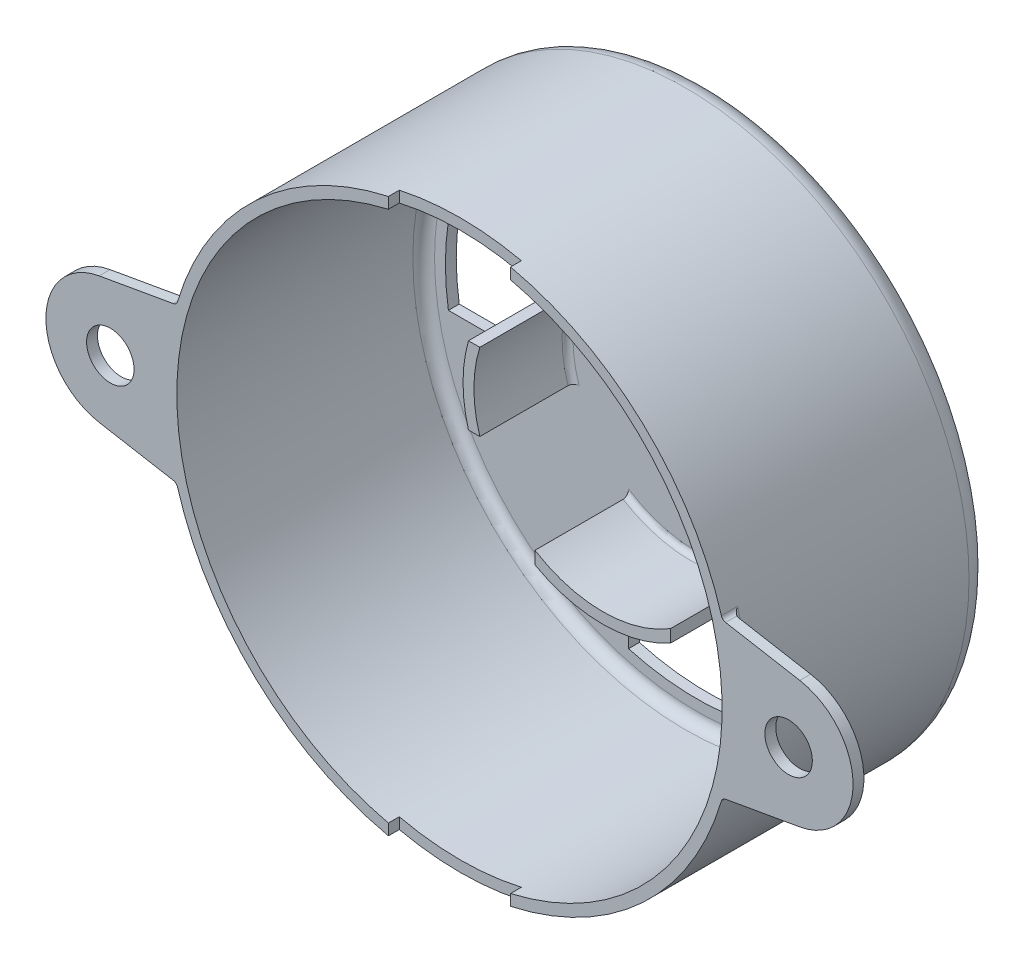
ISO-10303-21;
HEADER;
FILE_DESCRIPTION(('STEP AP214'),'2;1');
FILE_NAME('part.step','',(''),(''),'','','');
FILE_SCHEMA(('AUTOMOTIVE_DESIGN { 1 0 10303 214 1 1 1 1 }'));
ENDSEC;
DATA;
#1=APPLICATION_CONTEXT('core data for automotive mechanical design processes');
#2=APPLICATION_PROTOCOL_DEFINITION('international standard','automotive_design',2000,#1);
#3=PRODUCT_CONTEXT('',#1,'mechanical');
#4=PRODUCT('Part','Part','',(#3));
#5=PRODUCT_RELATED_PRODUCT_CATEGORY('part','',(#4));
#6=PRODUCT_DEFINITION_FORMATION('','',#4);
#7=PRODUCT_DEFINITION_CONTEXT('part definition',#1,'design');
#8=PRODUCT_DEFINITION('design','',#6,#7);
#9=PRODUCT_DEFINITION_SHAPE('','',#8);
#10=(LENGTH_UNIT() NAMED_UNIT(*) SI_UNIT(.MILLI.,.METRE.));
#11=(NAMED_UNIT(*) PLANE_ANGLE_UNIT() SI_UNIT($,.RADIAN.));
#12=(NAMED_UNIT(*) SI_UNIT($,.STERADIAN.) SOLID_ANGLE_UNIT());
#13=UNCERTAINTY_MEASURE_WITH_UNIT(LENGTH_MEASURE(1.E-05),#10,'distance_accuracy_value','');
#14=(GEOMETRIC_REPRESENTATION_CONTEXT(3) GLOBAL_UNCERTAINTY_ASSIGNED_CONTEXT((#13)) GLOBAL_UNIT_ASSIGNED_CONTEXT((#10,
#11,#12)) REPRESENTATION_CONTEXT('',''));
#15=CARTESIAN_POINT('',(0.,0.,0.));
#16=DIRECTION('',(0.,0.,1.));
#17=DIRECTION('',(1.,0.,0.));
#18=AXIS2_PLACEMENT_3D('',#15,#16,#17);
#19=CARTESIAN_POINT('',(4.36835391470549E-13,11.,0.));
#20=DIRECTION('',(0.,0.,1.));
#21=DIRECTION('',(1.,0.,0.));
#22=AXIS2_PLACEMENT_3D('',#19,#20,#21);
#23=PLANE('',#22);
#24=DIRECTION('',(0.,-1.,0.));
#25=VECTOR('',#24,1.);
#26=CARTESIAN_POINT('',(-4.50000000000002,11.,0.));
#27=LINE('',#26,#25);
#28=CARTESIAN_POINT('',(-4.5,31.4098015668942,0.));
#29=VERTEX_POINT('',#28);
#30=CARTESIAN_POINT('',(-4.5,30.5897932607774,0.));
#31=VERTEX_POINT('',#30);
#32=EDGE_CURVE('E1122',#29,#31,#27,.T.);
#33=ORIENTED_EDGE('',*,*,#32,.F.);
#34=CARTESIAN_POINT('',(4.36835391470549E-13,11.,0.));
#35=DIRECTION('',(0.,0.,1.));
#36=DIRECTION('',(1.,0.,0.));
#37=AXIS2_PLACEMENT_3D('',#34,#35,#36);
#38=CIRCLE('',#37,20.9);
#39=CARTESIAN_POINT('',(-20.043315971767,16.9224559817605,0.));
#40=VERTEX_POINT('',#39);
#41=EDGE_CURVE('E672',#29,#40,#38,.T.);
#42=ORIENTED_EDGE('',*,*,#41,.T.);
#43=CARTESIAN_POINT('',(-20.426920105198,17.0358044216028,0.));
#44=DIRECTION('',(0.,0.,1.));
#45=DIRECTION('',(1.,0.,0.));
#46=AXIS2_PLACEMENT_3D('',#43,#44,#45);
#47=CIRCLE('',#46,0.4);
#48=CARTESIAN_POINT('',(-20.3574608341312,16.6418813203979,0.));
#49=VERTEX_POINT('',#48);
#50=EDGE_CURVE('E1181',#40,#49,#47,.F.);
#51=ORIENTED_EDGE('',*,*,#50,.T.);
#52=DIRECTION('',(-0.984807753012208,-0.173648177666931,0.));
#53=VECTOR('',#52,1.);
#54=CARTESIAN_POINT('',(-25.8248288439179,15.6778368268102,0.));
#55=LINE('',#54,#53);
#56=CARTESIAN_POINT('',(-25.8248288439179,15.6778368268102,0.));
#57=VERTEX_POINT('',#56);
#58=EDGE_CURVE('E504',#49,#57,#55,.T.);
#59=ORIENTED_EDGE('',*,*,#58,.T.);
#60=CARTESIAN_POINT('',(-25.,11.0000000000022,0.));
#61=DIRECTION('',(0.,0.,1.));
#62=DIRECTION('',(1.,0.,0.));
#63=AXIS2_PLACEMENT_3D('',#60,#61,#62);
#64=CIRCLE('',#63,4.75);
#65=CARTESIAN_POINT('',(-25.8248288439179,6.3221631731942,0.));
#66=VERTEX_POINT('',#65);
#67=EDGE_CURVE('E497',#57,#66,#64,.T.);
#68=ORIENTED_EDGE('',*,*,#67,.T.);
#69=DIRECTION('',(0.984807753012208,-0.173648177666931,0.));
#70=VECTOR('',#69,1.);
#71=CARTESIAN_POINT('',(-25.8248288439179,6.3221631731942,0.));
#72=LINE('',#71,#70);
#73=CARTESIAN_POINT('',(-20.3574608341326,5.3581186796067,0.));
#74=VERTEX_POINT('',#73);
#75=EDGE_CURVE('E512',#66,#74,#72,.T.);
#76=ORIENTED_EDGE('',*,*,#75,.T.);
#77=CARTESIAN_POINT('',(-20.4269201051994,4.96419557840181,0.));
#78=DIRECTION('',(0.,0.,1.));
#79=DIRECTION('',(1.,0.,0.));
#80=AXIS2_PLACEMENT_3D('',#77,#78,#79);
#81=CIRCLE('',#80,0.4);
#82=CARTESIAN_POINT('',(-20.0433159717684,5.07754401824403,0.));
#83=VERTEX_POINT('',#82);
#84=EDGE_CURVE('E1147',#74,#83,#81,.F.);
#85=ORIENTED_EDGE('',*,*,#84,.T.);
#86=CARTESIAN_POINT('',(-4.49999999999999,-9.40980156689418,0.));
#87=VERTEX_POINT('',#86);
#88=EDGE_CURVE('E673',#83,#87,#38,.T.);
#89=ORIENTED_EDGE('',*,*,#88,.T.);
#90=DIRECTION('',(0.,-1.,0.));
#91=VECTOR('',#90,1.);
#92=CARTESIAN_POINT('',(-4.5,-8.58979326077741,0.));
#93=LINE('',#92,#91);
#94=CARTESIAN_POINT('',(-4.5,-8.58979326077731,0.));
#95=VERTEX_POINT('',#94);
#96=EDGE_CURVE('E449',#95,#87,#93,.T.);
#97=ORIENTED_EDGE('',*,*,#96,.F.);
#98=CARTESIAN_POINT('',(4.36835391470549E-13,11.,0.));
#99=DIRECTION('',(0.,0.,1.));
#100=DIRECTION('',(1.,0.,0.));
#101=AXIS2_PLACEMENT_3D('',#98,#99,#100);
#102=CIRCLE('',#101,20.1);
#103=EDGE_CURVE('E667',#31,#95,#102,.T.);
#104=ORIENTED_EDGE('',*,*,#103,.F.);
#105=EDGE_LOOP('',(#33,#42,#51,#59,#68,#76,#85,#89,#97,#104));
#106=FACE_BOUND('',#105,.T.);
#107=CARTESIAN_POINT('',(-25.,11.0000000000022,0.));
#108=DIRECTION('',(0.,0.,1.));
#109=DIRECTION('',(1.,0.,0.));
#110=AXIS2_PLACEMENT_3D('',#107,#108,#109);
#111=CIRCLE('',#110,1.74999999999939);
#112=CARTESIAN_POINT('',(-23.2500000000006,11.0000000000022,0.));
#113=VERTEX_POINT('',#112);
#114=EDGE_CURVE('E492',#113,#113,#111,.T.);
#115=ORIENTED_EDGE('',*,*,#114,.F.);
#116=EDGE_LOOP('',(#115));
#117=FACE_BOUND('',#116,.T.);
#118=ADVANCED_FACE('F40',(#106,#117),#23,.T.);
#119=CARTESIAN_POINT('',(4.36835391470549E-13,11.,-19.));
#120=DIRECTION('',(0.,0.,1.));
#121=DIRECTION('',(1.,0.,0.));
#122=AXIS2_PLACEMENT_3D('',#119,#120,#121);
#123=CYLINDRICAL_SURFACE('',#122,20.1);
#124=CARTESIAN_POINT('',(4.36835391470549E-13,11.,-17.4));
#125=DIRECTION('',(0.,0.,-1.));
#126=DIRECTION('',(-1.,0.,0.));
#127=AXIS2_PLACEMENT_3D('',#124,#125,#126);
#128=CIRCLE('',#127,20.1);
#129=CARTESIAN_POINT('',(-20.0999999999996,11.,-17.4));
#130=VERTEX_POINT('',#129);
#131=EDGE_CURVE('E683',#130,#130,#128,.T.);
#132=ORIENTED_EDGE('',*,*,#131,.T.);
#133=EDGE_LOOP('',(#132));
#134=FACE_BOUND('',#133,.T.);
#135=CARTESIAN_POINT('',(4.36835391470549E-13,11.,-0.8));
#136=DIRECTION('',(0.,0.,-1.));
#137=DIRECTION('',(1.,0.,0.));
#138=AXIS2_PLACEMENT_3D('',#135,#136,#137);
#139=CIRCLE('',#138,20.1);
#140=CARTESIAN_POINT('',(-4.5,30.5897932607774,-0.8));
#141=VERTEX_POINT('',#140);
#142=CARTESIAN_POINT('',(4.5,30.5897932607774,-0.8));
#143=VERTEX_POINT('',#142);
#144=EDGE_CURVE('E423',#141,#143,#139,.T.);
#145=ORIENTED_EDGE('',*,*,#144,.F.);
#146=DIRECTION('',(0.,0.,1.));
#147=VECTOR('',#146,1.);
#148=CARTESIAN_POINT('',(-4.5,30.5897932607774,-0.8));
#149=LINE('',#148,#147);
#150=EDGE_CURVE('E438',#141,#31,#149,.T.);
#151=ORIENTED_EDGE('',*,*,#150,.T.);
#152=ORIENTED_EDGE('',*,*,#103,.T.);
#153=DIRECTION('',(0.,0.,1.));
#154=VECTOR('',#153,1.);
#155=CARTESIAN_POINT('',(-4.5,-8.58979326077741,-0.8));
#156=LINE('',#155,#154);
#157=CARTESIAN_POINT('',(-4.5,-8.58979326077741,-0.8));
#158=VERTEX_POINT('',#157);
#159=EDGE_CURVE('E56',#158,#95,#156,.T.);
#160=ORIENTED_EDGE('',*,*,#159,.F.);
#161=CARTESIAN_POINT('',(4.36835391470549E-13,11.,-0.8));
#162=DIRECTION('',(0.,0.,-1.));
#163=DIRECTION('',(1.,0.,0.));
#164=AXIS2_PLACEMENT_3D('',#161,#162,#163);
#165=CIRCLE('',#164,20.1);
#166=CARTESIAN_POINT('',(4.50000000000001,-8.58979326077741,-0.8));
#167=VERTEX_POINT('',#166);
#168=EDGE_CURVE('E445',#167,#158,#165,.T.);
#169=ORIENTED_EDGE('',*,*,#168,.F.);
#170=DIRECTION('',(0.,0.,1.));
#171=VECTOR('',#170,1.);
#172=CARTESIAN_POINT('',(4.50000000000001,-8.58979326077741,-0.8));
#173=LINE('',#172,#171);
#174=CARTESIAN_POINT('',(4.50000000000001,-8.58979326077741,0.));
#175=VERTEX_POINT('',#174);
#176=EDGE_CURVE('E455',#167,#175,#173,.T.);
#177=ORIENTED_EDGE('',*,*,#176,.T.);
#178=CARTESIAN_POINT('',(4.5,30.5897932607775,0.));
#179=VERTEX_POINT('',#178);
#180=EDGE_CURVE('E437',#175,#179,#102,.T.);
#181=ORIENTED_EDGE('',*,*,#180,.T.);
#182=DIRECTION('',(0.,0.,1.));
#183=VECTOR('',#182,1.);
#184=CARTESIAN_POINT('',(4.5,30.5897932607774,-0.8));
#185=LINE('',#184,#183);
#186=EDGE_CURVE('E64',#143,#179,#185,.T.);
#187=ORIENTED_EDGE('',*,*,#186,.F.);
#188=EDGE_LOOP('',(#145,#151,#152,#160,#169,#177,#181,#187));
#189=FACE_BOUND('',#188,.T.);
#190=ADVANCED_FACE('F434',(#134,#189),#123,.F.);
#191=CARTESIAN_POINT('',(4.36835391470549E-13,11.,-19.));
#192=DIRECTION('',(0.,0.,1.));
#193=DIRECTION('',(1.,0.,0.));
#194=AXIS2_PLACEMENT_3D('',#191,#192,#193);
#195=CYLINDRICAL_SURFACE('',#194,20.9);
#196=DIRECTION('',(0.,0.,1.));
#197=VECTOR('',#196,1.);
#198=CARTESIAN_POINT('',(-4.5,31.4098015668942,-19.));
#199=LINE('',#198,#197);
#200=CARTESIAN_POINT('',(-4.5,31.4098015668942,-0.799999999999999));
#201=VERTEX_POINT('',#200);
#202=EDGE_CURVE('E462',#201,#29,#199,.T.);
#203=ORIENTED_EDGE('',*,*,#202,.F.);
#204=CARTESIAN_POINT('',(4.36835391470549E-13,11.,-0.799999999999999));
#205=DIRECTION('',(0.,0.,1.));
#206=DIRECTION('',(1.,0.,0.));
#207=AXIS2_PLACEMENT_3D('',#204,#205,#206);
#208=CIRCLE('',#207,20.9);
#209=CARTESIAN_POINT('',(4.5,31.4098015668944,-0.799999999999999));
#210=VERTEX_POINT('',#209);
#211=EDGE_CURVE('E12',#201,#210,#208,.F.);
#212=ORIENTED_EDGE('',*,*,#211,.T.);
#213=DIRECTION('',(0.,0.,1.));
#214=VECTOR('',#213,1.);
#215=CARTESIAN_POINT('',(4.5,31.4098015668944,-19.));
#216=LINE('',#215,#214);
#217=CARTESIAN_POINT('',(4.5,31.4098015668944,0.));
#218=VERTEX_POINT('',#217);
#219=EDGE_CURVE('E420',#218,#210,#216,.F.);
#220=ORIENTED_EDGE('',*,*,#219,.F.);
#221=CARTESIAN_POINT('',(20.043315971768,16.9224559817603,0.));
#222=VERTEX_POINT('',#221);
#223=EDGE_CURVE('E668',#222,#218,#38,.T.);
#224=ORIENTED_EDGE('',*,*,#223,.F.);
#225=DIRECTION('',(0.,0.,1.));
#226=VECTOR('',#225,1.);
#227=CARTESIAN_POINT('',(20.043315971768,16.9224559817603,-19.));
#228=LINE('',#227,#226);
#229=CARTESIAN_POINT('',(20.043315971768,16.9224559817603,-1.2));
#230=VERTEX_POINT('',#229);
#231=EDGE_CURVE('E1164',#222,#230,#228,.F.);
#232=ORIENTED_EDGE('',*,*,#231,.T.);
#233=CARTESIAN_POINT('',(4.36835391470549E-13,11.,-1.2));
#234=DIRECTION('',(0.,0.,1.));
#235=DIRECTION('',(1.,0.,0.));
#236=AXIS2_PLACEMENT_3D('',#233,#234,#235);
#237=CIRCLE('',#236,20.9);
#238=CARTESIAN_POINT('',(20.0433159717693,5.0775440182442,-1.2));
#239=VERTEX_POINT('',#238);
#240=EDGE_CURVE('E1157',#230,#239,#237,.F.);
#241=ORIENTED_EDGE('',*,*,#240,.T.);
#242=DIRECTION('',(0.,0.,1.));
#243=VECTOR('',#242,1.);
#244=CARTESIAN_POINT('',(20.0433159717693,5.0775440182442,-19.));
#245=LINE('',#244,#243);
#246=CARTESIAN_POINT('',(20.0433159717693,5.0775440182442,0.));
#247=VERTEX_POINT('',#246);
#248=EDGE_CURVE('E1166',#239,#247,#245,.T.);
#249=ORIENTED_EDGE('',*,*,#248,.T.);
#250=CARTESIAN_POINT('',(4.50000000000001,-9.40980156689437,0.));
#251=VERTEX_POINT('',#250);
#252=EDGE_CURVE('E671',#251,#247,#38,.T.);
#253=ORIENTED_EDGE('',*,*,#252,.F.);
#254=DIRECTION('',(0.,0.,1.));
#255=VECTOR('',#254,1.);
#256=CARTESIAN_POINT('',(4.50000000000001,-9.40980156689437,-19.));
#257=LINE('',#256,#255);
#258=CARTESIAN_POINT('',(4.50000000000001,-9.40980156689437,-0.799999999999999));
#259=VERTEX_POINT('',#258);
#260=EDGE_CURVE('E459',#259,#251,#257,.T.);
#261=ORIENTED_EDGE('',*,*,#260,.F.);
#262=CARTESIAN_POINT('',(4.36835391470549E-13,11.,-0.799999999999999));
#263=DIRECTION('',(0.,0.,1.));
#264=DIRECTION('',(1.,0.,0.));
#265=AXIS2_PLACEMENT_3D('',#262,#263,#264);
#266=CIRCLE('',#265,20.9);
#267=CARTESIAN_POINT('',(-4.49999999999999,-9.40980156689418,-0.799999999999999));
#268=VERTEX_POINT('',#267);
#269=EDGE_CURVE('E49',#259,#268,#266,.F.);
#270=ORIENTED_EDGE('',*,*,#269,.T.);
#271=DIRECTION('',(0.,0.,1.));
#272=VECTOR('',#271,1.);
#273=CARTESIAN_POINT('',(-4.49999999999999,-9.40980156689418,-19.));
#274=LINE('',#273,#272);
#275=EDGE_CURVE('E440',#87,#268,#274,.F.);
#276=ORIENTED_EDGE('',*,*,#275,.F.);
#277=ORIENTED_EDGE('',*,*,#88,.F.);
#278=DIRECTION('',(0.,0.,1.));
#279=VECTOR('',#278,1.);
#280=CARTESIAN_POINT('',(-20.0433159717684,5.07754401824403,-19.));
#281=LINE('',#280,#279);
#282=CARTESIAN_POINT('',(-20.0433159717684,5.07754401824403,-1.2));
#283=VERTEX_POINT('',#282);
#284=EDGE_CURVE('E1149',#83,#283,#281,.F.);
#285=ORIENTED_EDGE('',*,*,#284,.T.);
#286=CARTESIAN_POINT('',(4.36835391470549E-13,11.,-1.2));
#287=DIRECTION('',(0.,0.,1.));
#288=DIRECTION('',(1.,0.,0.));
#289=AXIS2_PLACEMENT_3D('',#286,#287,#288);
#290=CIRCLE('',#289,20.9);
#291=CARTESIAN_POINT('',(-20.043315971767,16.9224559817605,-1.2));
#292=VERTEX_POINT('',#291);
#293=EDGE_CURVE('E1154',#283,#292,#290,.F.);
#294=ORIENTED_EDGE('',*,*,#293,.T.);
#295=DIRECTION('',(0.,0.,1.));
#296=VECTOR('',#295,1.);
#297=CARTESIAN_POINT('',(-20.043315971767,16.9224559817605,-19.));
#298=LINE('',#297,#296);
#299=EDGE_CURVE('E1153',#292,#40,#298,.T.);
#300=ORIENTED_EDGE('',*,*,#299,.T.);
#301=ORIENTED_EDGE('',*,*,#41,.F.);
#302=EDGE_LOOP('',(#203,#212,#220,#224,#232,#241,#249,#253,#261,#270,#276,#277,#285,#294,#300,#301));
#303=FACE_BOUND('',#302,.T.);
#304=CARTESIAN_POINT('',(4.36835391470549E-13,11.,-17.4));
#305=DIRECTION('',(0.,0.,1.));
#306=DIRECTION('',(1.,0.,0.));
#307=AXIS2_PLACEMENT_3D('',#304,#305,#306);
#308=CIRCLE('',#307,20.9);
#309=CARTESIAN_POINT('',(20.9000000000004,11.,-17.4));
#310=VERTEX_POINT('',#309);
#311=EDGE_CURVE('E674',#310,#310,#308,.T.);
#312=ORIENTED_EDGE('',*,*,#311,.T.);
#313=EDGE_LOOP('',(#312));
#314=FACE_BOUND('',#313,.T.);
#315=ADVANCED_FACE('F1026',(#303,#314),#195,.T.);
#316=CARTESIAN_POINT('',(4.36835391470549E-13,11.,-19.));
#317=DIRECTION('',(0.,0.,1.));
#318=DIRECTION('',(1.,0.,0.));
#319=AXIS2_PLACEMENT_3D('',#316,#317,#318);
#320=PLANE('',#319);
#321=CARTESIAN_POINT('',(-10.6066017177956,21.6066017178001,-19.));
#322=DIRECTION('',(0.,0.,-1.));
#323=DIRECTION('',(-1.,0.,0.));
#324=AXIS2_PLACEMENT_3D('',#321,#322,#323);
#325=CIRCLE('',#324,2.00000000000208);
#326=CARTESIAN_POINT('',(-12.6066017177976,21.6066017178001,-19.));
#327=VERTEX_POINT('',#326);
#328=EDGE_CURVE('E521',#327,#327,#325,.T.);
#329=ORIENTED_EDGE('',*,*,#328,.F.);
#330=EDGE_LOOP('',(#329));
#331=FACE_BOUND('',#330,.T.);
#332=CARTESIAN_POINT('',(10.606601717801,0.393398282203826,-19.));
#333=DIRECTION('',(0.,0.,-1.));
#334=DIRECTION('',(-1.,0.,0.));
#335=AXIS2_PLACEMENT_3D('',#332,#333,#334);
#336=CIRCLE('',#335,1.25000000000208);
#337=CARTESIAN_POINT('',(9.3566017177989,0.393398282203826,-19.));
#338=VERTEX_POINT('',#337);
#339=EDGE_CURVE('E519',#338,#338,#336,.T.);
#340=ORIENTED_EDGE('',*,*,#339,.F.);
#341=EDGE_LOOP('',(#340));
#342=FACE_BOUND('',#341,.T.);
#343=CARTESIAN_POINT('',(11.1369318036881,22.1369318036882,-19.));
#344=DIRECTION('',(0.,0.,-1.));
#345=DIRECTION('',(-1.,0.,0.));
#346=AXIS2_PLACEMENT_3D('',#343,#344,#345);
#347=CIRCLE('',#346,2.75);
#348=CARTESIAN_POINT('',(13.0814754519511,24.0814754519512,-19.));
#349=VERTEX_POINT('',#348);
#350=CARTESIAN_POINT('',(9.19238815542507,20.1923881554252,-19.));
#351=VERTEX_POINT('',#350);
#352=EDGE_CURVE('E527',#349,#351,#347,.T.);
#353=ORIENTED_EDGE('',*,*,#352,.F.);
#354=CARTESIAN_POINT('',(0.,11.,-19.));
#355=DIRECTION('',(0.,0.,-1.));
#356=DIRECTION('',(1.,0.,0.));
#357=AXIS2_PLACEMENT_3D('',#354,#355,#356);
#358=CIRCLE('',#357,18.5);
#359=CARTESIAN_POINT('',(-5.,28.8115131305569,-19.));
#360=VERTEX_POINT('',#359);
#361=EDGE_CURVE('E621',#360,#349,#358,.T.);
#362=ORIENTED_EDGE('',*,*,#361,.F.);
#363=DIRECTION('',(0.,1.,0.));
#364=VECTOR('',#363,1.);
#365=CARTESIAN_POINT('',(-5.,19.0777472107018,-19.));
#366=LINE('',#365,#364);
#367=CARTESIAN_POINT('',(-5.,18.6032887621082,-19.));
#368=VERTEX_POINT('',#367);
#369=EDGE_CURVE('E662',#368,#360,#366,.T.);
#370=ORIENTED_EDGE('',*,*,#369,.F.);
#371=CARTESIAN_POINT('',(0.,11.0000000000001,-19.));
#372=DIRECTION('',(0.,0.,1.));
#373=DIRECTION('',(1.,0.,0.));
#374=AXIS2_PLACEMENT_3D('',#371,#372,#373);
#375=CIRCLE('',#374,9.09999999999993);
#376=CARTESIAN_POINT('',(5.,18.6032887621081,-19.));
#377=VERTEX_POINT('',#376);
#378=EDGE_CURVE('E1886',#368,#377,#375,.F.);
#379=ORIENTED_EDGE('',*,*,#378,.T.);
#380=DIRECTION('',(0.,-1.,0.));
#381=VECTOR('',#380,1.);
#382=CARTESIAN_POINT('',(5.,28.8115131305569,-19.));
#383=LINE('',#382,#381);
#384=CARTESIAN_POINT('',(5.,23.,-19.));
#385=VERTEX_POINT('',#384);
#386=EDGE_CURVE('E660',#385,#377,#383,.T.);
#387=ORIENTED_EDGE('',*,*,#386,.F.);
#388=CARTESIAN_POINT('',(0.,11.,-19.));
#389=DIRECTION('',(0.,0.,1.));
#390=DIRECTION('',(-1.,0.,0.));
#391=AXIS2_PLACEMENT_3D('',#388,#389,#390);
#392=CIRCLE('',#391,13.);
#393=EDGE_CURVE('E530',#351,#385,#392,.T.);
#394=ORIENTED_EDGE('',*,*,#393,.F.);
#395=EDGE_LOOP('',(#353,#362,#370,#379,#387,#394));
#396=FACE_BOUND('',#395,.T.);
#397=CARTESIAN_POINT('',(0.,11.0000000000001,-19.));
#398=DIRECTION('',(0.,0.,1.));
#399=DIRECTION('',(1.,0.,0.));
#400=AXIS2_PLACEMENT_3D('',#397,#398,#399);
#401=CIRCLE('',#400,9.09999999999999);
#402=CARTESIAN_POINT('',(8.64219300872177,13.85,-19.));
#403=VERTEX_POINT('',#402);
#404=CARTESIAN_POINT('',(8.64219300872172,8.15,-19.));
#405=VERTEX_POINT('',#404);
#406=EDGE_CURVE('E1882',#403,#405,#401,.F.);
#407=ORIENTED_EDGE('',*,*,#406,.T.);
#408=DIRECTION('',(-1.,0.,0.));
#409=VECTOR('',#408,1.);
#410=CARTESIAN_POINT('',(9.06242241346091,8.15,-19.));
#411=LINE('',#410,#409);
#412=CARTESIAN_POINT('',(18.2791547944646,8.15,-19.));
#413=VERTEX_POINT('',#412);
#414=EDGE_CURVE('E624',#413,#405,#411,.T.);
#415=ORIENTED_EDGE('',*,*,#414,.F.);
#416=CARTESIAN_POINT('',(0.,11.0000000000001,-19.));
#417=DIRECTION('',(0.,0.,-1.));
#418=DIRECTION('',(-1.,0.,0.));
#419=AXIS2_PLACEMENT_3D('',#416,#417,#418);
#420=CIRCLE('',#419,18.5);
#421=CARTESIAN_POINT('',(18.2791547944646,13.85,-19.));
#422=VERTEX_POINT('',#421);
#423=EDGE_CURVE('E622',#422,#413,#420,.T.);
#424=ORIENTED_EDGE('',*,*,#423,.F.);
#425=DIRECTION('',(1.,0.,0.));
#426=VECTOR('',#425,1.);
#427=CARTESIAN_POINT('',(18.2791547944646,13.85,-19.));
#428=LINE('',#427,#426);
#429=EDGE_CURVE('E627',#403,#422,#428,.T.);
#430=ORIENTED_EDGE('',*,*,#429,.F.);
#431=EDGE_LOOP('',(#407,#415,#424,#430));
#432=FACE_BOUND('',#431,.T.);
#433=CARTESIAN_POINT('',(0.,11.,-19.));
#434=DIRECTION('',(0.,0.,1.));
#435=DIRECTION('',(1.,0.,0.));
#436=AXIS2_PLACEMENT_3D('',#433,#434,#435);
#437=CIRCLE('',#436,9.1);
#438=CARTESIAN_POINT('',(5.,3.39671123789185,-19.));
#439=VERTEX_POINT('',#438);
#440=CARTESIAN_POINT('',(-5.00000000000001,3.39671123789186,-19.));
#441=VERTEX_POINT('',#440);
#442=EDGE_CURVE('E1856',#439,#441,#437,.F.);
#443=ORIENTED_EDGE('',*,*,#442,.T.);
#444=DIRECTION('',(0.,1.,0.));
#445=VECTOR('',#444,1.);
#446=CARTESIAN_POINT('',(-5.00000000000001,-6.81151313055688,-19.));
#447=LINE('',#446,#445);
#448=CARTESIAN_POINT('',(-5.00000000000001,-6.81151313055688,-19.));
#449=VERTEX_POINT('',#448);
#450=EDGE_CURVE('E641',#449,#441,#447,.T.);
#451=ORIENTED_EDGE('',*,*,#450,.F.);
#452=CARTESIAN_POINT('',(0.,11.,-19.));
#453=DIRECTION('',(0.,0.,-1.));
#454=DIRECTION('',(-1.,0.,0.));
#455=AXIS2_PLACEMENT_3D('',#452,#453,#454);
#456=CIRCLE('',#455,18.5);
#457=CARTESIAN_POINT('',(5.,-6.81151313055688,-19.));
#458=VERTEX_POINT('',#457);
#459=EDGE_CURVE('E637',#458,#449,#456,.T.);
#460=ORIENTED_EDGE('',*,*,#459,.F.);
#461=DIRECTION('',(0.,-1.,0.));
#462=VECTOR('',#461,1.);
#463=CARTESIAN_POINT('',(5.,2.92225278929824,-19.));
#464=LINE('',#463,#462);
#465=EDGE_CURVE('E635',#439,#458,#464,.T.);
#466=ORIENTED_EDGE('',*,*,#465,.F.);
#467=EDGE_LOOP('',(#443,#451,#460,#466));
#468=FACE_BOUND('',#467,.T.);
#469=CARTESIAN_POINT('',(0.,11.0000000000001,-19.));
#470=DIRECTION('',(0.,0.,1.));
#471=DIRECTION('',(1.,0.,0.));
#472=AXIS2_PLACEMENT_3D('',#469,#470,#471);
#473=CIRCLE('',#472,9.09999999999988);
#474=CARTESIAN_POINT('',(-8.6421930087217,8.15,-19.));
#475=VERTEX_POINT('',#474);
#476=CARTESIAN_POINT('',(-8.64219300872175,13.85,-19.));
#477=VERTEX_POINT('',#476);
#478=EDGE_CURVE('E1888',#475,#477,#473,.F.);
#479=ORIENTED_EDGE('',*,*,#478,.T.);
#480=DIRECTION('',(1.,0.,0.));
#481=VECTOR('',#480,1.);
#482=CARTESIAN_POINT('',(-18.2791547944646,13.85,-19.));
#483=LINE('',#482,#481);
#484=CARTESIAN_POINT('',(-18.2791547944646,13.85,-19.));
#485=VERTEX_POINT('',#484);
#486=EDGE_CURVE('E653',#485,#477,#483,.T.);
#487=ORIENTED_EDGE('',*,*,#486,.F.);
#488=CARTESIAN_POINT('',(0.,11.0000000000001,-19.));
#489=DIRECTION('',(0.,0.,-1.));
#490=DIRECTION('',(-1.,0.,0.));
#491=AXIS2_PLACEMENT_3D('',#488,#489,#490);
#492=CIRCLE('',#491,18.4999999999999);
#493=CARTESIAN_POINT('',(-18.2791547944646,8.14999999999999,-19.));
#494=VERTEX_POINT('',#493);
#495=EDGE_CURVE('E649',#494,#485,#492,.T.);
#496=ORIENTED_EDGE('',*,*,#495,.F.);
#497=DIRECTION('',(-1.,0.,0.));
#498=VECTOR('',#497,1.);
#499=CARTESIAN_POINT('',(-9.0624224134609,8.15,-19.));
#500=LINE('',#499,#498);
#501=EDGE_CURVE('E647',#475,#494,#500,.T.);
#502=ORIENTED_EDGE('',*,*,#501,.F.);
#503=EDGE_LOOP('',(#479,#487,#496,#502));
#504=FACE_BOUND('',#503,.T.);
#505=CARTESIAN_POINT('',(4.36835391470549E-13,11.,-19.));
#506=DIRECTION('',(0.,0.,1.));
#507=DIRECTION('',(1.,0.,0.));
#508=AXIS2_PLACEMENT_3D('',#505,#506,#507);
#509=CIRCLE('',#508,19.3);
#510=CARTESIAN_POINT('',(19.3000000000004,11.,-19.));
#511=VERTEX_POINT('',#510);
#512=EDGE_CURVE('E677',#511,#511,#509,.F.);
#513=ORIENTED_EDGE('',*,*,#512,.T.);
#514=EDGE_LOOP('',(#513));
#515=FACE_BOUND('',#514,.T.);
#516=ADVANCED_FACE('F1035',(#331,#342,#396,#432,#468,#504,#515),#320,.F.);
#517=DIRECTION('',(0.,1.,0.));
#518=VECTOR('',#517,1.);
#519=CARTESIAN_POINT('',(4.5,31.6401459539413,0.));
#520=LINE('',#519,#518);
#521=EDGE_CURVE('E431',#179,#218,#520,.T.);
#522=ORIENTED_EDGE('',*,*,#521,.F.);
#523=ORIENTED_EDGE('',*,*,#180,.F.);
#524=DIRECTION('',(0.,1.,0.));
#525=VECTOR('',#524,1.);
#526=CARTESIAN_POINT('',(4.50000000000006,11.,0.));
#527=LINE('',#526,#525);
#528=EDGE_CURVE('E1120',#251,#175,#527,.T.);
#529=ORIENTED_EDGE('',*,*,#528,.F.);
#530=ORIENTED_EDGE('',*,*,#252,.T.);
#531=CARTESIAN_POINT('',(20.4269201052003,4.96419557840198,0.));
#532=DIRECTION('',(0.,0.,1.));
#533=DIRECTION('',(1.,0.,0.));
#534=AXIS2_PLACEMENT_3D('',#531,#532,#533);
#535=CIRCLE('',#534,0.4);
#536=CARTESIAN_POINT('',(20.3574608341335,5.35811867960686,0.));
#537=VERTEX_POINT('',#536);
#538=EDGE_CURVE('E1183',#247,#537,#535,.F.);
#539=ORIENTED_EDGE('',*,*,#538,.T.);
#540=DIRECTION('',(0.984807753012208,0.173648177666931,0.));
#541=VECTOR('',#540,1.);
#542=CARTESIAN_POINT('',(25.8248288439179,6.3221631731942,0.));
#543=LINE('',#542,#541);
#544=CARTESIAN_POINT('',(25.8248288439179,6.3221631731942,0.));
#545=VERTEX_POINT('',#544);
#546=EDGE_CURVE('E477',#537,#545,#543,.T.);
#547=ORIENTED_EDGE('',*,*,#546,.T.);
#548=CARTESIAN_POINT('',(25.,11.0000000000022,0.));
#549=DIRECTION('',(0.,0.,1.));
#550=DIRECTION('',(1.,0.,0.));
#551=AXIS2_PLACEMENT_3D('',#548,#549,#550);
#552=CIRCLE('',#551,4.75);
#553=CARTESIAN_POINT('',(25.8248288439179,15.6778368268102,0.));
#554=VERTEX_POINT('',#553);
#555=EDGE_CURVE('E468',#545,#554,#552,.T.);
#556=ORIENTED_EDGE('',*,*,#555,.T.);
#557=DIRECTION('',(-0.984807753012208,0.173648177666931,0.));
#558=VECTOR('',#557,1.);
#559=CARTESIAN_POINT('',(25.8248288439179,15.6778368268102,0.));
#560=LINE('',#559,#558);
#561=CARTESIAN_POINT('',(20.3574608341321,16.6418813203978,0.));
#562=VERTEX_POINT('',#561);
#563=EDGE_CURVE('E485',#554,#562,#560,.T.);
#564=ORIENTED_EDGE('',*,*,#563,.T.);
#565=CARTESIAN_POINT('',(20.4269201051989,17.0358044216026,0.));
#566=DIRECTION('',(0.,0.,1.));
#567=DIRECTION('',(1.,0.,0.));
#568=AXIS2_PLACEMENT_3D('',#565,#566,#567);
#569=CIRCLE('',#568,0.4);
#570=EDGE_CURVE('E1087',#562,#222,#569,.F.);
#571=ORIENTED_EDGE('',*,*,#570,.T.);
#572=ORIENTED_EDGE('',*,*,#223,.T.);
#573=EDGE_LOOP('',(#522,#523,#529,#530,#539,#547,#556,#564,#571,#572));
#574=FACE_BOUND('',#573,.T.);
#575=CARTESIAN_POINT('',(25.,11.0000000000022,0.));
#576=DIRECTION('',(0.,0.,1.));
#577=DIRECTION('',(1.,0.,0.));
#578=AXIS2_PLACEMENT_3D('',#575,#576,#577);
#579=CIRCLE('',#578,1.74999999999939);
#580=CARTESIAN_POINT('',(26.7499999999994,11.0000000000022,0.));
#581=VERTEX_POINT('',#580);
#582=EDGE_CURVE('E469',#581,#581,#579,.T.);
#583=ORIENTED_EDGE('',*,*,#582,.F.);
#584=EDGE_LOOP('',(#583));
#585=FACE_BOUND('',#584,.T.);
#586=ADVANCED_FACE('F1022',(#574,#585),#23,.T.);
#587=CARTESIAN_POINT('',(4.36835391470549E-13,11.,-18.2));
#588=DIRECTION('',(0.,0.,-1.));
#589=DIRECTION('',(-1.,0.,0.));
#590=AXIS2_PLACEMENT_3D('',#587,#588,#589);
#591=PLANE('',#590);
#592=CARTESIAN_POINT('',(-10.6066017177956,21.6066017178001,-18.2));
#593=DIRECTION('',(0.,0.,-1.));
#594=DIRECTION('',(-1.,0.,0.));
#595=AXIS2_PLACEMENT_3D('',#592,#593,#594);
#596=CIRCLE('',#595,2.00000000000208);
#597=CARTESIAN_POINT('',(-12.6066017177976,21.6066017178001,-18.2));
#598=VERTEX_POINT('',#597);
#599=EDGE_CURVE('E531',#598,#598,#596,.T.);
#600=ORIENTED_EDGE('',*,*,#599,.T.);
#601=EDGE_LOOP('',(#600));
#602=FACE_BOUND('',#601,.T.);
#603=CARTESIAN_POINT('',(10.606601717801,0.393398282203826,-18.2));
#604=DIRECTION('',(0.,0.,-1.));
#605=DIRECTION('',(-1.,0.,0.));
#606=AXIS2_PLACEMENT_3D('',#603,#604,#605);
#607=CIRCLE('',#606,1.25000000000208);
#608=CARTESIAN_POINT('',(9.3566017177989,0.393398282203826,-18.2));
#609=VERTEX_POINT('',#608);
#610=EDGE_CURVE('E524',#609,#609,#607,.T.);
#611=ORIENTED_EDGE('',*,*,#610,.T.);
#612=EDGE_LOOP('',(#611));
#613=FACE_BOUND('',#612,.T.);
#614=CARTESIAN_POINT('',(0.,11.,-18.2));
#615=DIRECTION('',(0.,0.,-1.));
#616=DIRECTION('',(-1.,0.,0.));
#617=AXIS2_PLACEMENT_3D('',#614,#615,#616);
#618=CIRCLE('',#617,18.5);
#619=CARTESIAN_POINT('',(-5.,28.8115131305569,-18.2));
#620=VERTEX_POINT('',#619);
#621=CARTESIAN_POINT('',(13.0814754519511,24.0814754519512,-18.2));
#622=VERTEX_POINT('',#621);
#623=EDGE_CURVE('E693',#620,#622,#618,.T.);
#624=ORIENTED_EDGE('',*,*,#623,.T.);
#625=CARTESIAN_POINT('',(11.1369318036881,22.1369318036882,-18.2));
#626=DIRECTION('',(0.,0.,-1.));
#627=DIRECTION('',(-1.,0.,0.));
#628=AXIS2_PLACEMENT_3D('',#625,#626,#627);
#629=CIRCLE('',#628,2.75);
#630=CARTESIAN_POINT('',(9.19238815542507,20.1923881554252,-18.2));
#631=VERTEX_POINT('',#630);
#632=EDGE_CURVE('E1159',#622,#631,#629,.T.);
#633=ORIENTED_EDGE('',*,*,#632,.T.);
#634=CARTESIAN_POINT('',(0.,11.,-18.2));
#635=DIRECTION('',(0.,0.,-1.));
#636=DIRECTION('',(-1.,0.,0.));
#637=AXIS2_PLACEMENT_3D('',#634,#635,#636);
#638=CIRCLE('',#637,13.);
#639=CARTESIAN_POINT('',(5.,23.,-18.2));
#640=VERTEX_POINT('',#639);
#641=EDGE_CURVE('E536',#631,#640,#638,.F.);
#642=ORIENTED_EDGE('',*,*,#641,.T.);
#643=DIRECTION('',(0.,-1.,0.));
#644=VECTOR('',#643,1.);
#645=CARTESIAN_POINT('',(4.99999999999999,11.,-18.2));
#646=LINE('',#645,#644);
#647=CARTESIAN_POINT('',(5.,19.9264186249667,-18.2));
#648=VERTEX_POINT('',#647);
#649=EDGE_CURVE('E687',#640,#648,#646,.T.);
#650=ORIENTED_EDGE('',*,*,#649,.T.);
#651=CARTESIAN_POINT('',(5.,18.6032887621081,-18.2));
#652=VERTEX_POINT('',#651);
#653=EDGE_CURVE('E686',#648,#652,#646,.T.);
#654=ORIENTED_EDGE('',*,*,#653,.T.);
#655=CARTESIAN_POINT('',(0.,11.0000000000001,-18.2));
#656=DIRECTION('',(0.,0.,-1.));
#657=DIRECTION('',(-1.,0.,0.));
#658=AXIS2_PLACEMENT_3D('',#655,#656,#657);
#659=CIRCLE('',#658,9.09999999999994);
#660=CARTESIAN_POINT('',(-5.,18.6032887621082,-18.2));
#661=VERTEX_POINT('',#660);
#662=EDGE_CURVE('E725',#652,#661,#659,.F.);
#663=ORIENTED_EDGE('',*,*,#662,.T.);
#664=DIRECTION('',(0.,1.,0.));
#665=VECTOR('',#664,1.);
#666=CARTESIAN_POINT('',(-5.,11.,-18.2));
#667=LINE('',#666,#665);
#668=CARTESIAN_POINT('',(-5.,19.9264186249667,-18.2));
#669=VERTEX_POINT('',#668);
#670=EDGE_CURVE('E690',#661,#669,#667,.T.);
#671=ORIENTED_EDGE('',*,*,#670,.T.);
#672=EDGE_CURVE('E689',#669,#620,#667,.T.);
#673=ORIENTED_EDGE('',*,*,#672,.T.);
#674=EDGE_LOOP('',(#624,#633,#642,#650,#654,#663,#671,#673));
#675=FACE_BOUND('',#674,.T.);
#676=CARTESIAN_POINT('',(0.,11.0000000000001,-18.2));
#677=DIRECTION('',(0.,0.,-1.));
#678=DIRECTION('',(-1.,0.,0.));
#679=AXIS2_PLACEMENT_3D('',#676,#677,#678);
#680=CIRCLE('',#679,9.09999999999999);
#681=CARTESIAN_POINT('',(8.64219300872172,8.15,-18.2));
#682=VERTEX_POINT('',#681);
#683=CARTESIAN_POINT('',(8.64219300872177,13.85,-18.2));
#684=VERTEX_POINT('',#683);
#685=EDGE_CURVE('E728',#682,#684,#680,.F.);
#686=ORIENTED_EDGE('',*,*,#685,.T.);
#687=DIRECTION('',(1.,0.,0.));
#688=VECTOR('',#687,1.);
#689=CARTESIAN_POINT('',(4.37371803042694E-13,13.85,-18.2));
#690=LINE('',#689,#688);
#691=CARTESIAN_POINT('',(9.826415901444,13.85,-18.2));
#692=VERTEX_POINT('',#691);
#693=EDGE_CURVE('E719',#684,#692,#690,.T.);
#694=ORIENTED_EDGE('',*,*,#693,.T.);
#695=CARTESIAN_POINT('',(18.2791547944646,13.85,-18.2));
#696=VERTEX_POINT('',#695);
#697=EDGE_CURVE('E718',#692,#696,#690,.T.);
#698=ORIENTED_EDGE('',*,*,#697,.T.);
#699=CARTESIAN_POINT('',(0.,11.0000000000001,-18.2));
#700=DIRECTION('',(0.,0.,-1.));
#701=DIRECTION('',(-1.,0.,0.));
#702=AXIS2_PLACEMENT_3D('',#699,#700,#701);
#703=CIRCLE('',#702,18.5);
#704=CARTESIAN_POINT('',(18.2791547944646,8.15,-18.2));
#705=VERTEX_POINT('',#704);
#706=EDGE_CURVE('E722',#696,#705,#703,.T.);
#707=ORIENTED_EDGE('',*,*,#706,.T.);
#708=DIRECTION('',(-1.,0.,0.));
#709=VECTOR('',#708,1.);
#710=CARTESIAN_POINT('',(4.36298979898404E-13,8.15,-18.2));
#711=LINE('',#710,#709);
#712=CARTESIAN_POINT('',(9.82641590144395,8.15,-18.2));
#713=VERTEX_POINT('',#712);
#714=EDGE_CURVE('E716',#705,#713,#711,.T.);
#715=ORIENTED_EDGE('',*,*,#714,.T.);
#716=EDGE_CURVE('E715',#713,#682,#711,.T.);
#717=ORIENTED_EDGE('',*,*,#716,.T.);
#718=EDGE_LOOP('',(#686,#694,#698,#707,#715,#717));
#719=FACE_BOUND('',#718,.T.);
#720=CARTESIAN_POINT('',(0.,11.,-18.2));
#721=DIRECTION('',(0.,0.,-1.));
#722=DIRECTION('',(-1.,0.,0.));
#723=AXIS2_PLACEMENT_3D('',#720,#721,#722);
#724=CIRCLE('',#723,9.1);
#725=CARTESIAN_POINT('',(-5.00000000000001,3.39671123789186,-18.2));
#726=VERTEX_POINT('',#725);
#727=CARTESIAN_POINT('',(5.,3.39671123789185,-18.2));
#728=VERTEX_POINT('',#727);
#729=EDGE_CURVE('E731',#726,#728,#724,.F.);
#730=ORIENTED_EDGE('',*,*,#729,.T.);
#731=DIRECTION('',(0.,-1.,0.));
#732=VECTOR('',#731,1.);
#733=CARTESIAN_POINT('',(5.,11.,-18.2));
#734=LINE('',#733,#732);
#735=CARTESIAN_POINT('',(5.,2.0735813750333,-18.2));
#736=VERTEX_POINT('',#735);
#737=EDGE_CURVE('E706',#728,#736,#734,.T.);
#738=ORIENTED_EDGE('',*,*,#737,.T.);
#739=CARTESIAN_POINT('',(5.,-6.81151313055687,-18.2));
#740=VERTEX_POINT('',#739);
#741=EDGE_CURVE('E705',#736,#740,#734,.T.);
#742=ORIENTED_EDGE('',*,*,#741,.T.);
#743=CARTESIAN_POINT('',(0.,11.,-18.2));
#744=DIRECTION('',(0.,0.,-1.));
#745=DIRECTION('',(-1.,0.,0.));
#746=AXIS2_PLACEMENT_3D('',#743,#744,#745);
#747=CIRCLE('',#746,18.5);
#748=CARTESIAN_POINT('',(-5.00000000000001,-6.81151313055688,-18.2));
#749=VERTEX_POINT('',#748);
#750=EDGE_CURVE('E709',#740,#749,#747,.T.);
#751=ORIENTED_EDGE('',*,*,#750,.T.);
#752=DIRECTION('',(0.,1.,0.));
#753=VECTOR('',#752,1.);
#754=CARTESIAN_POINT('',(-5.,11.,-18.2));
#755=LINE('',#754,#753);
#756=CARTESIAN_POINT('',(-5.00000000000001,2.07358137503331,-18.2));
#757=VERTEX_POINT('',#756);
#758=EDGE_CURVE('E713',#749,#757,#755,.T.);
#759=ORIENTED_EDGE('',*,*,#758,.T.);
#760=EDGE_CURVE('E712',#757,#726,#755,.T.);
#761=ORIENTED_EDGE('',*,*,#760,.T.);
#762=EDGE_LOOP('',(#730,#738,#742,#751,#759,#761));
#763=FACE_BOUND('',#762,.T.);
#764=CARTESIAN_POINT('',(0.,11.0000000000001,-18.2));
#765=DIRECTION('',(0.,0.,-1.));
#766=DIRECTION('',(-1.,0.,0.));
#767=AXIS2_PLACEMENT_3D('',#764,#765,#766);
#768=CIRCLE('',#767,9.09999999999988);
#769=CARTESIAN_POINT('',(-8.64219300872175,13.85,-18.2));
#770=VERTEX_POINT('',#769);
#771=CARTESIAN_POINT('',(-8.6421930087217,8.15,-18.2));
#772=VERTEX_POINT('',#771);
#773=EDGE_CURVE('E734',#770,#772,#768,.F.);
#774=ORIENTED_EDGE('',*,*,#773,.T.);
#775=DIRECTION('',(-1.,0.,0.));
#776=VECTOR('',#775,1.);
#777=CARTESIAN_POINT('',(4.38981037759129E-13,8.15000000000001,-18.2));
#778=LINE('',#777,#776);
#779=CARTESIAN_POINT('',(-9.82641590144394,8.15,-18.2));
#780=VERTEX_POINT('',#779);
#781=EDGE_CURVE('E696',#772,#780,#778,.T.);
#782=ORIENTED_EDGE('',*,*,#781,.T.);
#783=CARTESIAN_POINT('',(-18.2791547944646,8.14999999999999,-18.2));
#784=VERTEX_POINT('',#783);
#785=EDGE_CURVE('E695',#780,#784,#778,.T.);
#786=ORIENTED_EDGE('',*,*,#785,.T.);
#787=CARTESIAN_POINT('',(0.,11.0000000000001,-18.2));
#788=DIRECTION('',(0.,0.,-1.));
#789=DIRECTION('',(-1.,0.,0.));
#790=AXIS2_PLACEMENT_3D('',#787,#788,#789);
#791=CIRCLE('',#790,18.4999999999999);
#792=CARTESIAN_POINT('',(-18.2791547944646,13.85,-18.2));
#793=VERTEX_POINT('',#792);
#794=EDGE_CURVE('E699',#784,#793,#791,.T.);
#795=ORIENTED_EDGE('',*,*,#794,.T.);
#796=DIRECTION('',(1.,0.,0.));
#797=VECTOR('',#796,1.);
#798=CARTESIAN_POINT('',(4.37908214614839E-13,13.85,-18.2));
#799=LINE('',#798,#797);
#800=CARTESIAN_POINT('',(-9.82641590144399,13.85,-18.2));
#801=VERTEX_POINT('',#800);
#802=EDGE_CURVE('E703',#793,#801,#799,.T.);
#803=ORIENTED_EDGE('',*,*,#802,.T.);
#804=EDGE_CURVE('E702',#801,#770,#799,.T.);
#805=ORIENTED_EDGE('',*,*,#804,.T.);
#806=EDGE_LOOP('',(#774,#782,#786,#795,#803,#805));
#807=FACE_BOUND('',#806,.T.);
#808=CARTESIAN_POINT('',(4.36835391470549E-13,11.,-18.2));
#809=DIRECTION('',(0.,0.,-1.));
#810=DIRECTION('',(-1.,0.,0.));
#811=AXIS2_PLACEMENT_3D('',#808,#809,#810);
#812=CIRCLE('',#811,19.3);
#813=CARTESIAN_POINT('',(-19.2999999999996,11.,-18.2));
#814=VERTEX_POINT('',#813);
#815=EDGE_CURVE('E680',#814,#814,#812,.F.);
#816=ORIENTED_EDGE('',*,*,#815,.T.);
#817=EDGE_LOOP('',(#816));
#818=FACE_BOUND('',#817,.T.);
#819=ADVANCED_FACE('F1034',(#602,#613,#675,#719,#763,#807,#818),#591,.F.);
#820=CARTESIAN_POINT('',(4.36835391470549E-13,11.,-17.4));
#821=DIRECTION('',(0.,0.,1.));
#822=DIRECTION('',(1.,0.,0.));
#823=AXIS2_PLACEMENT_3D('',#820,#821,#822);
#824=TOROIDAL_SURFACE('',#823,19.3,1.6);
#825=ORIENTED_EDGE('',*,*,#512,.F.);
#826=EDGE_LOOP('',(#825));
#827=FACE_BOUND('',#826,.T.);
#828=ORIENTED_EDGE('',*,*,#311,.F.);
#829=EDGE_LOOP('',(#828));
#830=FACE_BOUND('',#829,.T.);
#831=ADVANCED_FACE('F1041',(#827,#830),#824,.T.);
#832=CARTESIAN_POINT('',(4.36835391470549E-13,11.,-17.4));
#833=DIRECTION('',(0.,0.,-1.));
#834=DIRECTION('',(-1.,0.,0.));
#835=AXIS2_PLACEMENT_3D('',#832,#833,#834);
#836=TOROIDAL_SURFACE('',#835,19.3,0.8);
#837=ORIENTED_EDGE('',*,*,#131,.F.);
#838=EDGE_LOOP('',(#837));
#839=FACE_BOUND('',#838,.T.);
#840=ORIENTED_EDGE('',*,*,#815,.F.);
#841=EDGE_LOOP('',(#840));
#842=FACE_BOUND('',#841,.T.);
#843=ADVANCED_FACE('F1454',(#839,#842),#836,.F.);
#844=CARTESIAN_POINT('',(0.,11.,0.));
#845=DIRECTION('',(0.,0.,-1.));
#846=DIRECTION('',(-1.,0.,0.));
#847=AXIS2_PLACEMENT_3D('',#844,#845,#846);
#848=CYLINDRICAL_SURFACE('',#847,18.5);
#849=DIRECTION('',(0.,0.,-1.));
#850=VECTOR('',#849,1.);
#851=CARTESIAN_POINT('',(-5.,28.8115131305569,0.));
#852=LINE('',#851,#850);
#853=EDGE_CURVE('E650',#620,#360,#852,.T.);
#854=ORIENTED_EDGE('',*,*,#853,.T.);
#855=ORIENTED_EDGE('',*,*,#361,.T.);
#856=DIRECTION('',(0.,0.,-1.));
#857=VECTOR('',#856,1.);
#858=CARTESIAN_POINT('',(13.0814754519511,24.0814754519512,0.));
#859=LINE('',#858,#857);
#860=EDGE_CURVE('E533',#622,#349,#859,.T.);
#861=ORIENTED_EDGE('',*,*,#860,.F.);
#862=ORIENTED_EDGE('',*,*,#623,.F.);
#863=EDGE_LOOP('',(#854,#855,#861,#862));
#864=FACE_BOUND('',#863,.T.);
#865=ADVANCED_FACE('F863',(#864),#848,.F.);
#866=CARTESIAN_POINT('',(-5.,19.0777472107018,0.));
#867=DIRECTION('',(-1.,0.,0.));
#868=DIRECTION('',(0.,-1.,0.));
#869=AXIS2_PLACEMENT_3D('',#866,#867,#868);
#870=PLANE('',#869);
#871=ORIENTED_EDGE('',*,*,#672,.F.);
#872=CARTESIAN_POINT('',(-5.,19.9264186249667,-18.2));
#873=CARTESIAN_POINT('',(-5.,19.9137534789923,-18.2312578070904));
#874=CARTESIAN_POINT('',(-5.,19.8996529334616,-18.2619093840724));
#875=CARTESIAN_POINT('',(-5.,19.8687679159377,-18.3218044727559));
#876=CARTESIAN_POINT('',(-5.,19.8519852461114,-18.3510489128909));
#877=CARTESIAN_POINT('',(-5.,19.7980834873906,-18.4360962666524));
#878=CARTESIAN_POINT('',(-5.,19.7572532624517,-18.4895947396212));
#879=CARTESIAN_POINT('',(-5.,19.6675705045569,-18.5890392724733));
#880=CARTESIAN_POINT('',(-5.,19.6187371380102,-18.6350028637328));
#881=CARTESIAN_POINT('',(-5.,19.5146078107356,-18.7189986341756));
#882=CARTESIAN_POINT('',(-5.,19.45930420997,-18.7570212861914));
#883=CARTESIAN_POINT('',(-5.,19.3383199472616,-18.8280367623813));
#884=CARTESIAN_POINT('',(-5.,19.2721527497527,-18.8601971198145));
#885=CARTESIAN_POINT('',(-5.,19.1358218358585,-18.9145418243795));
#886=CARTESIAN_POINT('',(-5.,19.0656552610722,-18.9367189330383));
#887=CARTESIAN_POINT('',(-5.,18.9302839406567,-18.9694588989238));
#888=CARTESIAN_POINT('',(-5.,18.8653057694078,-18.9809776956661));
#889=CARTESIAN_POINT('',(-5.,18.7346368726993,-18.9962366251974));
#890=CARTESIAN_POINT('',(-5.,18.668948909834,-19.000000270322));
#891=CARTESIAN_POINT('',(-5.,18.6032887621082,-19.));
#892=B_SPLINE_CURVE_WITH_KNOTS('',3,(#872,#873,#874,#875,#876,#877,#878,#879,#880,#881,#882,
#883,#884,#885,#886,#887,#888,#889,#890,#891),.UNSPECIFIED.,.F.,.F.,(4,2,2,2,2,2,2,2,2,4),(0.,
0.101101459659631,0.202135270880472,0.402982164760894,0.603354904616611,0.803966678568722,
1.02382394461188,1.24384036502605,1.44135247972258,1.63826488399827),.UNSPECIFIED.);
#893=EDGE_CURVE('E868',#669,#368,#892,.T.);
#894=ORIENTED_EDGE('',*,*,#893,.T.);
#895=ORIENTED_EDGE('',*,*,#369,.T.);
#896=ORIENTED_EDGE('',*,*,#853,.F.);
#897=EDGE_LOOP('',(#871,#894,#895,#896));
#898=FACE_BOUND('',#897,.T.);
#899=ADVANCED_FACE('F859',(#898),#870,.F.);
#900=CARTESIAN_POINT('',(5.,28.8115131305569,0.));
#901=DIRECTION('',(1.,0.,0.));
#902=DIRECTION('',(0.,1.,0.));
#903=AXIS2_PLACEMENT_3D('',#900,#901,#902);
#904=PLANE('',#903);
#905=ORIENTED_EDGE('',*,*,#649,.F.);
#906=DIRECTION('',(0.,0.,-1.));
#907=VECTOR('',#906,1.);
#908=CARTESIAN_POINT('',(5.,23.,0.));
#909=LINE('',#908,#907);
#910=EDGE_CURVE('E1931',#640,#385,#909,.T.);
#911=ORIENTED_EDGE('',*,*,#910,.T.);
#912=ORIENTED_EDGE('',*,*,#386,.T.);
#913=CARTESIAN_POINT('',(5.,18.6032887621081,-19.));
#914=CARTESIAN_POINT('',(5.,18.6543603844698,-18.9999905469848));
#915=CARTESIAN_POINT('',(5.,18.7054016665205,-18.997721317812));
#916=CARTESIAN_POINT('',(5.,18.8071246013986,-18.9885440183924));
#917=CARTESIAN_POINT('',(5.,18.8578057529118,-18.981630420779));
#918=CARTESIAN_POINT('',(5.,19.0088533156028,-18.9537188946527));
#919=CARTESIAN_POINT('',(5.,19.1080410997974,-18.9255494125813));
#920=CARTESIAN_POINT('',(5.,19.2751740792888,-18.8590425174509));
#921=CARTESIAN_POINT('',(5.,19.3448150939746,-18.8248938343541));
#922=CARTESIAN_POINT('',(5.,19.4775044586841,-18.7455661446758));
#923=CARTESIAN_POINT('',(5.,19.5405601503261,-18.7003996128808));
#924=CARTESIAN_POINT('',(5.,19.6581382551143,-18.5991065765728));
#925=CARTESIAN_POINT('',(5.,19.7125842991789,-18.5428909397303));
#926=CARTESIAN_POINT('',(5.,19.8094650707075,-18.4210000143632));
#927=CARTESIAN_POINT('',(5.,19.8519366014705,-18.3553546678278));
#928=CARTESIAN_POINT('',(5.,19.8942819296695,-18.2720924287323));
#929=CARTESIAN_POINT('',(5.,19.9011439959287,-18.2578588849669));
#930=CARTESIAN_POINT('',(5.,19.9142467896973,-18.2291277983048));
#931=CARTESIAN_POINT('',(5.,19.9204882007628,-18.2146305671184));
#932=CARTESIAN_POINT('',(5.,19.9264186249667,-18.2));
#933=B_SPLINE_CURVE_WITH_KNOTS('',3,(#913,#914,#915,#916,#917,#918,#919,#920,#921,#922,#923,
#924,#925,#926,#927,#928,#929,#930,#931,#932),.UNSPECIFIED.,.F.,.F.,(4,2,2,2,2,2,2,2,2,4),(0.,
0.153098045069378,0.306378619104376,0.613479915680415,0.845255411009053,1.07676969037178,
1.31023448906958,1.54297371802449,1.5903699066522,1.63771330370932),.UNSPECIFIED.);
#934=EDGE_CURVE('E876',#377,#648,#933,.T.);
#935=ORIENTED_EDGE('',*,*,#934,.T.);
#936=EDGE_LOOP('',(#905,#911,#912,#935));
#937=FACE_BOUND('',#936,.T.);
#938=ADVANCED_FACE('F846',(#937),#904,.F.);
#939=CARTESIAN_POINT('',(-18.2791547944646,13.85,0.));
#940=DIRECTION('',(0.,1.,0.));
#941=DIRECTION('',(-1.,0.,0.));
#942=AXIS2_PLACEMENT_3D('',#939,#940,#941);
#943=PLANE('',#942);
#944=ORIENTED_EDGE('',*,*,#486,.T.);
#945=CARTESIAN_POINT('',(-8.64219300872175,13.85,-19.));
#946=CARTESIAN_POINT('',(-8.67885684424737,13.85,-18.9999988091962));
#947=CARTESIAN_POINT('',(-8.71550430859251,13.85,-18.998483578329));
#948=CARTESIAN_POINT('',(-8.78855134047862,13.85,-18.9924210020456));
#949=CARTESIAN_POINT('',(-8.8249508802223,13.85,-18.9878733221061));
#950=CARTESIAN_POINT('',(-8.93344754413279,13.85,-18.9696752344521));
#951=CARTESIAN_POINT('',(-9.00483768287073,13.85,-18.9514697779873));
#952=CARTESIAN_POINT('',(-9.14355739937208,13.85,-18.9032027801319));
#953=CARTESIAN_POINT('',(-9.21088222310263,13.85,-18.8731276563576));
#954=CARTESIAN_POINT('',(-9.33929314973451,13.85,-18.8017652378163));
#955=CARTESIAN_POINT('',(-9.40038250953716,13.85,-18.760483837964));
#956=CARTESIAN_POINT('',(-9.51259869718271,13.85,-18.6691119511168));
#957=CARTESIAN_POINT('',(-9.56396554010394,13.85,-18.6193159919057));
#958=CARTESIAN_POINT('',(-9.65710687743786,13.85,-18.5114678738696));
#959=CARTESIAN_POINT('',(-9.69889233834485,13.85,-18.4534252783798));
#960=CARTESIAN_POINT('',(-9.7532015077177,13.85,-18.3615750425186));
#961=CARTESIAN_POINT('',(-9.76990478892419,13.85,-18.3301738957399));
#962=CARTESIAN_POINT('',(-9.80037880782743,13.85,-18.2660402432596));
#963=CARTESIAN_POINT('',(-9.81415410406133,13.85,-18.2333099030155));
#964=CARTESIAN_POINT('',(-9.82641590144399,13.85,-18.2));
#965=B_SPLINE_CURVE_WITH_KNOTS('',3,(#945,#946,#947,#948,#949,#950,#951,#952,#953,#954,#955,
#956,#957,#958,#959,#960,#961,#962,#963,#964),.UNSPECIFIED.,.F.,.F.,(4,2,2,2,2,2,2,2,2,4),(0.,
0.109926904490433,0.219865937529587,0.439758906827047,0.659904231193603,0.879933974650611,
1.09349761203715,1.3068155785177,1.41339055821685,1.51979837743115),.UNSPECIFIED.);
#966=EDGE_CURVE('E817',#477,#801,#965,.T.);
#967=ORIENTED_EDGE('',*,*,#966,.T.);
#968=ORIENTED_EDGE('',*,*,#802,.F.);
#969=DIRECTION('',(0.,0.,-1.));
#970=VECTOR('',#969,1.);
#971=CARTESIAN_POINT('',(-18.2791547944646,13.85,0.));
#972=LINE('',#971,#970);
#973=EDGE_CURVE('E638',#793,#485,#972,.T.);
#974=ORIENTED_EDGE('',*,*,#973,.T.);
#975=EDGE_LOOP('',(#944,#967,#968,#974));
#976=FACE_BOUND('',#975,.T.);
#977=ADVANCED_FACE('F840',(#976),#943,.F.);
#978=CARTESIAN_POINT('',(0.,11.0000000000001,0.));
#979=DIRECTION('',(0.,0.,-1.));
#980=DIRECTION('',(-1.,0.,0.));
#981=AXIS2_PLACEMENT_3D('',#978,#979,#980);
#982=CYLINDRICAL_SURFACE('',#981,18.4999999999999);
#983=DIRECTION('',(0.,0.,-1.));
#984=VECTOR('',#983,1.);
#985=CARTESIAN_POINT('',(-18.2791547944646,8.14999999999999,0.));
#986=LINE('',#985,#984);
#987=EDGE_CURVE('E655',#784,#494,#986,.T.);
#988=ORIENTED_EDGE('',*,*,#987,.T.);
#989=ORIENTED_EDGE('',*,*,#495,.T.);
#990=ORIENTED_EDGE('',*,*,#973,.F.);
#991=ORIENTED_EDGE('',*,*,#794,.F.);
#992=EDGE_LOOP('',(#988,#989,#990,#991));
#993=FACE_BOUND('',#992,.T.);
#994=ADVANCED_FACE('F845',(#993),#982,.F.);
#995=CARTESIAN_POINT('',(-9.0624224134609,8.15,0.));
#996=DIRECTION('',(0.,-1.,0.));
#997=DIRECTION('',(1.,0.,0.));
#998=AXIS2_PLACEMENT_3D('',#995,#996,#997);
#999=PLANE('',#998);
#1000=ORIENTED_EDGE('',*,*,#785,.F.);
#1001=CARTESIAN_POINT('',(-9.82641590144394,8.15,-18.2));
#1002=CARTESIAN_POINT('',(-9.81477102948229,8.15,-18.2316340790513));
#1003=CARTESIAN_POINT('',(-9.80176075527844,8.15,-18.2627465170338));
#1004=CARTESIAN_POINT('',(-9.77312127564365,8.15,-18.3237335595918));
#1005=CARTESIAN_POINT('',(-9.75749265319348,8.15,-18.3536084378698));
#1006=CARTESIAN_POINT('',(-9.70694094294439,8.15,-18.4409285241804));
#1007=CARTESIAN_POINT('',(-9.6682798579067,8.15,-18.4962637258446));
#1008=CARTESIAN_POINT('',(-9.58232975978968,8.15,-18.5996647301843));
#1009=CARTESIAN_POINT('',(-9.53504421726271,8.15,-18.6477334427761));
#1010=CARTESIAN_POINT('',(-9.43326054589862,8.15,-18.7355327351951));
#1011=CARTESIAN_POINT('',(-9.37876029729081,8.15,-18.7752608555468));
#1012=CARTESIAN_POINT('',(-9.26250677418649,8.15,-18.8464970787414));
#1013=CARTESIAN_POINT('',(-9.20059192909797,8.15,-18.8777408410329));
#1014=CARTESIAN_POINT('',(-9.07253942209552,8.15,-18.929873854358));
#1015=CARTESIAN_POINT('',(-9.00640156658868,8.15,-18.9507626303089));
#1016=CARTESIAN_POINT('',(-8.89037904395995,8.15,-18.9775309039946));
#1017=CARTESIAN_POINT('',(-8.84106565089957,8.15,-18.9859649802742));
#1018=CARTESIAN_POINT('',(-8.74190246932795,8.15,-18.9971965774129));
#1019=CARTESIAN_POINT('',(-8.69205398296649,8.15,-19.000005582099));
#1020=CARTESIAN_POINT('',(-8.6421930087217,8.15,-19.));
#1021=B_SPLINE_CURVE_WITH_KNOTS('',3,(#1001,#1002,#1003,#1004,#1005,#1006,#1007,#1008,#1009,
#1010,#1011,#1012,#1013,#1014,#1015,#1016,#1017,#1018,#1019,#1020),.UNSPECIFIED.,.F.,.F.,(4,2,2,
2,2,2,2,2,2,4),(0.,0.101061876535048,0.202101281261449,0.403565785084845,0.604949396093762,
0.806392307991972,1.01353405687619,1.22068530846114,1.37046871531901,1.51994601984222),.UNSPECIFIED.);
#1022=EDGE_CURVE('E825',#780,#475,#1021,.T.);
#1023=ORIENTED_EDGE('',*,*,#1022,.T.);
#1024=ORIENTED_EDGE('',*,*,#501,.T.);
#1025=ORIENTED_EDGE('',*,*,#987,.F.);
#1026=EDGE_LOOP('',(#1000,#1023,#1024,#1025));
#1027=FACE_BOUND('',#1026,.T.);
#1028=ADVANCED_FACE('F852',(#1027),#999,.F.);
#1029=CARTESIAN_POINT('',(-5.00000000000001,-6.81151313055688,0.));
#1030=DIRECTION('',(-1.,0.,0.));
#1031=DIRECTION('',(0.,-1.,0.));
#1032=AXIS2_PLACEMENT_3D('',#1029,#1030,#1031);
#1033=PLANE('',#1032);
#1034=ORIENTED_EDGE('',*,*,#450,.T.);
#1035=CARTESIAN_POINT('',(-5.00000000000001,3.39671123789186,-19.));
#1036=CARTESIAN_POINT('',(-5.00000000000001,3.34563961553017,-18.9999905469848));
#1037=CARTESIAN_POINT('',(-5.00000000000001,3.29459833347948,-18.997721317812));
#1038=CARTESIAN_POINT('',(-5.00000000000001,3.19287539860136,-18.9885440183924));
#1039=CARTESIAN_POINT('',(-5.00000000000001,3.14219424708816,-18.981630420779));
#1040=CARTESIAN_POINT('',(-5.00000000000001,2.9911466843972,-18.9537188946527));
#1041=CARTESIAN_POINT('',(-5.00000000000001,2.89195890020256,-18.9255494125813));
#1042=CARTESIAN_POINT('',(-5.00000000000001,2.72482592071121,-18.8590425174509));
#1043=CARTESIAN_POINT('',(-5.00000000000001,2.65518490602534,-18.8248938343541));
#1044=CARTESIAN_POINT('',(-5.00000000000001,2.52249554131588,-18.7455661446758));
#1045=CARTESIAN_POINT('',(-5.00000000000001,2.45943984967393,-18.7003996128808));
#1046=CARTESIAN_POINT('',(-5.00000000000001,2.34186174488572,-18.5991065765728));
#1047=CARTESIAN_POINT('',(-5.00000000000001,2.28741570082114,-18.5428909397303));
#1048=CARTESIAN_POINT('',(-5.00000000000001,2.19053492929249,-18.4210000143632));
#1049=CARTESIAN_POINT('',(-5.00000000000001,2.14806339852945,-18.3553546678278));
#1050=CARTESIAN_POINT('',(-5.00000000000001,2.10571807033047,-18.2720924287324));
#1051=CARTESIAN_POINT('',(-5.00000000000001,2.09885600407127,-18.2578588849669));
#1052=CARTESIAN_POINT('',(-5.00000000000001,2.08575321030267,-18.2291277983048));
#1053=CARTESIAN_POINT('',(-5.00000000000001,2.07951179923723,-18.2146305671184));
#1054=CARTESIAN_POINT('',(-5.00000000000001,2.07358137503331,-18.2));
#1055=B_SPLINE_CURVE_WITH_KNOTS('',3,(#1035,#1036,#1037,#1038,#1039,#1040,#1041,#1042,#1043,
#1044,#1045,#1046,#1047,#1048,#1049,#1050,#1051,#1052,#1053,#1054),.UNSPECIFIED.,.F.,.F.,(4,2,2,
2,2,2,2,2,2,4),(0.,0.153098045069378,0.306378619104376,0.613479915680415,0.845255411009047,
1.07676969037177,1.31023448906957,1.54297371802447,1.59036990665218,1.63771330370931),.UNSPECIFIED.);
#1056=EDGE_CURVE('E875',#441,#757,#1055,.T.);
#1057=ORIENTED_EDGE('',*,*,#1056,.T.);
#1058=ORIENTED_EDGE('',*,*,#758,.F.);
#1059=DIRECTION('',(0.,0.,-1.));
#1060=VECTOR('',#1059,1.);
#1061=CARTESIAN_POINT('',(-5.00000000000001,-6.81151313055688,0.));
#1062=LINE('',#1061,#1060);
#1063=EDGE_CURVE('E625',#749,#449,#1062,.T.);
#1064=ORIENTED_EDGE('',*,*,#1063,.T.);
#1065=EDGE_LOOP('',(#1034,#1057,#1058,#1064));
#1066=FACE_BOUND('',#1065,.T.);
#1067=ADVANCED_FACE('F857',(#1066),#1033,.F.);
#1068=CARTESIAN_POINT('',(0.,11.,0.));
#1069=DIRECTION('',(0.,0.,-1.));
#1070=DIRECTION('',(-1.,0.,0.));
#1071=AXIS2_PLACEMENT_3D('',#1068,#1069,#1070);
#1072=CYLINDRICAL_SURFACE('',#1071,18.5);
#1073=DIRECTION('',(0.,0.,-1.));
#1074=VECTOR('',#1073,1.);
#1075=CARTESIAN_POINT('',(5.,-6.81151313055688,0.));
#1076=LINE('',#1075,#1074);
#1077=EDGE_CURVE('E643',#740,#458,#1076,.T.);
#1078=ORIENTED_EDGE('',*,*,#1077,.T.);
#1079=ORIENTED_EDGE('',*,*,#459,.T.);
#1080=ORIENTED_EDGE('',*,*,#1063,.F.);
#1081=ORIENTED_EDGE('',*,*,#750,.F.);
#1082=EDGE_LOOP('',(#1078,#1079,#1080,#1081));
#1083=FACE_BOUND('',#1082,.T.);
#1084=ADVANCED_FACE('F1617',(#1083),#1072,.F.);
#1085=CARTESIAN_POINT('',(5.,2.92225278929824,0.));
#1086=DIRECTION('',(1.,0.,0.));
#1087=DIRECTION('',(0.,1.,0.));
#1088=AXIS2_PLACEMENT_3D('',#1085,#1086,#1087);
#1089=PLANE('',#1088);
#1090=ORIENTED_EDGE('',*,*,#741,.F.);
#1091=CARTESIAN_POINT('',(5.,2.0735813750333,-18.2));
#1092=CARTESIAN_POINT('',(5.,2.08624652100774,-18.2312578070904));
#1093=CARTESIAN_POINT('',(5.,2.10034706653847,-18.2619093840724));
#1094=CARTESIAN_POINT('',(5.,2.13123208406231,-18.3218044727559));
#1095=CARTESIAN_POINT('',(5.,2.14801475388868,-18.3510489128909));
#1096=CARTESIAN_POINT('',(5.,2.20191651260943,-18.4360962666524));
#1097=CARTESIAN_POINT('',(5.,2.24274673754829,-18.4895947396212));
#1098=CARTESIAN_POINT('',(5.,2.33242949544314,-18.5890392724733));
#1099=CARTESIAN_POINT('',(5.,2.38126286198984,-18.6350028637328));
#1100=CARTESIAN_POINT('',(5.,2.48539218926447,-18.7189986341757));
#1101=CARTESIAN_POINT('',(5.,2.54069579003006,-18.7570212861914));
#1102=CARTESIAN_POINT('',(5.,2.66168005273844,-18.8280367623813));
#1103=CARTESIAN_POINT('',(5.,2.72784725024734,-18.8601971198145));
#1104=CARTESIAN_POINT('',(5.,2.86417816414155,-18.9145418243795));
#1105=CARTESIAN_POINT('',(5.,2.93434473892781,-18.9367189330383));
#1106=CARTESIAN_POINT('',(5.,3.06971605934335,-18.9694588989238));
#1107=CARTESIAN_POINT('',(5.,3.13469423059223,-18.9809776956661));
#1108=CARTESIAN_POINT('',(5.,3.26536312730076,-18.9962366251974));
#1109=CARTESIAN_POINT('',(5.,3.33105109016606,-19.000000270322));
#1110=CARTESIAN_POINT('',(5.,3.39671123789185,-19.));
#1111=B_SPLINE_CURVE_WITH_KNOTS('',3,(#1091,#1092,#1093,#1094,#1095,#1096,#1097,#1098,#1099,
#1100,#1101,#1102,#1103,#1104,#1105,#1106,#1107,#1108,#1109,#1110),.UNSPECIFIED.,.F.,.F.,(4,2,2,
2,2,2,2,2,2,4),(0.,0.101101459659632,0.202135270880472,0.402982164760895,0.603354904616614,
0.803966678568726,1.02382394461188,1.24384036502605,1.44135247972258,1.63826488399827),.UNSPECIFIED.);
#1112=EDGE_CURVE('E888',#736,#439,#1111,.T.);
#1113=ORIENTED_EDGE('',*,*,#1112,.T.);
#1114=ORIENTED_EDGE('',*,*,#465,.T.);
#1115=ORIENTED_EDGE('',*,*,#1077,.F.);
#1116=EDGE_LOOP('',(#1090,#1113,#1114,#1115));
#1117=FACE_BOUND('',#1116,.T.);
#1118=ADVANCED_FACE('F848',(#1117),#1089,.F.);
#1119=CARTESIAN_POINT('',(0.,11.0000000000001,0.));
#1120=DIRECTION('',(0.,0.,-1.));
#1121=DIRECTION('',(-1.,0.,0.));
#1122=AXIS2_PLACEMENT_3D('',#1119,#1120,#1121);
#1123=CYLINDRICAL_SURFACE('',#1122,18.5);
#1124=DIRECTION('',(0.,0.,-1.));
#1125=VECTOR('',#1124,1.);
#1126=CARTESIAN_POINT('',(18.2791547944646,13.85,0.));
#1127=LINE('',#1126,#1125);
#1128=EDGE_CURVE('E630',#696,#422,#1127,.T.);
#1129=ORIENTED_EDGE('',*,*,#1128,.T.);
#1130=ORIENTED_EDGE('',*,*,#423,.T.);
#1131=DIRECTION('',(0.,0.,-1.));
#1132=VECTOR('',#1131,1.);
#1133=CARTESIAN_POINT('',(18.2791547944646,8.15,0.));
#1134=LINE('',#1133,#1132);
#1135=EDGE_CURVE('E629',#705,#413,#1134,.T.);
#1136=ORIENTED_EDGE('',*,*,#1135,.F.);
#1137=ORIENTED_EDGE('',*,*,#706,.F.);
#1138=EDGE_LOOP('',(#1129,#1130,#1136,#1137));
#1139=FACE_BOUND('',#1138,.T.);
#1140=ADVANCED_FACE('F1606',(#1139),#1123,.F.);
#1141=CARTESIAN_POINT('',(18.2791547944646,13.85,0.));
#1142=DIRECTION('',(0.,1.,0.));
#1143=DIRECTION('',(-1.,0.,0.));
#1144=AXIS2_PLACEMENT_3D('',#1141,#1142,#1143);
#1145=PLANE('',#1144);
#1146=ORIENTED_EDGE('',*,*,#697,.F.);
#1147=CARTESIAN_POINT('',(9.826415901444,13.85,-18.2));
#1148=CARTESIAN_POINT('',(9.81477102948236,13.85,-18.2316340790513));
#1149=CARTESIAN_POINT('',(9.80176075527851,13.85,-18.2627465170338));
#1150=CARTESIAN_POINT('',(9.77312127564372,13.85,-18.3237335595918));
#1151=CARTESIAN_POINT('',(9.75749265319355,13.85,-18.3536084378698));
#1152=CARTESIAN_POINT('',(9.70694094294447,13.85,-18.4409285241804));
#1153=CARTESIAN_POINT('',(9.66827985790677,13.85,-18.4962637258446));
#1154=CARTESIAN_POINT('',(9.58232975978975,13.85,-18.5996647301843));
#1155=CARTESIAN_POINT('',(9.53504421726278,13.85,-18.6477334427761));
#1156=CARTESIAN_POINT('',(9.43326054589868,13.85,-18.7355327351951));
#1157=CARTESIAN_POINT('',(9.37876029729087,13.85,-18.7752608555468));
#1158=CARTESIAN_POINT('',(9.26250677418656,13.85,-18.8464970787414));
#1159=CARTESIAN_POINT('',(9.20059192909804,13.85,-18.8777408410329));
#1160=CARTESIAN_POINT('',(9.07253942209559,13.85,-18.929873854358));
#1161=CARTESIAN_POINT('',(9.00640156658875,13.85,-18.9507626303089));
#1162=CARTESIAN_POINT('',(8.89037904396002,13.85,-18.9775309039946));
#1163=CARTESIAN_POINT('',(8.84106565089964,13.85,-18.9859649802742));
#1164=CARTESIAN_POINT('',(8.74190246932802,13.85,-18.9971965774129));
#1165=CARTESIAN_POINT('',(8.69205398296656,13.85,-19.000005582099));
#1166=CARTESIAN_POINT('',(8.64219300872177,13.85,-19.));
#1167=B_SPLINE_CURVE_WITH_KNOTS('',3,(#1147,#1148,#1149,#1150,#1151,#1152,#1153,#1154,#1155,
#1156,#1157,#1158,#1159,#1160,#1161,#1162,#1163,#1164,#1165,#1166),.UNSPECIFIED.,.F.,.F.,(4,2,2,
2,2,2,2,2,2,4),(0.,0.101061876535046,0.202101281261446,0.403565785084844,0.604949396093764,
0.806392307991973,1.01353405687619,1.22068530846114,1.370468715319,1.51994601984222),.UNSPECIFIED.);
#1168=EDGE_CURVE('E1938',#692,#403,#1167,.T.);
#1169=ORIENTED_EDGE('',*,*,#1168,.T.);
#1170=ORIENTED_EDGE('',*,*,#429,.T.);
#1171=ORIENTED_EDGE('',*,*,#1128,.F.);
#1172=EDGE_LOOP('',(#1146,#1169,#1170,#1171));
#1173=FACE_BOUND('',#1172,.T.);
#1174=ADVANCED_FACE('F1595',(#1173),#1145,.F.);
#1175=CARTESIAN_POINT('',(9.06242241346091,8.15,0.));
#1176=DIRECTION('',(0.,-1.,0.));
#1177=DIRECTION('',(1.,0.,0.));
#1178=AXIS2_PLACEMENT_3D('',#1175,#1176,#1177);
#1179=PLANE('',#1178);
#1180=ORIENTED_EDGE('',*,*,#414,.T.);
#1181=CARTESIAN_POINT('',(8.64219300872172,8.15,-19.));
#1182=CARTESIAN_POINT('',(8.67885684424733,8.15,-18.9999988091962));
#1183=CARTESIAN_POINT('',(8.71550430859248,8.15,-18.998483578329));
#1184=CARTESIAN_POINT('',(8.78855134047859,8.15,-18.9924210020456));
#1185=CARTESIAN_POINT('',(8.82495088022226,8.15,-18.9878733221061));
#1186=CARTESIAN_POINT('',(8.93344754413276,8.15,-18.9696752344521));
#1187=CARTESIAN_POINT('',(9.0048376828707,8.15,-18.9514697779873));
#1188=CARTESIAN_POINT('',(9.14355739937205,8.15,-18.9032027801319));
#1189=CARTESIAN_POINT('',(9.2108822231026,8.15,-18.8731276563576));
#1190=CARTESIAN_POINT('',(9.33929314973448,8.15,-18.8017652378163));
#1191=CARTESIAN_POINT('',(9.40038250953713,8.15,-18.760483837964));
#1192=CARTESIAN_POINT('',(9.51259869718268,8.15,-18.6691119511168));
#1193=CARTESIAN_POINT('',(9.56396554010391,8.15,-18.6193159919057));
#1194=CARTESIAN_POINT('',(9.65710687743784,8.15,-18.5114678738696));
#1195=CARTESIAN_POINT('',(9.69889233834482,8.15,-18.4534252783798));
#1196=CARTESIAN_POINT('',(9.75320150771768,8.15,-18.3615750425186));
#1197=CARTESIAN_POINT('',(9.76990478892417,8.15,-18.3301738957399));
#1198=CARTESIAN_POINT('',(9.80037880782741,8.15,-18.2660402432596));
#1199=CARTESIAN_POINT('',(9.8141541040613,8.15,-18.2333099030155));
#1200=CARTESIAN_POINT('',(9.82641590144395,8.15,-18.2));
#1201=B_SPLINE_CURVE_WITH_KNOTS('',3,(#1181,#1182,#1183,#1184,#1185,#1186,#1187,#1188,#1189,
#1190,#1191,#1192,#1193,#1194,#1195,#1196,#1197,#1198,#1199,#1200),.UNSPECIFIED.,.F.,.F.,(4,2,2,
2,2,2,2,2,2,4),(0.,0.109926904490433,0.219865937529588,0.439758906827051,0.659904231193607,
0.879933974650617,1.09349761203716,1.30681557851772,1.41339055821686,1.51979837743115),.UNSPECIFIED.);
#1202=EDGE_CURVE('E1942',#405,#713,#1201,.T.);
#1203=ORIENTED_EDGE('',*,*,#1202,.T.);
#1204=ORIENTED_EDGE('',*,*,#714,.F.);
#1205=ORIENTED_EDGE('',*,*,#1135,.T.);
#1206=EDGE_LOOP('',(#1180,#1203,#1204,#1205));
#1207=FACE_BOUND('',#1206,.T.);
#1208=ADVANCED_FACE('F1586',(#1207),#1179,.F.);
#1209=CARTESIAN_POINT('',(-9.89785330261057,13.85,-0.0560550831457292));
#1210=DIRECTION('',(0.,1.,0.));
#1211=DIRECTION('',(0.,0.,1.));
#1212=AXIS2_PLACEMENT_3D('',#1209,#1210,#1211);
#1213=PLANE('',#1212);
#1214=ORIENTED_EDGE('',*,*,#804,.F.);
#1215=CARTESIAN_POINT('',(-9.82641590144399,13.85,-18.2));
#1216=CARTESIAN_POINT('',(-9.85000139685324,13.85,-18.1360571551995));
#1217=CARTESIAN_POINT('',(-9.86786212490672,13.85,-18.0701182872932));
#1218=CARTESIAN_POINT('',(-9.88579028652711,13.85,-17.9697772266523));
#1219=CARTESIAN_POINT('',(-9.89028905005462,13.85,-17.9361414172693));
#1220=CARTESIAN_POINT('',(-9.89633584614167,13.85,-17.8683420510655));
#1221=CARTESIAN_POINT('',(-9.89786065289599,13.85,-17.8341764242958));
#1222=CARTESIAN_POINT('',(-9.89785330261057,13.85,-17.8));
#1223=B_SPLINE_CURVE_WITH_KNOTS('',3,(#1215,#1216,#1217,#1218,#1219,#1220,#1221,#1222),
.UNSPECIFIED.,.F.,.F.,(4,2,2,4),(0.,0.203957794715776,0.30564105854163,0.408115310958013),.UNSPECIFIED.);
#1224=CARTESIAN_POINT('',(-9.89785330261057,13.85,-17.8));
#1225=VERTEX_POINT('',#1224);
#1226=EDGE_CURVE('E808',#801,#1225,#1223,.T.);
#1227=ORIENTED_EDGE('',*,*,#1226,.T.);
#1228=DIRECTION('',(0.,0.,-1.));
#1229=VECTOR('',#1228,1.);
#1230=CARTESIAN_POINT('',(-9.89785330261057,13.85,-0.0560550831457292));
#1231=LINE('',#1230,#1229);
#1232=CARTESIAN_POINT('',(-9.89785330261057,13.85,-11.3));
#1233=VERTEX_POINT('',#1232);
#1234=EDGE_CURVE('E612',#1233,#1225,#1231,.T.);
#1235=ORIENTED_EDGE('',*,*,#1234,.F.);
#1236=DIRECTION('',(-1.,0.,0.));
#1237=VECTOR('',#1236,1.);
#1238=CARTESIAN_POINT('',(-9.89785330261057,13.85,-11.3));
#1239=LINE('',#1238,#1237);
#1240=CARTESIAN_POINT('',(-9.0624224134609,13.85,-11.3));
#1241=VERTEX_POINT('',#1240);
#1242=EDGE_CURVE('E604',#1241,#1233,#1239,.T.);
#1243=ORIENTED_EDGE('',*,*,#1242,.F.);
#1244=DIRECTION('',(0.,0.,-1.));
#1245=VECTOR('',#1244,1.);
#1246=CARTESIAN_POINT('',(-9.0624224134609,13.85,-0.0560550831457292));
#1247=LINE('',#1246,#1245);
#1248=CARTESIAN_POINT('',(-9.0624224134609,13.85,-17.8));
#1249=VERTEX_POINT('',#1248);
#1250=EDGE_CURVE('E605',#1241,#1249,#1247,.T.);
#1251=ORIENTED_EDGE('',*,*,#1250,.T.);
#1252=CARTESIAN_POINT('',(-9.06242241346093,13.85,-17.8));
#1253=CARTESIAN_POINT('',(-9.06244555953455,13.85,-17.8217465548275));
#1254=CARTESIAN_POINT('',(-9.06056491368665,13.85,-17.8434815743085));
#1255=CARTESIAN_POINT('',(-9.05317385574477,13.85,-17.8862817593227));
#1256=CARTESIAN_POINT('',(-9.04767082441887,13.85,-17.9073481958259));
#1257=CARTESIAN_POINT('',(-9.03321117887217,13.85,-17.9482586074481));
#1258=CARTESIAN_POINT('',(-9.0242544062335,13.85,-17.9681025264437));
#1259=CARTESIAN_POINT('',(-9.00319806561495,13.85,-18.0060454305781));
#1260=CARTESIAN_POINT('',(-8.99109794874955,13.85,-18.0241441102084));
#1261=CARTESIAN_POINT('',(-8.96388244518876,13.85,-18.0584734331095));
#1262=CARTESIAN_POINT('',(-8.94871418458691,13.85,-18.0746620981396));
#1263=CARTESIAN_POINT('',(-8.91597602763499,13.85,-18.104394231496));
#1264=CARTESIAN_POINT('',(-8.89840557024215,13.85,-18.117937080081));
#1265=CARTESIAN_POINT('',(-8.86054643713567,13.85,-18.1426263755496));
#1266=CARTESIAN_POINT('',(-8.84017236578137,13.85,-18.1536417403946));
#1267=CARTESIAN_POINT('',(-8.79792057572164,13.85,-18.1722648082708));
#1268=CARTESIAN_POINT('',(-8.77604268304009,13.85,-18.1798721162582));
#1269=CARTESIAN_POINT('',(-8.73551430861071,13.85,-18.1904606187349));
#1270=CARTESIAN_POINT('',(-8.71701652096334,13.85,-18.1940376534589));
#1271=CARTESIAN_POINT('',(-8.67974434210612,13.85,-18.1988074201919));
#1272=CARTESIAN_POINT('',(-8.66097041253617,13.85,-18.2000037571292));
#1273=CARTESIAN_POINT('',(-8.64219300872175,13.85,-18.2));
#1274=B_SPLINE_CURVE_WITH_KNOTS('',3,(#1252,#1253,#1254,#1255,#1256,#1257,#1258,#1259,#1260,
#1261,#1262,#1263,#1264,#1265,#1266,#1267,#1268,#1269,#1270,#1271,#1272,#1273),.UNSPECIFIED.,
.F.,.F.,(4,2,2,2,2,2,2,2,2,2,4),(0.,0.0651408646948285,0.130149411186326,0.195160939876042,
0.26018382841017,0.326440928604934,0.392713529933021,0.461891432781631,0.531077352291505,
0.587449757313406,0.643736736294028),.UNSPECIFIED.);
#1275=EDGE_CURVE('E753',#1249,#770,#1274,.T.);
#1276=ORIENTED_EDGE('',*,*,#1275,.T.);
#1277=EDGE_LOOP('',(#1214,#1227,#1235,#1243,#1251,#1276));
#1278=FACE_BOUND('',#1277,.T.);
#1279=ADVANCED_FACE('F770',(#1278),#1213,.T.);
#1280=CARTESIAN_POINT('',(-9.0624224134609,8.15,-0.0560550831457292));
#1281=DIRECTION('',(0.,-1.,0.));
#1282=DIRECTION('',(0.,0.,-1.));
#1283=AXIS2_PLACEMENT_3D('',#1280,#1281,#1282);
#1284=PLANE('',#1283);
#1285=DIRECTION('',(0.,0.,-1.));
#1286=VECTOR('',#1285,1.);
#1287=CARTESIAN_POINT('',(-9.89785330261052,8.15,-0.0560550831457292));
#1288=LINE('',#1287,#1286);
#1289=CARTESIAN_POINT('',(-9.89785330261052,8.15,-11.3));
#1290=VERTEX_POINT('',#1289);
#1291=CARTESIAN_POINT('',(-9.89785330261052,8.15,-17.8));
#1292=VERTEX_POINT('',#1291);
#1293=EDGE_CURVE('E615',#1290,#1292,#1288,.T.);
#1294=ORIENTED_EDGE('',*,*,#1293,.T.);
#1295=CARTESIAN_POINT('',(-9.89785330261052,8.15,-17.8));
#1296=CARTESIAN_POINT('',(-9.89786065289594,8.15,-17.8341764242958));
#1297=CARTESIAN_POINT('',(-9.89633584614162,8.15,-17.8683420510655));
#1298=CARTESIAN_POINT('',(-9.89028905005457,8.15,-17.9361414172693));
#1299=CARTESIAN_POINT('',(-9.88579028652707,8.15,-17.9697772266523));
#1300=CARTESIAN_POINT('',(-9.86786212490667,8.15,-18.0701182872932));
#1301=CARTESIAN_POINT('',(-9.85000139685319,8.15,-18.1360571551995));
#1302=CARTESIAN_POINT('',(-9.82641590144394,8.15,-18.2));
#1303=B_SPLINE_CURVE_WITH_KNOTS('',3,(#1295,#1296,#1297,#1298,#1299,#1300,#1301,#1302),
.UNSPECIFIED.,.F.,.F.,(4,2,2,4),(0.,0.102474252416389,0.204157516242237,0.408115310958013),.UNSPECIFIED.);
#1304=EDGE_CURVE('E776',#1292,#780,#1303,.T.);
#1305=ORIENTED_EDGE('',*,*,#1304,.T.);
#1306=ORIENTED_EDGE('',*,*,#781,.F.);
#1307=CARTESIAN_POINT('',(-8.6421930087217,8.15,-18.2));
#1308=CARTESIAN_POINT('',(-8.66676065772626,8.15,-18.2000151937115));
#1309=CARTESIAN_POINT('',(-8.69133147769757,8.15,-18.1979592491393));
#1310=CARTESIAN_POINT('',(-8.73981256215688,8.15,-18.189796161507));
#1311=CARTESIAN_POINT('',(-8.763722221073,8.15,-18.1836854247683));
#1312=CARTESIAN_POINT('',(-8.81019358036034,8.15,-18.1674952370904));
#1313=CARTESIAN_POINT('',(-8.83275376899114,8.15,-18.1574114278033));
#1314=CARTESIAN_POINT('',(-8.87578264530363,8.15,-18.1335011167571));
#1315=CARTESIAN_POINT('',(-8.89625272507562,8.15,-18.1196771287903));
#1316=CARTESIAN_POINT('',(-8.93389919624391,8.15,-18.0890480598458));
#1317=CARTESIAN_POINT('',(-8.95115069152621,8.15,-18.0723354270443));
#1318=CARTESIAN_POINT('',(-8.98243548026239,8.15,-18.0361160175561));
#1319=CARTESIAN_POINT('',(-8.9964685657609,8.15,-18.0166090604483));
#1320=CARTESIAN_POINT('',(-9.02019617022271,8.15,-17.9763645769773));
#1321=CARTESIAN_POINT('',(-9.03006552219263,8.15,-17.95572993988));
#1322=CARTESIAN_POINT('',(-9.04602135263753,8.15,-17.913059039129));
#1323=CARTESIAN_POINT('',(-9.05211275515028,8.15,-17.8910246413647));
#1324=CARTESIAN_POINT('',(-9.05827070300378,8.15,-17.857319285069));
#1325=CARTESIAN_POINT('',(-9.05982700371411,8.15,-17.8459024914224));
#1326=CARTESIAN_POINT('',(-9.06190220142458,8.15,-17.8229924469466));
#1327=CARTESIAN_POINT('',(-9.06242266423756,8.15,-17.8114993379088));
#1328=CARTESIAN_POINT('',(-9.06242241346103,8.15,-17.8));
#1329=B_SPLINE_CURVE_WITH_KNOTS('',3,(#1307,#1308,#1309,#1310,#1311,#1312,#1313,#1314,#1315,
#1316,#1317,#1318,#1319,#1320,#1321,#1322,#1323,#1324,#1325,#1326,#1327,#1328),.UNSPECIFIED.,
.F.,.F.,(4,2,2,2,2,2,2,2,2,2,4),(0.,0.0736231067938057,0.147311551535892,0.221081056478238,
0.294801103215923,0.366493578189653,0.43819068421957,0.506472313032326,0.574664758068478,
0.609190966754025,0.643664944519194),.UNSPECIFIED.);
#1330=CARTESIAN_POINT('',(-9.0624224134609,8.15,-17.8));
#1331=VERTEX_POINT('',#1330);
#1332=EDGE_CURVE('E745',#772,#1331,#1329,.T.);
#1333=ORIENTED_EDGE('',*,*,#1332,.T.);
#1334=DIRECTION('',(0.,0.,-1.));
#1335=VECTOR('',#1334,1.);
#1336=CARTESIAN_POINT('',(-9.0624224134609,8.15,-0.0560550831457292));
#1337=LINE('',#1336,#1335);
#1338=CARTESIAN_POINT('',(-9.0624224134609,8.15,-11.3));
#1339=VERTEX_POINT('',#1338);
#1340=EDGE_CURVE('E601',#1339,#1331,#1337,.T.);
#1341=ORIENTED_EDGE('',*,*,#1340,.F.);
#1342=DIRECTION('',(1.,0.,0.));
#1343=VECTOR('',#1342,1.);
#1344=CARTESIAN_POINT('',(-9.06242241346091,8.15,-11.3));
#1345=LINE('',#1344,#1343);
#1346=EDGE_CURVE('E609',#1290,#1339,#1345,.T.);
#1347=ORIENTED_EDGE('',*,*,#1346,.F.);
#1348=EDGE_LOOP('',(#1294,#1305,#1306,#1333,#1341,#1347));
#1349=FACE_BOUND('',#1348,.T.);
#1350=ADVANCED_FACE('F764',(#1349),#1284,.T.);
#1351=CARTESIAN_POINT('',(0.,11.0000000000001,-0.0560550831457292));
#1352=DIRECTION('',(0.,0.,-1.));
#1353=DIRECTION('',(-1.,0.,0.));
#1354=AXIS2_PLACEMENT_3D('',#1351,#1352,#1353);
#1355=CYLINDRICAL_SURFACE('',#1354,9.49999999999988);
#1356=ORIENTED_EDGE('',*,*,#1340,.T.);
#1357=CARTESIAN_POINT('',(0.,11.0000000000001,-17.8));
#1358=DIRECTION('',(0.,0.,-1.));
#1359=DIRECTION('',(-1.,0.,0.));
#1360=AXIS2_PLACEMENT_3D('',#1357,#1358,#1359);
#1361=CIRCLE('',#1360,9.49999999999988);
#1362=EDGE_CURVE('E737',#1331,#1249,#1361,.T.);
#1363=ORIENTED_EDGE('',*,*,#1362,.T.);
#1364=ORIENTED_EDGE('',*,*,#1250,.F.);
#1365=CARTESIAN_POINT('',(0.,11.0000000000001,-11.3));
#1366=DIRECTION('',(0.,0.,-1.));
#1367=DIRECTION('',(0.,1.,0.));
#1368=AXIS2_PLACEMENT_3D('',#1365,#1366,#1367);
#1369=CIRCLE('',#1368,9.49999999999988);
#1370=EDGE_CURVE('E607',#1339,#1241,#1369,.T.);
#1371=ORIENTED_EDGE('',*,*,#1370,.F.);
#1372=EDGE_LOOP('',(#1356,#1363,#1364,#1371));
#1373=FACE_BOUND('',#1372,.T.);
#1374=ADVANCED_FACE('F769',(#1373),#1355,.F.);
#1375=CARTESIAN_POINT('',(0.,11.0000000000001,-0.0560550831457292));
#1376=DIRECTION('',(0.,0.,-1.));
#1377=DIRECTION('',(-1.,0.,0.));
#1378=AXIS2_PLACEMENT_3D('',#1375,#1376,#1377);
#1379=CYLINDRICAL_SURFACE('',#1378,10.2999999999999);
#1380=ORIENTED_EDGE('',*,*,#1234,.T.);
#1381=CARTESIAN_POINT('',(0.,11.0000000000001,-17.8));
#1382=DIRECTION('',(0.,0.,1.));
#1383=DIRECTION('',(1.,0.,0.));
#1384=AXIS2_PLACEMENT_3D('',#1381,#1382,#1383);
#1385=CIRCLE('',#1384,10.2999999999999);
#1386=EDGE_CURVE('E786',#1225,#1292,#1385,.T.);
#1387=ORIENTED_EDGE('',*,*,#1386,.T.);
#1388=ORIENTED_EDGE('',*,*,#1293,.F.);
#1389=CARTESIAN_POINT('',(0.,11.0000000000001,-11.3));
#1390=DIRECTION('',(0.,0.,-1.));
#1391=DIRECTION('',(0.,1.,0.));
#1392=AXIS2_PLACEMENT_3D('',#1389,#1390,#1391);
#1393=CIRCLE('',#1392,10.2999999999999);
#1394=EDGE_CURVE('E602',#1233,#1290,#1393,.F.);
#1395=ORIENTED_EDGE('',*,*,#1394,.F.);
#1396=EDGE_LOOP('',(#1380,#1387,#1388,#1395));
#1397=FACE_BOUND('',#1396,.T.);
#1398=ADVANCED_FACE('F772',(#1397),#1379,.T.);
#1399=CARTESIAN_POINT('',(2.70347050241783E-12,11.000000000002,-11.3));
#1400=DIRECTION('',(0.,0.,-1.));
#1401=DIRECTION('',(-0.998036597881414,-0.0626334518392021,0.));
#1402=AXIS2_PLACEMENT_3D('',#1399,#1400,#1401);
#1403=PLANE('',#1402);
#1404=ORIENTED_EDGE('',*,*,#1370,.T.);
#1405=ORIENTED_EDGE('',*,*,#1242,.T.);
#1406=ORIENTED_EDGE('',*,*,#1394,.T.);
#1407=ORIENTED_EDGE('',*,*,#1346,.T.);
#1408=EDGE_LOOP('',(#1404,#1405,#1406,#1407));
#1409=FACE_BOUND('',#1408,.T.);
#1410=ADVANCED_FACE('F1011',(#1409),#1403,.F.);
#1411=CARTESIAN_POINT('',(-5.00000000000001,1.99500138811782,-0.0560550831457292));
#1412=DIRECTION('',(-1.,0.,0.));
#1413=DIRECTION('',(0.,0.,1.));
#1414=AXIS2_PLACEMENT_3D('',#1411,#1412,#1413);
#1415=PLANE('',#1414);
#1416=ORIENTED_EDGE('',*,*,#760,.F.);
#1417=CARTESIAN_POINT('',(-5.00000000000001,2.07358137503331,-18.2));
#1418=CARTESIAN_POINT('',(-5.00000000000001,2.06067851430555,-18.16818032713));
#1419=CARTESIAN_POINT('',(-5.00000000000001,2.04928102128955,-18.135745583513));
#1420=CARTESIAN_POINT('',(-5.00000000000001,2.02972086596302,-18.0702410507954));
#1421=CARTESIAN_POINT('',(-5.00000000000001,2.02152939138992,-18.0371798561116));
#1422=CARTESIAN_POINT('',(-5.00000000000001,2.00836283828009,-17.9704191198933));
#1423=CARTESIAN_POINT('',(-5.00000000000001,2.00338793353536,-17.9367195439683));
#1424=CARTESIAN_POINT('',(-5.00000000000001,1.996687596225,-17.8686830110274));
#1425=CARTESIAN_POINT('',(-5.00000000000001,1.99499278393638,-17.8343430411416));
#1426=CARTESIAN_POINT('',(-5.00000000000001,1.99500138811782,-17.8));
#1427=B_SPLINE_CURVE_WITH_KNOTS('',3,(#1417,#1418,#1419,#1420,#1421,#1422,#1423,#1424,#1425,
#1426),.UNSPECIFIED.,.F.,.F.,(4,2,2,2,4),(0.,0.102976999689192,0.205006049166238,
0.307040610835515,0.41002317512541),.UNSPECIFIED.);
#1428=CARTESIAN_POINT('',(-5.00000000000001,1.99500138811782,-17.8));
#1429=VERTEX_POINT('',#1428);
#1430=EDGE_CURVE('E906',#757,#1429,#1427,.T.);
#1431=ORIENTED_EDGE('',*,*,#1430,.T.);
#1432=DIRECTION('',(0.,0.,-1.));
#1433=VECTOR('',#1432,1.);
#1434=CARTESIAN_POINT('',(-5.00000000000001,1.99500138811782,-0.0560550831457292));
#1435=LINE('',#1434,#1433);
#1436=CARTESIAN_POINT('',(-5.00000000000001,1.99500138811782,-11.3));
#1437=VERTEX_POINT('',#1436);
#1438=EDGE_CURVE('E592',#1437,#1429,#1435,.T.);
#1439=ORIENTED_EDGE('',*,*,#1438,.F.);
#1440=DIRECTION('',(0.,-1.,0.));
#1441=VECTOR('',#1440,1.);
#1442=CARTESIAN_POINT('',(-5.00000000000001,1.99500138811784,-11.3));
#1443=LINE('',#1442,#1441);
#1444=CARTESIAN_POINT('',(-5.00000000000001,2.92225278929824,-11.3));
#1445=VERTEX_POINT('',#1444);
#1446=EDGE_CURVE('E584',#1445,#1437,#1443,.T.);
#1447=ORIENTED_EDGE('',*,*,#1446,.F.);
#1448=DIRECTION('',(0.,0.,-1.));
#1449=VECTOR('',#1448,1.);
#1450=CARTESIAN_POINT('',(-5.00000000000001,2.92225278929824,-0.0560550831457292));
#1451=LINE('',#1450,#1449);
#1452=CARTESIAN_POINT('',(-5.00000000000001,2.92225278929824,-17.8));
#1453=VERTEX_POINT('',#1452);
#1454=EDGE_CURVE('E585',#1445,#1453,#1451,.T.);
#1455=ORIENTED_EDGE('',*,*,#1454,.T.);
#1456=CARTESIAN_POINT('',(-5.00000000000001,2.92225278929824,-17.8));
#1457=CARTESIAN_POINT('',(-5.00000000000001,2.92222146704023,-17.8200786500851));
#1458=CARTESIAN_POINT('',(-5.00000000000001,2.92402851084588,-17.8401330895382));
#1459=CARTESIAN_POINT('',(-5.00000000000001,2.93106466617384,-17.8795404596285));
#1460=CARTESIAN_POINT('',(-5.00000000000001,2.93627790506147,-17.8988962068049));
#1461=CARTESIAN_POINT('',(-5.00000000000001,2.94986941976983,-17.936431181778));
#1462=CARTESIAN_POINT('',(-5.00000000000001,2.95824464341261,-17.9546115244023));
#1463=CARTESIAN_POINT('',(-5.00000000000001,2.97777530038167,-17.9894209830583));
#1464=CARTESIAN_POINT('',(-5.00000000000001,2.98893332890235,-18.0060486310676));
#1465=CARTESIAN_POINT('',(-5.00000000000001,3.01427312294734,-18.0383076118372));
#1466=CARTESIAN_POINT('',(-5.00000000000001,3.02858680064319,-18.0538348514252));
#1467=CARTESIAN_POINT('',(-5.00000000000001,3.0593207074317,-18.0826238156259));
#1468=CARTESIAN_POINT('',(-5.00000000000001,3.07574122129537,-18.0958852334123));
#1469=CARTESIAN_POINT('',(-5.00000000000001,3.11267361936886,-18.1217573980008));
#1470=CARTESIAN_POINT('',(-5.00000000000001,3.13343566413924,-18.1340106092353));
#1471=CARTESIAN_POINT('',(-5.00000000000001,3.17652676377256,-18.1554050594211));
#1472=CARTESIAN_POINT('',(-5.00000000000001,3.19885817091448,-18.1645415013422));
#1473=CARTESIAN_POINT('',(-5.00000000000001,3.24989338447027,-18.1814681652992));
#1474=CARTESIAN_POINT('',(-5.00000000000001,3.27886725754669,-18.1884454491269));
#1475=CARTESIAN_POINT('',(-5.00000000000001,3.33747978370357,-18.1977059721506));
#1476=CARTESIAN_POINT('',(-5.00000000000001,3.3671164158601,-18.2000019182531));
#1477=CARTESIAN_POINT('',(-5.00000000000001,3.39671123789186,-18.2));
#1478=B_SPLINE_CURVE_WITH_KNOTS('',3,(#1456,#1457,#1458,#1459,#1460,#1461,#1462,#1463,#1464,
#1465,#1466,#1467,#1468,#1469,#1470,#1471,#1472,#1473,#1474,#1475,#1476,#1477),.UNSPECIFIED.,
.F.,.F.,(4,2,2,2,2,2,2,2,2,2,4),(0.,0.0601167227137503,0.119955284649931,0.179736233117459,
0.239573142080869,0.302679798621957,0.36579499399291,0.437840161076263,0.509995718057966,
0.599005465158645,0.687773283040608),.UNSPECIFIED.);
#1479=EDGE_CURVE('E948',#1453,#726,#1478,.T.);
#1480=ORIENTED_EDGE('',*,*,#1479,.T.);
#1481=EDGE_LOOP('',(#1416,#1431,#1439,#1447,#1455,#1480));
#1482=FACE_BOUND('',#1481,.T.);
#1483=ADVANCED_FACE('F937',(#1482),#1415,.T.);
#1484=CARTESIAN_POINT('',(5.,2.92225278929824,-0.0560550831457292));
#1485=DIRECTION('',(1.,0.,0.));
#1486=DIRECTION('',(0.,0.,-1.));
#1487=AXIS2_PLACEMENT_3D('',#1484,#1485,#1486);
#1488=PLANE('',#1487);
#1489=DIRECTION('',(0.,0.,-1.));
#1490=VECTOR('',#1489,1.);
#1491=CARTESIAN_POINT('',(5.,1.99500138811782,-0.0560550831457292));
#1492=LINE('',#1491,#1490);
#1493=CARTESIAN_POINT('',(5.,1.99500138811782,-11.3));
#1494=VERTEX_POINT('',#1493);
#1495=CARTESIAN_POINT('',(5.,1.99500138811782,-17.8));
#1496=VERTEX_POINT('',#1495);
#1497=EDGE_CURVE('E595',#1494,#1496,#1492,.T.);
#1498=ORIENTED_EDGE('',*,*,#1497,.T.);
#1499=CARTESIAN_POINT('',(5.,1.99500138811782,-17.8));
#1500=CARTESIAN_POINT('',(5.,1.99499278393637,-17.8343430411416));
#1501=CARTESIAN_POINT('',(5.,1.99668759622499,-17.8686830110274));
#1502=CARTESIAN_POINT('',(5.,2.00338793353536,-17.9367195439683));
#1503=CARTESIAN_POINT('',(5.,2.00836283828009,-17.9704191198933));
#1504=CARTESIAN_POINT('',(5.,2.02152939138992,-18.0371798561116));
#1505=CARTESIAN_POINT('',(5.,2.02972086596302,-18.0702410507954));
#1506=CARTESIAN_POINT('',(5.,2.04928102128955,-18.135745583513));
#1507=CARTESIAN_POINT('',(5.,2.06067851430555,-18.16818032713));
#1508=CARTESIAN_POINT('',(5.,2.07358137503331,-18.2));
#1509=B_SPLINE_CURVE_WITH_KNOTS('',3,(#1499,#1500,#1501,#1502,#1503,#1504,#1505,#1506,#1507,
#1508),.UNSPECIFIED.,.F.,.F.,(4,2,2,2,4),(0.,0.102982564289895,0.205017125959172,
0.307046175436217,0.410023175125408),.UNSPECIFIED.);
#1510=EDGE_CURVE('E916',#1496,#736,#1509,.T.);
#1511=ORIENTED_EDGE('',*,*,#1510,.T.);
#1512=ORIENTED_EDGE('',*,*,#737,.F.);
#1513=CARTESIAN_POINT('',(5.,3.39671123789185,-18.2));
#1514=CARTESIAN_POINT('',(5.,3.36281630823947,-18.2000035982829));
#1515=CARTESIAN_POINT('',(5.,3.32885278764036,-18.1969898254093));
#1516=CARTESIAN_POINT('',(5.,3.2617502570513,-18.1847827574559));
#1517=CARTESIAN_POINT('',(5.,3.22862133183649,-18.1755344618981));
#1518=CARTESIAN_POINT('',(5.,3.16756529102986,-18.1517849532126));
#1519=CARTESIAN_POINT('',(5.,3.13943616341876,-18.1378081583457));
#1520=CARTESIAN_POINT('',(5.,3.08654844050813,-18.1046449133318));
#1521=CARTESIAN_POINT('',(5.,3.06177447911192,-18.0854835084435));
#1522=CARTESIAN_POINT('',(5.,3.023571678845,-18.0486329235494));
#1523=CARTESIAN_POINT('',(5.,3.00895037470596,-18.0321721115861));
#1524=CARTESIAN_POINT('',(5.,2.98261562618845,-17.9970364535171));
#1525=CARTESIAN_POINT('',(5.,2.97090298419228,-17.9783609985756));
#1526=CARTESIAN_POINT('',(5.,2.95090437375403,-17.9391003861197));
#1527=CARTESIAN_POINT('',(5.,2.94263990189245,-17.9185041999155));
#1528=CARTESIAN_POINT('',(5.,2.93014953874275,-17.8761537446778));
#1529=CARTESIAN_POINT('',(5.,2.9259137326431,-17.8544024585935));
#1530=CARTESIAN_POINT('',(5.,2.92276740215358,-17.8216733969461));
#1531=CARTESIAN_POINT('',(5.,2.92224493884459,-17.8108337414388));
#1532=CARTESIAN_POINT('',(5.,2.92225278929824,-17.8));
#1533=B_SPLINE_CURVE_WITH_KNOTS('',3,(#1513,#1514,#1515,#1516,#1517,#1518,#1519,#1520,#1521,
#1522,#1523,#1524,#1525,#1526,#1527,#1528,#1529,#1530,#1531,#1532),.UNSPECIFIED.,.F.,.F.,(4,2,2,
2,2,2,2,2,2,4),(0.,0.101667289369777,0.204243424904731,0.297934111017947,0.391180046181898,
0.456964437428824,0.522766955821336,0.58897378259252,0.655017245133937,0.687523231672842),.UNSPECIFIED.);
#1534=CARTESIAN_POINT('',(5.,2.92225278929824,-17.8));
#1535=VERTEX_POINT('',#1534);
#1536=EDGE_CURVE('E942',#728,#1535,#1533,.T.);
#1537=ORIENTED_EDGE('',*,*,#1536,.T.);
#1538=DIRECTION('',(0.,0.,-1.));
#1539=VECTOR('',#1538,1.);
#1540=CARTESIAN_POINT('',(5.,2.92225278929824,-0.0560550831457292));
#1541=LINE('',#1540,#1539);
#1542=CARTESIAN_POINT('',(5.,2.92225278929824,-11.3));
#1543=VERTEX_POINT('',#1542);
#1544=EDGE_CURVE('E581',#1543,#1535,#1541,.T.);
#1545=ORIENTED_EDGE('',*,*,#1544,.F.);
#1546=DIRECTION('',(0.,1.,0.));
#1547=VECTOR('',#1546,1.);
#1548=CARTESIAN_POINT('',(5.,2.92225278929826,-11.3));
#1549=LINE('',#1548,#1547);
#1550=EDGE_CURVE('E589',#1494,#1543,#1549,.T.);
#1551=ORIENTED_EDGE('',*,*,#1550,.F.);
#1552=EDGE_LOOP('',(#1498,#1511,#1512,#1537,#1545,#1551));
#1553=FACE_BOUND('',#1552,.T.);
#1554=ADVANCED_FACE('F931',(#1553),#1488,.T.);
#1555=CARTESIAN_POINT('',(0.,11.,-0.0560550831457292));
#1556=DIRECTION('',(0.,0.,-1.));
#1557=DIRECTION('',(-1.,0.,0.));
#1558=AXIS2_PLACEMENT_3D('',#1555,#1556,#1557);
#1559=CYLINDRICAL_SURFACE('',#1558,9.5);
#1560=ORIENTED_EDGE('',*,*,#1544,.T.);
#1561=CARTESIAN_POINT('',(0.,11.,-17.8));
#1562=DIRECTION('',(0.,0.,-1.));
#1563=DIRECTION('',(-1.,0.,0.));
#1564=AXIS2_PLACEMENT_3D('',#1561,#1562,#1563);
#1565=CIRCLE('',#1564,9.5);
#1566=EDGE_CURVE('E739',#1535,#1453,#1565,.T.);
#1567=ORIENTED_EDGE('',*,*,#1566,.T.);
#1568=ORIENTED_EDGE('',*,*,#1454,.F.);
#1569=CARTESIAN_POINT('',(0.,11.,-11.3));
#1570=DIRECTION('',(0.,0.,-1.));
#1571=DIRECTION('',(0.,1.,0.));
#1572=AXIS2_PLACEMENT_3D('',#1569,#1570,#1571);
#1573=CIRCLE('',#1572,9.5);
#1574=EDGE_CURVE('E587',#1543,#1445,#1573,.T.);
#1575=ORIENTED_EDGE('',*,*,#1574,.F.);
#1576=EDGE_LOOP('',(#1560,#1567,#1568,#1575));
#1577=FACE_BOUND('',#1576,.T.);
#1578=ADVANCED_FACE('F936',(#1577),#1559,.F.);
#1579=CARTESIAN_POINT('',(0.,11.,-0.0560550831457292));
#1580=DIRECTION('',(0.,0.,-1.));
#1581=DIRECTION('',(-1.,0.,0.));
#1582=AXIS2_PLACEMENT_3D('',#1579,#1580,#1581);
#1583=CYLINDRICAL_SURFACE('',#1582,10.3);
#1584=ORIENTED_EDGE('',*,*,#1438,.T.);
#1585=CARTESIAN_POINT('',(0.,11.,-17.8));
#1586=DIRECTION('',(0.,0.,1.));
#1587=DIRECTION('',(1.,0.,0.));
#1588=AXIS2_PLACEMENT_3D('',#1585,#1586,#1587);
#1589=CIRCLE('',#1588,10.3);
#1590=EDGE_CURVE('E925',#1429,#1496,#1589,.T.);
#1591=ORIENTED_EDGE('',*,*,#1590,.T.);
#1592=ORIENTED_EDGE('',*,*,#1497,.F.);
#1593=CARTESIAN_POINT('',(0.,11.,-11.3));
#1594=DIRECTION('',(0.,0.,-1.));
#1595=DIRECTION('',(0.,1.,0.));
#1596=AXIS2_PLACEMENT_3D('',#1593,#1594,#1595);
#1597=CIRCLE('',#1596,10.3);
#1598=EDGE_CURVE('E582',#1437,#1494,#1597,.F.);
#1599=ORIENTED_EDGE('',*,*,#1598,.F.);
#1600=EDGE_LOOP('',(#1584,#1591,#1592,#1599));
#1601=FACE_BOUND('',#1600,.T.);
#1602=ADVANCED_FACE('F939',(#1601),#1583,.T.);
#1603=CARTESIAN_POINT('',(2.70347050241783E-12,11.000000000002,-11.3));
#1604=DIRECTION('',(0.,0.,-1.));
#1605=DIRECTION('',(-0.998036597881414,-0.0626334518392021,0.));
#1606=AXIS2_PLACEMENT_3D('',#1603,#1604,#1605);
#1607=PLANE('',#1606);
#1608=ORIENTED_EDGE('',*,*,#1574,.T.);
#1609=ORIENTED_EDGE('',*,*,#1446,.T.);
#1610=ORIENTED_EDGE('',*,*,#1598,.T.);
#1611=ORIENTED_EDGE('',*,*,#1550,.T.);
#1612=EDGE_LOOP('',(#1608,#1609,#1610,#1611));
#1613=FACE_BOUND('',#1612,.T.);
#1614=ADVANCED_FACE('F990',(#1613),#1607,.F.);
#1615=CARTESIAN_POINT('',(9.89785330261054,8.15,-0.0560550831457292));
#1616=DIRECTION('',(0.,-1.,0.));
#1617=DIRECTION('',(0.,0.,-1.));
#1618=AXIS2_PLACEMENT_3D('',#1615,#1616,#1617);
#1619=PLANE('',#1618);
#1620=ORIENTED_EDGE('',*,*,#716,.F.);
#1621=CARTESIAN_POINT('',(9.82641590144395,8.15,-18.2));
#1622=CARTESIAN_POINT('',(9.8500013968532,8.15,-18.1360571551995));
#1623=CARTESIAN_POINT('',(9.86786212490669,8.15,-18.0701182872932));
#1624=CARTESIAN_POINT('',(9.88579028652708,8.15,-17.9697772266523));
#1625=CARTESIAN_POINT('',(9.89028905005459,8.15,-17.9361414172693));
#1626=CARTESIAN_POINT('',(9.89633584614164,8.15,-17.8683420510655));
#1627=CARTESIAN_POINT('',(9.89786065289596,8.15,-17.8341764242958));
#1628=CARTESIAN_POINT('',(9.89785330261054,8.15,-17.8));
#1629=B_SPLINE_CURVE_WITH_KNOTS('',3,(#1621,#1622,#1623,#1624,#1625,#1626,#1627,#1628),
.UNSPECIFIED.,.F.,.F.,(4,2,2,4),(0.,0.203957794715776,0.305641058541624,0.408115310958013),.UNSPECIFIED.);
#1630=CARTESIAN_POINT('',(9.89785330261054,8.15,-17.8));
#1631=VERTEX_POINT('',#1630);
#1632=EDGE_CURVE('E924',#713,#1631,#1629,.T.);
#1633=ORIENTED_EDGE('',*,*,#1632,.T.);
#1634=DIRECTION('',(0.,0.,-1.));
#1635=VECTOR('',#1634,1.);
#1636=CARTESIAN_POINT('',(9.89785330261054,8.15,-0.0560550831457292));
#1637=LINE('',#1636,#1635);
#1638=CARTESIAN_POINT('',(9.89785330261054,8.15,-11.3));
#1639=VERTEX_POINT('',#1638);
#1640=EDGE_CURVE('E572',#1639,#1631,#1637,.T.);
#1641=ORIENTED_EDGE('',*,*,#1640,.F.);
#1642=DIRECTION('',(1.,0.,0.));
#1643=VECTOR('',#1642,1.);
#1644=CARTESIAN_POINT('',(9.89785330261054,8.15,-11.3));
#1645=LINE('',#1644,#1643);
#1646=CARTESIAN_POINT('',(9.06242241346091,8.15,-11.3));
#1647=VERTEX_POINT('',#1646);
#1648=EDGE_CURVE('E564',#1647,#1639,#1645,.T.);
#1649=ORIENTED_EDGE('',*,*,#1648,.F.);
#1650=DIRECTION('',(0.,0.,-1.));
#1651=VECTOR('',#1650,1.);
#1652=CARTESIAN_POINT('',(9.06242241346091,8.15,-0.0560550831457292));
#1653=LINE('',#1652,#1651);
#1654=CARTESIAN_POINT('',(9.06242241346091,8.15,-17.8));
#1655=VERTEX_POINT('',#1654);
#1656=EDGE_CURVE('E565',#1647,#1655,#1653,.T.);
#1657=ORIENTED_EDGE('',*,*,#1656,.T.);
#1658=CARTESIAN_POINT('',(9.0624224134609,8.15,-17.8));
#1659=CARTESIAN_POINT('',(9.06244555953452,8.15,-17.8217465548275));
#1660=CARTESIAN_POINT('',(9.06056491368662,8.15,-17.8434815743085));
#1661=CARTESIAN_POINT('',(9.05317385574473,8.15,-17.8862817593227));
#1662=CARTESIAN_POINT('',(9.04767082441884,8.15,-17.9073481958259));
#1663=CARTESIAN_POINT('',(9.03321117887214,8.15,-17.9482586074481));
#1664=CARTESIAN_POINT('',(9.02425440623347,8.15,-17.9681025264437));
#1665=CARTESIAN_POINT('',(9.00319806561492,8.15,-18.0060454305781));
#1666=CARTESIAN_POINT('',(8.99109794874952,8.15,-18.0241441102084));
#1667=CARTESIAN_POINT('',(8.96388244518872,8.15,-18.0584734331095));
#1668=CARTESIAN_POINT('',(8.94871418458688,8.15,-18.0746620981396));
#1669=CARTESIAN_POINT('',(8.91597602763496,8.15,-18.104394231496));
#1670=CARTESIAN_POINT('',(8.89840557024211,8.15,-18.117937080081));
#1671=CARTESIAN_POINT('',(8.86054643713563,8.15,-18.1426263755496));
#1672=CARTESIAN_POINT('',(8.84017236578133,8.15,-18.1536417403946));
#1673=CARTESIAN_POINT('',(8.79792057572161,8.15,-18.1722648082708));
#1674=CARTESIAN_POINT('',(8.77604268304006,8.15,-18.1798721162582));
#1675=CARTESIAN_POINT('',(8.73551430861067,8.15,-18.1904606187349));
#1676=CARTESIAN_POINT('',(8.71701652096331,8.15,-18.1940376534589));
#1677=CARTESIAN_POINT('',(8.67974434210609,8.15,-18.1988074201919));
#1678=CARTESIAN_POINT('',(8.66097041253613,8.15,-18.2000037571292));
#1679=CARTESIAN_POINT('',(8.64219300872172,8.15,-18.2));
#1680=B_SPLINE_CURVE_WITH_KNOTS('',3,(#1658,#1659,#1660,#1661,#1662,#1663,#1664,#1665,#1666,
#1667,#1668,#1669,#1670,#1671,#1672,#1673,#1674,#1675,#1676,#1677,#1678,#1679),.UNSPECIFIED.,
.F.,.F.,(4,2,2,2,2,2,2,2,2,2,4),(0.,0.0651408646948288,0.130149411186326,0.195160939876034,
0.260183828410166,0.326440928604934,0.392713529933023,0.461891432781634,0.531077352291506,
0.587449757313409,0.643736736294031),.UNSPECIFIED.);
#1681=EDGE_CURVE('E970',#1655,#682,#1680,.T.);
#1682=ORIENTED_EDGE('',*,*,#1681,.T.);
#1683=EDGE_LOOP('',(#1620,#1633,#1641,#1649,#1657,#1682));
#1684=FACE_BOUND('',#1683,.T.);
#1685=ADVANCED_FACE('F984',(#1684),#1619,.T.);
#1686=CARTESIAN_POINT('',(9.06242241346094,13.85,-0.0560550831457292));
#1687=DIRECTION('',(0.,1.,0.));
#1688=DIRECTION('',(0.,0.,1.));
#1689=AXIS2_PLACEMENT_3D('',#1686,#1687,#1688);
#1690=PLANE('',#1689);
#1691=DIRECTION('',(0.,0.,-1.));
#1692=VECTOR('',#1691,1.);
#1693=CARTESIAN_POINT('',(9.89785330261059,13.85,-0.0560550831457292));
#1694=LINE('',#1693,#1692);
#1695=CARTESIAN_POINT('',(9.89785330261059,13.85,-11.3));
#1696=VERTEX_POINT('',#1695);
#1697=CARTESIAN_POINT('',(9.89785330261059,13.85,-17.8));
#1698=VERTEX_POINT('',#1697);
#1699=EDGE_CURVE('E575',#1696,#1698,#1694,.T.);
#1700=ORIENTED_EDGE('',*,*,#1699,.T.);
#1701=CARTESIAN_POINT('',(9.89785330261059,13.85,-17.8));
#1702=CARTESIAN_POINT('',(9.89786065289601,13.85,-17.8341764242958));
#1703=CARTESIAN_POINT('',(9.89633584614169,13.85,-17.8683420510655));
#1704=CARTESIAN_POINT('',(9.89028905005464,13.85,-17.9361414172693));
#1705=CARTESIAN_POINT('',(9.88579028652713,13.85,-17.9697772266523));
#1706=CARTESIAN_POINT('',(9.86786212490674,13.85,-18.0701182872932));
#1707=CARTESIAN_POINT('',(9.85000139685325,13.85,-18.1360571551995));
#1708=CARTESIAN_POINT('',(9.826415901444,13.85,-18.2));
#1709=B_SPLINE_CURVE_WITH_KNOTS('',3,(#1701,#1702,#1703,#1704,#1705,#1706,#1707,#1708),
.UNSPECIFIED.,.F.,.F.,(4,2,2,4),(0.,0.102474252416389,0.204157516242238,0.408115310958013),.UNSPECIFIED.);
#1710=EDGE_CURVE('E826',#1698,#692,#1709,.T.);
#1711=ORIENTED_EDGE('',*,*,#1710,.T.);
#1712=ORIENTED_EDGE('',*,*,#693,.F.);
#1713=CARTESIAN_POINT('',(8.64219300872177,13.85,-18.2));
#1714=CARTESIAN_POINT('',(8.66676065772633,13.85,-18.2000151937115));
#1715=CARTESIAN_POINT('',(8.69133147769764,13.85,-18.1979592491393));
#1716=CARTESIAN_POINT('',(8.73981256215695,13.85,-18.189796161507));
#1717=CARTESIAN_POINT('',(8.76372222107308,13.85,-18.1836854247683));
#1718=CARTESIAN_POINT('',(8.81019358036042,13.85,-18.1674952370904));
#1719=CARTESIAN_POINT('',(8.83275376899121,13.85,-18.1574114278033));
#1720=CARTESIAN_POINT('',(8.87578264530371,13.85,-18.1335011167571));
#1721=CARTESIAN_POINT('',(8.89625272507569,13.85,-18.1196771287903));
#1722=CARTESIAN_POINT('',(8.93389919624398,13.85,-18.0890480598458));
#1723=CARTESIAN_POINT('',(8.95115069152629,13.85,-18.0723354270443));
#1724=CARTESIAN_POINT('',(8.98243548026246,13.85,-18.0361160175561));
#1725=CARTESIAN_POINT('',(8.99646856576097,13.85,-18.0166090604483));
#1726=CARTESIAN_POINT('',(9.02019617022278,13.85,-17.9763645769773));
#1727=CARTESIAN_POINT('',(9.0300655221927,13.85,-17.95572993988));
#1728=CARTESIAN_POINT('',(9.0460213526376,13.85,-17.913059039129));
#1729=CARTESIAN_POINT('',(9.05211275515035,13.85,-17.8910246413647));
#1730=CARTESIAN_POINT('',(9.05827070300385,13.85,-17.857319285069));
#1731=CARTESIAN_POINT('',(9.05982700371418,13.85,-17.8459024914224));
#1732=CARTESIAN_POINT('',(9.06190220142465,13.85,-17.8229924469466));
#1733=CARTESIAN_POINT('',(9.06242266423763,13.85,-17.8114993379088));
#1734=CARTESIAN_POINT('',(9.06242241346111,13.85,-17.8));
#1735=B_SPLINE_CURVE_WITH_KNOTS('',3,(#1713,#1714,#1715,#1716,#1717,#1718,#1719,#1720,#1721,
#1722,#1723,#1724,#1725,#1726,#1727,#1728,#1729,#1730,#1731,#1732,#1733,#1734),.UNSPECIFIED.,
.F.,.F.,(4,2,2,2,2,2,2,2,2,2,4),(0.,0.0736231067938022,0.147311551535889,0.221081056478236,
0.29480110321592,0.366493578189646,0.438190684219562,0.506472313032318,0.574664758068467,
0.609190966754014,0.64366494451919),.UNSPECIFIED.);
#1736=CARTESIAN_POINT('',(9.06242241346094,13.85,-17.8));
#1737=VERTEX_POINT('',#1736);
#1738=EDGE_CURVE('E964',#684,#1737,#1735,.T.);
#1739=ORIENTED_EDGE('',*,*,#1738,.T.);
#1740=DIRECTION('',(0.,0.,-1.));
#1741=VECTOR('',#1740,1.);
#1742=CARTESIAN_POINT('',(9.06242241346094,13.85,-0.0560550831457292));
#1743=LINE('',#1742,#1741);
#1744=CARTESIAN_POINT('',(9.06242241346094,13.85,-11.3));
#1745=VERTEX_POINT('',#1744);
#1746=EDGE_CURVE('E561',#1745,#1737,#1743,.T.);
#1747=ORIENTED_EDGE('',*,*,#1746,.F.);
#1748=DIRECTION('',(-1.,0.,0.));
#1749=VECTOR('',#1748,1.);
#1750=CARTESIAN_POINT('',(9.06242241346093,13.85,-11.3));
#1751=LINE('',#1750,#1749);
#1752=EDGE_CURVE('E569',#1696,#1745,#1751,.T.);
#1753=ORIENTED_EDGE('',*,*,#1752,.F.);
#1754=EDGE_LOOP('',(#1700,#1711,#1712,#1739,#1747,#1753));
#1755=FACE_BOUND('',#1754,.T.);
#1756=ADVANCED_FACE('F989',(#1755),#1690,.T.);
#1757=CARTESIAN_POINT('',(0.,11.0000000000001,-0.0560550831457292));
#1758=DIRECTION('',(0.,0.,-1.));
#1759=DIRECTION('',(-1.,0.,0.));
#1760=AXIS2_PLACEMENT_3D('',#1757,#1758,#1759);
#1761=CYLINDRICAL_SURFACE('',#1760,9.49999999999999);
#1762=ORIENTED_EDGE('',*,*,#1746,.T.);
#1763=CARTESIAN_POINT('',(0.,11.0000000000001,-17.8));
#1764=DIRECTION('',(0.,0.,-1.));
#1765=DIRECTION('',(-1.,0.,0.));
#1766=AXIS2_PLACEMENT_3D('',#1763,#1764,#1765);
#1767=CIRCLE('',#1766,9.49999999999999);
#1768=EDGE_CURVE('E741',#1737,#1655,#1767,.T.);
#1769=ORIENTED_EDGE('',*,*,#1768,.T.);
#1770=ORIENTED_EDGE('',*,*,#1656,.F.);
#1771=CARTESIAN_POINT('',(0.,11.0000000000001,-11.3));
#1772=DIRECTION('',(0.,0.,-1.));
#1773=DIRECTION('',(0.,1.,0.));
#1774=AXIS2_PLACEMENT_3D('',#1771,#1772,#1773);
#1775=CIRCLE('',#1774,9.49999999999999);
#1776=EDGE_CURVE('E567',#1745,#1647,#1775,.T.);
#1777=ORIENTED_EDGE('',*,*,#1776,.F.);
#1778=EDGE_LOOP('',(#1762,#1769,#1770,#1777));
#1779=FACE_BOUND('',#1778,.T.);
#1780=ADVANCED_FACE('F997',(#1779),#1761,.F.);
#1781=CARTESIAN_POINT('',(0.,11.0000000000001,-0.0560550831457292));
#1782=DIRECTION('',(0.,0.,-1.));
#1783=DIRECTION('',(-1.,0.,0.));
#1784=AXIS2_PLACEMENT_3D('',#1781,#1782,#1783);
#1785=CYLINDRICAL_SURFACE('',#1784,10.3);
#1786=ORIENTED_EDGE('',*,*,#1640,.T.);
#1787=CARTESIAN_POINT('',(0.,11.0000000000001,-17.8));
#1788=DIRECTION('',(0.,0.,1.));
#1789=DIRECTION('',(1.,0.,0.));
#1790=AXIS2_PLACEMENT_3D('',#1787,#1788,#1789);
#1791=CIRCLE('',#1790,10.3);
#1792=EDGE_CURVE('E1994',#1631,#1698,#1791,.T.);
#1793=ORIENTED_EDGE('',*,*,#1792,.T.);
#1794=ORIENTED_EDGE('',*,*,#1699,.F.);
#1795=CARTESIAN_POINT('',(0.,11.0000000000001,-11.3));
#1796=DIRECTION('',(0.,0.,-1.));
#1797=DIRECTION('',(0.,1.,0.));
#1798=AXIS2_PLACEMENT_3D('',#1795,#1796,#1797);
#1799=CIRCLE('',#1798,10.3);
#1800=EDGE_CURVE('E562',#1639,#1696,#1799,.F.);
#1801=ORIENTED_EDGE('',*,*,#1800,.F.);
#1802=EDGE_LOOP('',(#1786,#1793,#1794,#1801));
#1803=FACE_BOUND('',#1802,.T.);
#1804=ADVANCED_FACE('F994',(#1803),#1785,.T.);
#1805=CARTESIAN_POINT('',(2.70347050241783E-12,11.000000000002,-11.3));
#1806=DIRECTION('',(0.,0.,-1.));
#1807=DIRECTION('',(-0.998036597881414,-0.0626334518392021,0.));
#1808=AXIS2_PLACEMENT_3D('',#1805,#1806,#1807);
#1809=PLANE('',#1808);
#1810=ORIENTED_EDGE('',*,*,#1776,.T.);
#1811=ORIENTED_EDGE('',*,*,#1648,.T.);
#1812=ORIENTED_EDGE('',*,*,#1800,.T.);
#1813=ORIENTED_EDGE('',*,*,#1752,.T.);
#1814=EDGE_LOOP('',(#1810,#1811,#1812,#1813));
#1815=FACE_BOUND('',#1814,.T.);
#1816=ADVANCED_FACE('F992',(#1815),#1809,.F.);
#1817=CARTESIAN_POINT('',(5.,20.0049986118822,-0.0560550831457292));
#1818=DIRECTION('',(1.,0.,0.));
#1819=DIRECTION('',(0.,0.,-1.));
#1820=AXIS2_PLACEMENT_3D('',#1817,#1818,#1819);
#1821=PLANE('',#1820);
#1822=ORIENTED_EDGE('',*,*,#653,.F.);
#1823=CARTESIAN_POINT('',(5.,19.9264186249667,-18.2));
#1824=CARTESIAN_POINT('',(5.,19.9393214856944,-18.16818032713));
#1825=CARTESIAN_POINT('',(5.,19.9507189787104,-18.135745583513));
#1826=CARTESIAN_POINT('',(5.,19.970279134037,-18.0702410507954));
#1827=CARTESIAN_POINT('',(5.,19.9784706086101,-18.0371798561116));
#1828=CARTESIAN_POINT('',(5.,19.9916371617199,-17.9704191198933));
#1829=CARTESIAN_POINT('',(5.,19.9966120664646,-17.9367195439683));
#1830=CARTESIAN_POINT('',(5.,20.003312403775,-17.8686830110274));
#1831=CARTESIAN_POINT('',(5.,20.0050072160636,-17.8343430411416));
#1832=CARTESIAN_POINT('',(5.,20.0049986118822,-17.8));
#1833=B_SPLINE_CURVE_WITH_KNOTS('',3,(#1823,#1824,#1825,#1826,#1827,#1828,#1829,#1830,#1831,
#1832),.UNSPECIFIED.,.F.,.F.,(4,2,2,2,4),(0.,0.10297699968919,0.205006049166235,
0.307040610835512,0.410023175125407),.UNSPECIFIED.);
#1834=CARTESIAN_POINT('',(5.,20.0049986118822,-17.8));
#1835=VERTEX_POINT('',#1834);
#1836=EDGE_CURVE('E785',#648,#1835,#1833,.T.);
#1837=ORIENTED_EDGE('',*,*,#1836,.T.);
#1838=DIRECTION('',(0.,0.,-1.));
#1839=VECTOR('',#1838,1.);
#1840=CARTESIAN_POINT('',(5.,20.0049986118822,-0.0560550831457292));
#1841=LINE('',#1840,#1839);
#1842=CARTESIAN_POINT('',(5.,20.0049986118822,-11.3));
#1843=VERTEX_POINT('',#1842);
#1844=EDGE_CURVE('E552',#1843,#1835,#1841,.T.);
#1845=ORIENTED_EDGE('',*,*,#1844,.F.);
#1846=DIRECTION('',(0.,1.,0.));
#1847=VECTOR('',#1846,1.);
#1848=CARTESIAN_POINT('',(5.,20.0049986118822,-11.3));
#1849=LINE('',#1848,#1847);
#1850=CARTESIAN_POINT('',(5.,19.0777472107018,-11.3));
#1851=VERTEX_POINT('',#1850);
#1852=EDGE_CURVE('E544',#1851,#1843,#1849,.T.);
#1853=ORIENTED_EDGE('',*,*,#1852,.F.);
#1854=DIRECTION('',(0.,0.,-1.));
#1855=VECTOR('',#1854,1.);
#1856=CARTESIAN_POINT('',(5.,19.0777472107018,-0.0560550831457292));
#1857=LINE('',#1856,#1855);
#1858=CARTESIAN_POINT('',(5.,19.0777472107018,-17.8));
#1859=VERTEX_POINT('',#1858);
#1860=EDGE_CURVE('E545',#1851,#1859,#1857,.T.);
#1861=ORIENTED_EDGE('',*,*,#1860,.T.);
#1862=CARTESIAN_POINT('',(4.99999999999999,19.0777472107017,-17.8));
#1863=CARTESIAN_POINT('',(4.99999999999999,19.0777785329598,-17.8200786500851));
#1864=CARTESIAN_POINT('',(5.,19.0759714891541,-17.8401330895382));
#1865=CARTESIAN_POINT('',(5.,19.0689353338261,-17.8795404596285));
#1866=CARTESIAN_POINT('',(5.,19.0637220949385,-17.8988962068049));
#1867=CARTESIAN_POINT('',(5.,19.0501305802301,-17.936431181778));
#1868=CARTESIAN_POINT('',(5.,19.0417553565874,-17.9546115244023));
#1869=CARTESIAN_POINT('',(5.,19.0222246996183,-17.9894209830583));
#1870=CARTESIAN_POINT('',(5.,19.0110666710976,-18.0060486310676));
#1871=CARTESIAN_POINT('',(5.,18.9857268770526,-18.0383076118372));
#1872=CARTESIAN_POINT('',(5.,18.9714131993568,-18.0538348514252));
#1873=CARTESIAN_POINT('',(5.,18.9406792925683,-18.0826238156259));
#1874=CARTESIAN_POINT('',(5.,18.9242587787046,-18.0958852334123));
#1875=CARTESIAN_POINT('',(5.,18.8873263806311,-18.1217573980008));
#1876=CARTESIAN_POINT('',(5.,18.8665643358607,-18.1340106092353));
#1877=CARTESIAN_POINT('',(5.,18.8234732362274,-18.1554050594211));
#1878=CARTESIAN_POINT('',(5.,18.8011418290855,-18.1645415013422));
#1879=CARTESIAN_POINT('',(5.,18.7501066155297,-18.1814681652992));
#1880=CARTESIAN_POINT('',(5.,18.7211327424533,-18.1884454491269));
#1881=CARTESIAN_POINT('',(5.,18.6625202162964,-18.1977059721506));
#1882=CARTESIAN_POINT('',(5.,18.6328835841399,-18.2000019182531));
#1883=CARTESIAN_POINT('',(5.,18.6032887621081,-18.2));
#1884=B_SPLINE_CURVE_WITH_KNOTS('',3,(#1862,#1863,#1864,#1865,#1866,#1867,#1868,#1869,#1870,
#1871,#1872,#1873,#1874,#1875,#1876,#1877,#1878,#1879,#1880,#1881,#1882,#1883),.UNSPECIFIED.,
.F.,.F.,(4,2,2,2,2,2,2,2,2,2,4),(0.,0.0601167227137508,0.119955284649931,0.179736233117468,
0.23957314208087,0.302679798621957,0.365794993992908,0.43784016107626,0.509995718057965,
0.599005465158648,0.687773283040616),.UNSPECIFIED.);
#1885=EDGE_CURVE('E1875',#1859,#652,#1884,.T.);
#1886=ORIENTED_EDGE('',*,*,#1885,.T.);
#1887=EDGE_LOOP('',(#1822,#1837,#1845,#1853,#1861,#1886));
#1888=FACE_BOUND('',#1887,.T.);
#1889=ADVANCED_FACE('F1511',(#1888),#1821,.T.);
#1890=CARTESIAN_POINT('',(-5.00000000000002,19.0777472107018,-0.0560550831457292));
#1891=DIRECTION('',(-1.,0.,0.));
#1892=DIRECTION('',(0.,-1.,0.));
#1893=AXIS2_PLACEMENT_3D('',#1890,#1891,#1892);
#1894=PLANE('',#1893);
#1895=DIRECTION('',(0.,0.,-1.));
#1896=VECTOR('',#1895,1.);
#1897=CARTESIAN_POINT('',(-5.00000000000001,20.0049986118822,-0.0560550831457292));
#1898=LINE('',#1897,#1896);
#1899=CARTESIAN_POINT('',(-5.00000000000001,20.0049986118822,-11.3));
#1900=VERTEX_POINT('',#1899);
#1901=CARTESIAN_POINT('',(-5.00000000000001,20.0049986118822,-17.8));
#1902=VERTEX_POINT('',#1901);
#1903=EDGE_CURVE('E555',#1900,#1902,#1898,.T.);
#1904=ORIENTED_EDGE('',*,*,#1903,.T.);
#1905=CARTESIAN_POINT('',(-5.00000000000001,20.0049986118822,-17.8));
#1906=CARTESIAN_POINT('',(-5.00000000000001,20.0050072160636,-17.8343430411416));
#1907=CARTESIAN_POINT('',(-5.00000000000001,20.003312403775,-17.8686830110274));
#1908=CARTESIAN_POINT('',(-5.00000000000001,19.9966120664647,-17.9367195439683));
#1909=CARTESIAN_POINT('',(-5.00000000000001,19.9916371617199,-17.9704191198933));
#1910=CARTESIAN_POINT('',(-5.00000000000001,19.9784706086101,-18.0371798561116));
#1911=CARTESIAN_POINT('',(-5.00000000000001,19.970279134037,-18.0702410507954));
#1912=CARTESIAN_POINT('',(-5.00000000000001,19.9507189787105,-18.135745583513));
#1913=CARTESIAN_POINT('',(-5.00000000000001,19.9393214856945,-18.16818032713));
#1914=CARTESIAN_POINT('',(-5.00000000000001,19.9264186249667,-18.2));
#1915=B_SPLINE_CURVE_WITH_KNOTS('',3,(#1905,#1906,#1907,#1908,#1909,#1910,#1911,#1912,#1913,
#1914),.UNSPECIFIED.,.F.,.F.,(4,2,2,2,4),(0.,0.102982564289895,0.205017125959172,
0.30704617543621,0.410023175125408),.UNSPECIFIED.);
#1916=EDGE_CURVE('E1863',#1902,#669,#1915,.T.);
#1917=ORIENTED_EDGE('',*,*,#1916,.T.);
#1918=ORIENTED_EDGE('',*,*,#670,.F.);
#1919=CARTESIAN_POINT('',(-5.,18.6032887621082,-18.2));
#1920=CARTESIAN_POINT('',(-5.00000000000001,18.6371836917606,-18.2000035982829));
#1921=CARTESIAN_POINT('',(-5.00000000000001,18.6711472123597,-18.1969898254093));
#1922=CARTESIAN_POINT('',(-5.00000000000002,18.7382497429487,-18.1847827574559));
#1923=CARTESIAN_POINT('',(-5.00000000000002,18.7713786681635,-18.1755344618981));
#1924=CARTESIAN_POINT('',(-5.00000000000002,18.8324347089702,-18.1517849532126));
#1925=CARTESIAN_POINT('',(-5.00000000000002,18.8605638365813,-18.1378081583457));
#1926=CARTESIAN_POINT('',(-5.00000000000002,18.9134515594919,-18.1046449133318));
#1927=CARTESIAN_POINT('',(-5.00000000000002,18.9382255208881,-18.0854835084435));
#1928=CARTESIAN_POINT('',(-5.00000000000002,18.976428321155,-18.0486329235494));
#1929=CARTESIAN_POINT('',(-5.00000000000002,18.9910496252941,-18.0321721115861));
#1930=CARTESIAN_POINT('',(-5.00000000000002,19.0173843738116,-17.9970364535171));
#1931=CARTESIAN_POINT('',(-5.00000000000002,19.0290970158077,-17.9783609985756));
#1932=CARTESIAN_POINT('',(-5.00000000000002,19.049095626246,-17.9391003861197));
#1933=CARTESIAN_POINT('',(-5.00000000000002,19.0573600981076,-17.9185041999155));
#1934=CARTESIAN_POINT('',(-5.00000000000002,19.0698504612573,-17.8761537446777));
#1935=CARTESIAN_POINT('',(-5.00000000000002,19.0740862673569,-17.8544024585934));
#1936=CARTESIAN_POINT('',(-5.00000000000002,19.0772325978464,-17.8216733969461));
#1937=CARTESIAN_POINT('',(-5.00000000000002,19.0777550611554,-17.8108337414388));
#1938=CARTESIAN_POINT('',(-5.00000000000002,19.0777472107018,-17.8));
#1939=B_SPLINE_CURVE_WITH_KNOTS('',3,(#1919,#1920,#1921,#1922,#1923,#1924,#1925,#1926,#1927,
#1928,#1929,#1930,#1931,#1932,#1933,#1934,#1935,#1936,#1937,#1938),.UNSPECIFIED.,.F.,.F.,(4,2,2,
2,2,2,2,2,2,4),(0.,0.101667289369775,0.204243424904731,0.297934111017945,0.391180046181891,
0.456964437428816,0.52276695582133,0.588973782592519,0.655017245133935,0.687523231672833),.UNSPECIFIED.);
#1940=CARTESIAN_POINT('',(-5.00000000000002,19.0777472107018,-17.8));
#1941=VERTEX_POINT('',#1940);
#1942=EDGE_CURVE('E977',#661,#1941,#1939,.T.);
#1943=ORIENTED_EDGE('',*,*,#1942,.T.);
#1944=DIRECTION('',(0.,0.,-1.));
#1945=VECTOR('',#1944,1.);
#1946=CARTESIAN_POINT('',(-5.00000000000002,19.0777472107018,-0.0560550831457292));
#1947=LINE('',#1946,#1945);
#1948=CARTESIAN_POINT('',(-5.00000000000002,19.0777472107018,-11.3));
#1949=VERTEX_POINT('',#1948);
#1950=EDGE_CURVE('E541',#1949,#1941,#1947,.T.);
#1951=ORIENTED_EDGE('',*,*,#1950,.F.);
#1952=DIRECTION('',(0.,-1.,0.));
#1953=VECTOR('',#1952,1.);
#1954=CARTESIAN_POINT('',(-5.00000000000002,19.0777472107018,-11.3));
#1955=LINE('',#1954,#1953);
#1956=EDGE_CURVE('E549',#1900,#1949,#1955,.T.);
#1957=ORIENTED_EDGE('',*,*,#1956,.F.);
#1958=EDGE_LOOP('',(#1904,#1917,#1918,#1943,#1951,#1957));
#1959=FACE_BOUND('',#1958,.T.);
#1960=ADVANCED_FACE('F1506',(#1959),#1894,.T.);
#1961=CARTESIAN_POINT('',(0.,11.0000000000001,-0.0560550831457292));
#1962=DIRECTION('',(0.,0.,-1.));
#1963=DIRECTION('',(-1.,0.,0.));
#1964=AXIS2_PLACEMENT_3D('',#1961,#1962,#1963);
#1965=CYLINDRICAL_SURFACE('',#1964,9.49999999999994);
#1966=ORIENTED_EDGE('',*,*,#1950,.T.);
#1967=CARTESIAN_POINT('',(0.,11.0000000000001,-17.8));
#1968=DIRECTION('',(0.,0.,-1.));
#1969=DIRECTION('',(-1.,0.,0.));
#1970=AXIS2_PLACEMENT_3D('',#1967,#1968,#1969);
#1971=CIRCLE('',#1970,9.49999999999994);
#1972=EDGE_CURVE('E743',#1941,#1859,#1971,.T.);
#1973=ORIENTED_EDGE('',*,*,#1972,.T.);
#1974=ORIENTED_EDGE('',*,*,#1860,.F.);
#1975=CARTESIAN_POINT('',(0.,11.0000000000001,-11.3));
#1976=DIRECTION('',(0.,0.,-1.));
#1977=DIRECTION('',(0.,1.,0.));
#1978=AXIS2_PLACEMENT_3D('',#1975,#1976,#1977);
#1979=CIRCLE('',#1978,9.49999999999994);
#1980=EDGE_CURVE('E547',#1949,#1851,#1979,.T.);
#1981=ORIENTED_EDGE('',*,*,#1980,.F.);
#1982=EDGE_LOOP('',(#1966,#1973,#1974,#1981));
#1983=FACE_BOUND('',#1982,.T.);
#1984=ADVANCED_FACE('F1496',(#1983),#1965,.F.);
#1985=CARTESIAN_POINT('',(0.,11.0000000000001,-0.0560550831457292));
#1986=DIRECTION('',(0.,0.,-1.));
#1987=DIRECTION('',(-1.,0.,0.));
#1988=AXIS2_PLACEMENT_3D('',#1985,#1986,#1987);
#1989=CYLINDRICAL_SURFACE('',#1988,10.2999999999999);
#1990=ORIENTED_EDGE('',*,*,#1844,.T.);
#1991=CARTESIAN_POINT('',(0.,11.0000000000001,-17.8));
#1992=DIRECTION('',(0.,0.,1.));
#1993=DIRECTION('',(1.,0.,0.));
#1994=AXIS2_PLACEMENT_3D('',#1991,#1992,#1993);
#1995=CIRCLE('',#1994,10.2999999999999);
#1996=EDGE_CURVE('E1865',#1835,#1902,#1995,.T.);
#1997=ORIENTED_EDGE('',*,*,#1996,.T.);
#1998=ORIENTED_EDGE('',*,*,#1903,.F.);
#1999=CARTESIAN_POINT('',(0.,11.0000000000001,-11.3));
#2000=DIRECTION('',(0.,0.,-1.));
#2001=DIRECTION('',(0.,1.,0.));
#2002=AXIS2_PLACEMENT_3D('',#1999,#2000,#2001);
#2003=CIRCLE('',#2002,10.2999999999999);
#2004=EDGE_CURVE('E542',#1843,#1900,#2003,.F.);
#2005=ORIENTED_EDGE('',*,*,#2004,.F.);
#2006=EDGE_LOOP('',(#1990,#1997,#1998,#2005));
#2007=FACE_BOUND('',#2006,.T.);
#2008=ADVANCED_FACE('F1490',(#2007),#1989,.T.);
#2009=CARTESIAN_POINT('',(2.70347050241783E-12,11.000000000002,-11.3));
#2010=DIRECTION('',(0.,0.,-1.));
#2011=DIRECTION('',(-0.998036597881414,-0.0626334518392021,0.));
#2012=AXIS2_PLACEMENT_3D('',#2009,#2010,#2011);
#2013=PLANE('',#2012);
#2014=ORIENTED_EDGE('',*,*,#1980,.T.);
#2015=ORIENTED_EDGE('',*,*,#1852,.T.);
#2016=ORIENTED_EDGE('',*,*,#2004,.T.);
#2017=ORIENTED_EDGE('',*,*,#1956,.T.);
#2018=EDGE_LOOP('',(#2014,#2015,#2016,#2017));
#2019=FACE_BOUND('',#2018,.T.);
#2020=ADVANCED_FACE('F1495',(#2019),#2013,.F.);
#2021=CARTESIAN_POINT('',(0.,11.0000000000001,-17.8));
#2022=DIRECTION('',(0.,0.,-1.));
#2023=DIRECTION('',(-1.,0.,0.));
#2024=AXIS2_PLACEMENT_3D('',#2021,#2022,#2023);
#2025=TOROIDAL_SURFACE('',#2024,9.09999999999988,0.4);
#2026=ORIENTED_EDGE('',*,*,#1275,.F.);
#2027=ORIENTED_EDGE('',*,*,#1362,.F.);
#2028=ORIENTED_EDGE('',*,*,#1332,.F.);
#2029=ORIENTED_EDGE('',*,*,#773,.F.);
#2030=EDGE_LOOP('',(#2026,#2027,#2028,#2029));
#2031=FACE_BOUND('',#2030,.T.);
#2032=ADVANCED_FACE('F760',(#2031),#2025,.F.);
#2033=CARTESIAN_POINT('',(0.,11.,-17.8));
#2034=DIRECTION('',(0.,0.,-1.));
#2035=DIRECTION('',(-1.,0.,0.));
#2036=AXIS2_PLACEMENT_3D('',#2033,#2034,#2035);
#2037=TOROIDAL_SURFACE('',#2036,9.1,0.4);
#2038=ORIENTED_EDGE('',*,*,#1479,.F.);
#2039=ORIENTED_EDGE('',*,*,#1566,.F.);
#2040=ORIENTED_EDGE('',*,*,#1536,.F.);
#2041=ORIENTED_EDGE('',*,*,#729,.F.);
#2042=EDGE_LOOP('',(#2038,#2039,#2040,#2041));
#2043=FACE_BOUND('',#2042,.T.);
#2044=ADVANCED_FACE('F954',(#2043),#2037,.F.);
#2045=CARTESIAN_POINT('',(0.,11.0000000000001,-17.8));
#2046=DIRECTION('',(0.,0.,-1.));
#2047=DIRECTION('',(-1.,0.,0.));
#2048=AXIS2_PLACEMENT_3D('',#2045,#2046,#2047);
#2049=TOROIDAL_SURFACE('',#2048,9.09999999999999,0.4);
#2050=ORIENTED_EDGE('',*,*,#1681,.F.);
#2051=ORIENTED_EDGE('',*,*,#1768,.F.);
#2052=ORIENTED_EDGE('',*,*,#1738,.F.);
#2053=ORIENTED_EDGE('',*,*,#685,.F.);
#2054=EDGE_LOOP('',(#2050,#2051,#2052,#2053));
#2055=FACE_BOUND('',#2054,.T.);
#2056=ADVANCED_FACE('F957',(#2055),#2049,.F.);
#2057=CARTESIAN_POINT('',(0.,11.0000000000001,-17.8));
#2058=DIRECTION('',(0.,0.,-1.));
#2059=DIRECTION('',(-1.,0.,0.));
#2060=AXIS2_PLACEMENT_3D('',#2057,#2058,#2059);
#2061=TOROIDAL_SURFACE('',#2060,9.09999999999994,0.4);
#2062=ORIENTED_EDGE('',*,*,#1885,.F.);
#2063=ORIENTED_EDGE('',*,*,#1972,.F.);
#2064=ORIENTED_EDGE('',*,*,#1942,.F.);
#2065=ORIENTED_EDGE('',*,*,#662,.F.);
#2066=EDGE_LOOP('',(#2062,#2063,#2064,#2065));
#2067=FACE_BOUND('',#2066,.T.);
#2068=ADVANCED_FACE('F800',(#2067),#2061,.F.);
#2069=CARTESIAN_POINT('',(0.,11.0000000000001,-17.8));
#2070=DIRECTION('',(0.,0.,1.));
#2071=DIRECTION('',(1.,0.,0.));
#2072=AXIS2_PLACEMENT_3D('',#2069,#2070,#2071);
#2073=TOROIDAL_SURFACE('',#2072,9.09999999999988,1.2);
#2074=ORIENTED_EDGE('',*,*,#1304,.F.);
#2075=ORIENTED_EDGE('',*,*,#1386,.F.);
#2076=ORIENTED_EDGE('',*,*,#1226,.F.);
#2077=ORIENTED_EDGE('',*,*,#966,.F.);
#2078=ORIENTED_EDGE('',*,*,#478,.F.);
#2079=ORIENTED_EDGE('',*,*,#1022,.F.);
#2080=EDGE_LOOP('',(#2074,#2075,#2076,#2077,#2078,#2079));
#2081=FACE_BOUND('',#2080,.T.);
#2082=ADVANCED_FACE('F795',(#2081),#2073,.T.);
#2083=CARTESIAN_POINT('',(0.,11.0000000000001,-17.8));
#2084=DIRECTION('',(0.,0.,1.));
#2085=DIRECTION('',(1.,0.,0.));
#2086=AXIS2_PLACEMENT_3D('',#2083,#2084,#2085);
#2087=TOROIDAL_SURFACE('',#2086,9.09999999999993,1.2);
#2088=ORIENTED_EDGE('',*,*,#1916,.F.);
#2089=ORIENTED_EDGE('',*,*,#1996,.F.);
#2090=ORIENTED_EDGE('',*,*,#1836,.F.);
#2091=ORIENTED_EDGE('',*,*,#934,.F.);
#2092=ORIENTED_EDGE('',*,*,#378,.F.);
#2093=ORIENTED_EDGE('',*,*,#893,.F.);
#2094=EDGE_LOOP('',(#2088,#2089,#2090,#2091,#2092,#2093));
#2095=FACE_BOUND('',#2094,.T.);
#2096=ADVANCED_FACE('F799',(#2095),#2087,.T.);
#2097=CARTESIAN_POINT('',(0.,11.,-17.8));
#2098=DIRECTION('',(0.,0.,1.));
#2099=DIRECTION('',(1.,0.,0.));
#2100=AXIS2_PLACEMENT_3D('',#2097,#2098,#2099);
#2101=TOROIDAL_SURFACE('',#2100,9.1,1.2);
#2102=ORIENTED_EDGE('',*,*,#1510,.F.);
#2103=ORIENTED_EDGE('',*,*,#1590,.F.);
#2104=ORIENTED_EDGE('',*,*,#1430,.F.);
#2105=ORIENTED_EDGE('',*,*,#1056,.F.);
#2106=ORIENTED_EDGE('',*,*,#442,.F.);
#2107=ORIENTED_EDGE('',*,*,#1112,.F.);
#2108=EDGE_LOOP('',(#2102,#2103,#2104,#2105,#2106,#2107));
#2109=FACE_BOUND('',#2108,.T.);
#2110=ADVANCED_FACE('F896',(#2109),#2101,.T.);
#2111=CARTESIAN_POINT('',(0.,11.0000000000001,-17.8));
#2112=DIRECTION('',(0.,0.,1.));
#2113=DIRECTION('',(1.,0.,0.));
#2114=AXIS2_PLACEMENT_3D('',#2111,#2112,#2113);
#2115=TOROIDAL_SURFACE('',#2114,9.09999999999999,1.2);
#2116=ORIENTED_EDGE('',*,*,#1710,.F.);
#2117=ORIENTED_EDGE('',*,*,#1792,.F.);
#2118=ORIENTED_EDGE('',*,*,#1632,.F.);
#2119=ORIENTED_EDGE('',*,*,#1202,.F.);
#2120=ORIENTED_EDGE('',*,*,#406,.F.);
#2121=ORIENTED_EDGE('',*,*,#1168,.F.);
#2122=EDGE_LOOP('',(#2116,#2117,#2118,#2119,#2120,#2121));
#2123=FACE_BOUND('',#2122,.T.);
#2124=ADVANCED_FACE('F899',(#2123),#2115,.T.);
#2125=CARTESIAN_POINT('',(11.1369318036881,22.1369318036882,0.));
#2126=DIRECTION('',(0.,0.,-1.));
#2127=DIRECTION('',(-1.,0.,0.));
#2128=AXIS2_PLACEMENT_3D('',#2125,#2126,#2127);
#2129=CYLINDRICAL_SURFACE('',#2128,2.75);
#2130=ORIENTED_EDGE('',*,*,#860,.T.);
#2131=ORIENTED_EDGE('',*,*,#352,.T.);
#2132=DIRECTION('',(0.,0.,-1.));
#2133=VECTOR('',#2132,1.);
#2134=CARTESIAN_POINT('',(9.19238815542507,20.1923881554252,0.));
#2135=LINE('',#2134,#2133);
#2136=EDGE_CURVE('E534',#631,#351,#2135,.T.);
#2137=ORIENTED_EDGE('',*,*,#2136,.F.);
#2138=ORIENTED_EDGE('',*,*,#632,.F.);
#2139=EDGE_LOOP('',(#2130,#2131,#2137,#2138));
#2140=FACE_BOUND('',#2139,.T.);
#2141=ADVANCED_FACE('F1424',(#2140),#2129,.F.);
#2142=CARTESIAN_POINT('',(0.,11.,0.));
#2143=DIRECTION('',(0.,0.,-1.));
#2144=DIRECTION('',(-1.,0.,0.));
#2145=AXIS2_PLACEMENT_3D('',#2142,#2143,#2144);
#2146=CYLINDRICAL_SURFACE('',#2145,13.);
#2147=ORIENTED_EDGE('',*,*,#2136,.T.);
#2148=ORIENTED_EDGE('',*,*,#393,.T.);
#2149=ORIENTED_EDGE('',*,*,#910,.F.);
#2150=ORIENTED_EDGE('',*,*,#641,.F.);
#2151=EDGE_LOOP('',(#2147,#2148,#2149,#2150));
#2152=FACE_BOUND('',#2151,.T.);
#2153=ADVANCED_FACE('F1396',(#2152),#2146,.T.);
#2154=CARTESIAN_POINT('',(10.606601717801,0.393398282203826,0.));
#2155=DIRECTION('',(0.,0.,-1.));
#2156=DIRECTION('',(-1.,0.,0.));
#2157=AXIS2_PLACEMENT_3D('',#2154,#2155,#2156);
#2158=CYLINDRICAL_SURFACE('',#2157,1.25000000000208);
#2159=ORIENTED_EDGE('',*,*,#339,.T.);
#2160=EDGE_LOOP('',(#2159));
#2161=FACE_BOUND('',#2160,.T.);
#2162=ORIENTED_EDGE('',*,*,#610,.F.);
#2163=EDGE_LOOP('',(#2162));
#2164=FACE_BOUND('',#2163,.T.);
#2165=ADVANCED_FACE('F1385',(#2161,#2164),#2158,.F.);
#2166=CARTESIAN_POINT('',(-10.6066017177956,21.6066017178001,0.));
#2167=DIRECTION('',(0.,0.,-1.));
#2168=DIRECTION('',(-1.,0.,0.));
#2169=AXIS2_PLACEMENT_3D('',#2166,#2167,#2168);
#2170=CYLINDRICAL_SURFACE('',#2169,2.00000000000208);
#2171=ORIENTED_EDGE('',*,*,#328,.T.);
#2172=EDGE_LOOP('',(#2171));
#2173=FACE_BOUND('',#2172,.T.);
#2174=ORIENTED_EDGE('',*,*,#599,.F.);
#2175=EDGE_LOOP('',(#2174));
#2176=FACE_BOUND('',#2175,.T.);
#2177=ADVANCED_FACE('F1376',(#2173,#2176),#2170,.F.);
#2178=CARTESIAN_POINT('',(-25.,11.0000000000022,-0.8));
#2179=DIRECTION('',(0.,0.,1.));
#2180=DIRECTION('',(1.,0.,0.));
#2181=AXIS2_PLACEMENT_3D('',#2178,#2179,#2180);
#2182=CYLINDRICAL_SURFACE('',#2181,4.75);
#2183=ORIENTED_EDGE('',*,*,#67,.F.);
#2184=DIRECTION('',(0.,0.,1.));
#2185=VECTOR('',#2184,1.);
#2186=CARTESIAN_POINT('',(-25.8248288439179,15.6778368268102,-0.8));
#2187=LINE('',#2186,#2185);
#2188=CARTESIAN_POINT('',(-25.8248288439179,15.6778368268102,-0.8));
#2189=VERTEX_POINT('',#2188);
#2190=EDGE_CURVE('E516',#2189,#57,#2187,.T.);
#2191=ORIENTED_EDGE('',*,*,#2190,.F.);
#2192=CARTESIAN_POINT('',(-25.,11.0000000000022,-0.8));
#2193=DIRECTION('',(0.,0.,1.));
#2194=DIRECTION('',(1.,0.,0.));
#2195=AXIS2_PLACEMENT_3D('',#2192,#2193,#2194);
#2196=CIRCLE('',#2195,4.75);
#2197=CARTESIAN_POINT('',(-25.8248288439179,6.3221631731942,-0.8));
#2198=VERTEX_POINT('',#2197);
#2199=EDGE_CURVE('E500',#2189,#2198,#2196,.T.);
#2200=ORIENTED_EDGE('',*,*,#2199,.T.);
#2201=DIRECTION('',(0.,0.,1.));
#2202=VECTOR('',#2201,1.);
#2203=CARTESIAN_POINT('',(-25.8248288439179,6.3221631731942,-0.8));
#2204=LINE('',#2203,#2202);
#2205=EDGE_CURVE('E509',#2198,#66,#2204,.T.);
#2206=ORIENTED_EDGE('',*,*,#2205,.T.);
#2207=EDGE_LOOP('',(#2183,#2191,#2200,#2206));
#2208=FACE_BOUND('',#2207,.T.);
#2209=ADVANCED_FACE('F1226',(#2208),#2182,.T.);
#2210=CARTESIAN_POINT('',(-25.8248288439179,15.6778368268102,-0.8));
#2211=DIRECTION('',(-0.173648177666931,0.984807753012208,0.));
#2212=DIRECTION('',(-0.984807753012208,-0.173648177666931,0.));
#2213=AXIS2_PLACEMENT_3D('',#2210,#2211,#2212);
#2214=PLANE('',#2213);
#2215=ORIENTED_EDGE('',*,*,#58,.F.);
#2216=DIRECTION('',(0.,0.,-1.));
#2217=VECTOR('',#2216,1.);
#2218=CARTESIAN_POINT('',(-20.3574608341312,16.6418813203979,-0.799999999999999));
#2219=LINE('',#2218,#2217);
#2220=CARTESIAN_POINT('',(-20.3574608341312,16.6418813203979,-0.840411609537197));
#2221=VERTEX_POINT('',#2220);
#2222=EDGE_CURVE('E1169',#49,#2221,#2219,.T.);
#2223=ORIENTED_EDGE('',*,*,#2222,.T.);
#2224=CARTESIAN_POINT('',(-20.3574608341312,16.6418813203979,-0.840411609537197));
#2225=CARTESIAN_POINT('',(-20.3820732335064,16.6375414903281,-0.829405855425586));
#2226=CARTESIAN_POINT('',(-20.4076387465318,16.6330336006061,-0.82062377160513));
#2227=CARTESIAN_POINT('',(-20.4594237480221,16.6239025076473,-0.807677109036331));
#2228=CARTESIAN_POINT('',(-20.4856248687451,16.619282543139,-0.803436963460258));
#2229=CARTESIAN_POINT('',(-20.52410564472,16.6124973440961,-0.800466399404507));
#2230=CARTESIAN_POINT('',(-20.536271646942,16.610352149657,-0.799997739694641));
#2231=CARTESIAN_POINT('',(-20.5484306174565,16.6082081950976,-0.8));
#2232=B_SPLINE_CURVE_WITH_KNOTS('',3,(#2224,#2225,#2226,#2227,#2228,#2229,#2230,#2231),
.UNSPECIFIED.,.F.,.F.,(4,2,2,4),(0.,0.081816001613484,0.16224856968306,0.19929797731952),.UNSPECIFIED.);
#2233=CARTESIAN_POINT('',(-20.5484306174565,16.6082081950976,-0.8));
#2234=VERTEX_POINT('',#2233);
#2235=EDGE_CURVE('E1230',#2221,#2234,#2232,.T.);
#2236=ORIENTED_EDGE('',*,*,#2235,.T.);
#2237=DIRECTION('',(-0.984807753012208,-0.173648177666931,0.));
#2238=VECTOR('',#2237,1.);
#2239=CARTESIAN_POINT('',(-25.8248288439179,15.6778368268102,-0.8));
#2240=LINE('',#2239,#2238);
#2241=EDGE_CURVE('E507',#2234,#2189,#2240,.T.);
#2242=ORIENTED_EDGE('',*,*,#2241,.T.);
#2243=ORIENTED_EDGE('',*,*,#2190,.T.);
#2244=EDGE_LOOP('',(#2215,#2223,#2236,#2242,#2243));
#2245=FACE_BOUND('',#2244,.T.);
#2246=ADVANCED_FACE('F1222',(#2245),#2214,.T.);
#2247=CARTESIAN_POINT('',(-25.8248288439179,6.3221631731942,-0.8));
#2248=DIRECTION('',(-0.173648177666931,-0.984807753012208,0.));
#2249=DIRECTION('',(0.984807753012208,-0.173648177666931,0.));
#2250=AXIS2_PLACEMENT_3D('',#2247,#2248,#2249);
#2251=PLANE('',#2250);
#2252=DIRECTION('',(0.984807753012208,-0.173648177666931,0.));
#2253=VECTOR('',#2252,1.);
#2254=CARTESIAN_POINT('',(-25.8248288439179,6.3221631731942,-0.8));
#2255=LINE('',#2254,#2253);
#2256=CARTESIAN_POINT('',(-20.5484306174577,5.39179180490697,-0.8));
#2257=VERTEX_POINT('',#2256);
#2258=EDGE_CURVE('E503',#2198,#2257,#2255,.T.);
#2259=ORIENTED_EDGE('',*,*,#2258,.T.);
#2260=CARTESIAN_POINT('',(-20.5484306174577,5.39179180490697,-0.8));
#2261=CARTESIAN_POINT('',(-20.4936948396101,5.38214041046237,-0.800179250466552));
#2262=CARTESIAN_POINT('',(-20.4413568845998,5.37291181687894,-0.809128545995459));
#2263=CARTESIAN_POINT('',(-20.379972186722,5.36208803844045,-0.830908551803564));
#2264=CARTESIAN_POINT('',(-20.3686535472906,5.36009225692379,-0.835429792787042));
#2265=CARTESIAN_POINT('',(-20.3574608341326,5.3581186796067,-0.840411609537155));
#2266=B_SPLINE_CURVE_WITH_KNOTS('',3,(#2260,#2261,#2262,#2263,#2264,#2265),.UNSPECIFIED.,.F.,
.F.,(4,2,4),(0.,0.161680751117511,0.198732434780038),.UNSPECIFIED.);
#2267=CARTESIAN_POINT('',(-20.3574608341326,5.3581186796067,-0.840411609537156));
#2268=VERTEX_POINT('',#2267);
#2269=EDGE_CURVE('E1123',#2257,#2268,#2266,.T.);
#2270=ORIENTED_EDGE('',*,*,#2269,.T.);
#2271=DIRECTION('',(0.,0.,-1.));
#2272=VECTOR('',#2271,1.);
#2273=CARTESIAN_POINT('',(-20.3574608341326,5.3581186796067,0.));
#2274=LINE('',#2273,#2272);
#2275=EDGE_CURVE('E1171',#2268,#74,#2274,.F.);
#2276=ORIENTED_EDGE('',*,*,#2275,.T.);
#2277=ORIENTED_EDGE('',*,*,#75,.F.);
#2278=ORIENTED_EDGE('',*,*,#2205,.F.);
#2279=EDGE_LOOP('',(#2259,#2270,#2276,#2277,#2278));
#2280=FACE_BOUND('',#2279,.T.);
#2281=ADVANCED_FACE('F1220',(#2280),#2251,.T.);
#2282=CARTESIAN_POINT('',(-25.,11.0000000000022,-0.8));
#2283=DIRECTION('',(0.,0.,1.));
#2284=DIRECTION('',(1.,0.,0.));
#2285=AXIS2_PLACEMENT_3D('',#2282,#2283,#2284);
#2286=PLANE('',#2285);
#2287=CARTESIAN_POINT('',(-25.,11.0000000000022,-0.8));
#2288=DIRECTION('',(0.,0.,1.));
#2289=DIRECTION('',(1.,0.,0.));
#2290=AXIS2_PLACEMENT_3D('',#2287,#2288,#2289);
#2291=CIRCLE('',#2290,1.74999999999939);
#2292=CARTESIAN_POINT('',(-23.2500000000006,11.0000000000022,-0.8));
#2293=VERTEX_POINT('',#2292);
#2294=EDGE_CURVE('E494',#2293,#2293,#2291,.T.);
#2295=ORIENTED_EDGE('',*,*,#2294,.T.);
#2296=EDGE_LOOP('',(#2295));
#2297=FACE_BOUND('',#2296,.T.);
#2298=ORIENTED_EDGE('',*,*,#2241,.F.);
#2299=CARTESIAN_POINT('',(4.36835391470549E-13,11.,-0.8));
#2300=DIRECTION('',(0.,0.,1.));
#2301=DIRECTION('',(1.,0.,0.));
#2302=AXIS2_PLACEMENT_3D('',#2299,#2300,#2301);
#2303=CIRCLE('',#2302,21.3);
#2304=EDGE_CURVE('E1179',#2234,#2257,#2303,.T.);
#2305=ORIENTED_EDGE('',*,*,#2304,.T.);
#2306=ORIENTED_EDGE('',*,*,#2258,.F.);
#2307=ORIENTED_EDGE('',*,*,#2199,.F.);
#2308=EDGE_LOOP('',(#2298,#2305,#2306,#2307));
#2309=FACE_BOUND('',#2308,.T.);
#2310=ADVANCED_FACE('F1214',(#2297,#2309),#2286,.F.);
#2311=CARTESIAN_POINT('',(-25.,11.0000000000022,-0.8));
#2312=DIRECTION('',(0.,0.,1.));
#2313=DIRECTION('',(1.,0.,0.));
#2314=AXIS2_PLACEMENT_3D('',#2311,#2312,#2313);
#2315=CYLINDRICAL_SURFACE('',#2314,1.74999999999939);
#2316=ORIENTED_EDGE('',*,*,#2294,.F.);
#2317=EDGE_LOOP('',(#2316));
#2318=FACE_BOUND('',#2317,.T.);
#2319=ORIENTED_EDGE('',*,*,#114,.T.);
#2320=EDGE_LOOP('',(#2319));
#2321=FACE_BOUND('',#2320,.T.);
#2322=ADVANCED_FACE('F1210',(#2318,#2321),#2315,.F.);
#2323=CARTESIAN_POINT('',(25.,11.0000000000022,-0.8));
#2324=DIRECTION('',(0.,0.,1.));
#2325=DIRECTION('',(1.,0.,0.));
#2326=AXIS2_PLACEMENT_3D('',#2323,#2324,#2325);
#2327=CYLINDRICAL_SURFACE('',#2326,4.75);
#2328=ORIENTED_EDGE('',*,*,#555,.F.);
#2329=DIRECTION('',(0.,0.,1.));
#2330=VECTOR('',#2329,1.);
#2331=CARTESIAN_POINT('',(25.8248288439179,6.3221631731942,-0.8));
#2332=LINE('',#2331,#2330);
#2333=CARTESIAN_POINT('',(25.8248288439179,6.3221631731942,-0.8));
#2334=VERTEX_POINT('',#2333);
#2335=EDGE_CURVE('E489',#2334,#545,#2332,.T.);
#2336=ORIENTED_EDGE('',*,*,#2335,.F.);
#2337=CARTESIAN_POINT('',(25.,11.0000000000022,-0.8));
#2338=DIRECTION('',(0.,0.,1.));
#2339=DIRECTION('',(1.,0.,0.));
#2340=AXIS2_PLACEMENT_3D('',#2337,#2338,#2339);
#2341=CIRCLE('',#2340,4.75);
#2342=CARTESIAN_POINT('',(25.8248288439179,15.6778368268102,-0.8));
#2343=VERTEX_POINT('',#2342);
#2344=EDGE_CURVE('E473',#2334,#2343,#2341,.T.);
#2345=ORIENTED_EDGE('',*,*,#2344,.T.);
#2346=DIRECTION('',(0.,0.,1.));
#2347=VECTOR('',#2346,1.);
#2348=CARTESIAN_POINT('',(25.8248288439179,15.6778368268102,-0.8));
#2349=LINE('',#2348,#2347);
#2350=EDGE_CURVE('E482',#2343,#554,#2349,.T.);
#2351=ORIENTED_EDGE('',*,*,#2350,.T.);
#2352=EDGE_LOOP('',(#2328,#2336,#2345,#2351));
#2353=FACE_BOUND('',#2352,.T.);
#2354=ADVANCED_FACE('F1073',(#2353),#2327,.T.);
#2355=CARTESIAN_POINT('',(25.8248288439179,6.3221631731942,-0.8));
#2356=DIRECTION('',(0.173648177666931,-0.984807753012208,0.));
#2357=DIRECTION('',(0.984807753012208,0.173648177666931,0.));
#2358=AXIS2_PLACEMENT_3D('',#2355,#2356,#2357);
#2359=PLANE('',#2358);
#2360=ORIENTED_EDGE('',*,*,#546,.F.);
#2361=DIRECTION('',(0.,0.,-1.));
#2362=VECTOR('',#2361,1.);
#2363=CARTESIAN_POINT('',(20.3574608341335,5.35811867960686,-0.799999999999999));
#2364=LINE('',#2363,#2362);
#2365=CARTESIAN_POINT('',(20.3574608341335,5.35811867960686,-0.840411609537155));
#2366=VERTEX_POINT('',#2365);
#2367=EDGE_CURVE('E1173',#537,#2366,#2364,.T.);
#2368=ORIENTED_EDGE('',*,*,#2367,.T.);
#2369=CARTESIAN_POINT('',(20.3574608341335,5.35811867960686,-0.840411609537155));
#2370=CARTESIAN_POINT('',(20.3820732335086,5.36245850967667,-0.829405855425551));
#2371=CARTESIAN_POINT('',(20.4076387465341,5.36696639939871,-0.820623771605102));
#2372=CARTESIAN_POINT('',(20.4594237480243,5.37609749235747,-0.807677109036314));
#2373=CARTESIAN_POINT('',(20.4856248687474,5.38071745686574,-0.803436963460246));
#2374=CARTESIAN_POINT('',(20.5241056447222,5.3875026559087,-0.800466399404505));
#2375=CARTESIAN_POINT('',(20.5362716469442,5.3896478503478,-0.799997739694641));
#2376=CARTESIAN_POINT('',(20.5484306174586,5.39179180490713,-0.8));
#2377=B_SPLINE_CURVE_WITH_KNOTS('',3,(#2369,#2370,#2371,#2372,#2373,#2374,#2375,#2376),
.UNSPECIFIED.,.F.,.F.,(4,2,2,4),(0.,0.081816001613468,0.162248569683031,0.199297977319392),.UNSPECIFIED.);
#2378=CARTESIAN_POINT('',(20.5484306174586,5.39179180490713,-0.8));
#2379=VERTEX_POINT('',#2378);
#2380=EDGE_CURVE('E1078',#2366,#2379,#2377,.T.);
#2381=ORIENTED_EDGE('',*,*,#2380,.T.);
#2382=DIRECTION('',(0.984807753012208,0.173648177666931,0.));
#2383=VECTOR('',#2382,1.);
#2384=CARTESIAN_POINT('',(25.8248288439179,6.3221631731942,-0.8));
#2385=LINE('',#2384,#2383);
#2386=EDGE_CURVE('E480',#2379,#2334,#2385,.T.);
#2387=ORIENTED_EDGE('',*,*,#2386,.T.);
#2388=ORIENTED_EDGE('',*,*,#2335,.T.);
#2389=EDGE_LOOP('',(#2360,#2368,#2381,#2387,#2388));
#2390=FACE_BOUND('',#2389,.T.);
#2391=ADVANCED_FACE('F1069',(#2390),#2359,.T.);
#2392=CARTESIAN_POINT('',(25.8248288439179,15.6778368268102,-0.8));
#2393=DIRECTION('',(0.173648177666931,0.984807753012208,0.));
#2394=DIRECTION('',(-0.984807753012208,0.173648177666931,0.));
#2395=AXIS2_PLACEMENT_3D('',#2392,#2393,#2394);
#2396=PLANE('',#2395);
#2397=DIRECTION('',(-0.984807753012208,0.173648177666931,0.));
#2398=VECTOR('',#2397,1.);
#2399=CARTESIAN_POINT('',(25.8248288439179,15.6778368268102,-0.8));
#2400=LINE('',#2399,#2398);
#2401=CARTESIAN_POINT('',(20.5484306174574,16.6082081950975,-0.8));
#2402=VERTEX_POINT('',#2401);
#2403=EDGE_CURVE('E476',#2343,#2402,#2400,.T.);
#2404=ORIENTED_EDGE('',*,*,#2403,.T.);
#2405=CARTESIAN_POINT('',(20.5484306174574,16.6082081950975,-0.8));
#2406=CARTESIAN_POINT('',(20.4936948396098,16.6178595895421,-0.80017925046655));
#2407=CARTESIAN_POINT('',(20.4413568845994,16.6270881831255,-0.809128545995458));
#2408=CARTESIAN_POINT('',(20.3799721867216,16.637911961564,-0.830908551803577));
#2409=CARTESIAN_POINT('',(20.3686535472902,16.6399077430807,-0.835429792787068));
#2410=CARTESIAN_POINT('',(20.3574608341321,16.6418813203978,-0.840411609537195));
#2411=B_SPLINE_CURVE_WITH_KNOTS('',3,(#2405,#2406,#2407,#2408,#2409,#2410),.UNSPECIFIED.,.F.,
.F.,(4,2,4),(0.,0.161680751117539,0.198732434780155),.UNSPECIFIED.);
#2412=CARTESIAN_POINT('',(20.3574608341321,16.6418813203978,-0.840411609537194));
#2413=VERTEX_POINT('',#2412);
#2414=EDGE_CURVE('E1086',#2402,#2413,#2411,.T.);
#2415=ORIENTED_EDGE('',*,*,#2414,.T.);
#2416=DIRECTION('',(0.,0.,-1.));
#2417=VECTOR('',#2416,1.);
#2418=CARTESIAN_POINT('',(20.3574608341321,16.6418813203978,0.));
#2419=LINE('',#2418,#2417);
#2420=EDGE_CURVE('E1175',#2413,#562,#2419,.F.);
#2421=ORIENTED_EDGE('',*,*,#2420,.T.);
#2422=ORIENTED_EDGE('',*,*,#563,.F.);
#2423=ORIENTED_EDGE('',*,*,#2350,.F.);
#2424=EDGE_LOOP('',(#2404,#2415,#2421,#2422,#2423));
#2425=FACE_BOUND('',#2424,.T.);
#2426=ADVANCED_FACE('F1061',(#2425),#2396,.T.);
#2427=CARTESIAN_POINT('',(25.,11.0000000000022,-0.8));
#2428=DIRECTION('',(0.,0.,1.));
#2429=DIRECTION('',(1.,0.,0.));
#2430=AXIS2_PLACEMENT_3D('',#2427,#2428,#2429);
#2431=PLANE('',#2430);
#2432=CARTESIAN_POINT('',(25.,11.0000000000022,-0.8));
#2433=DIRECTION('',(0.,0.,1.));
#2434=DIRECTION('',(1.,0.,0.));
#2435=AXIS2_PLACEMENT_3D('',#2432,#2433,#2434);
#2436=CIRCLE('',#2435,1.74999999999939);
#2437=CARTESIAN_POINT('',(26.7499999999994,11.0000000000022,-0.8));
#2438=VERTEX_POINT('',#2437);
#2439=EDGE_CURVE('E465',#2438,#2438,#2436,.T.);
#2440=ORIENTED_EDGE('',*,*,#2439,.T.);
#2441=EDGE_LOOP('',(#2440));
#2442=FACE_BOUND('',#2441,.T.);
#2443=ORIENTED_EDGE('',*,*,#2386,.F.);
#2444=CARTESIAN_POINT('',(4.36835391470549E-13,11.,-0.8));
#2445=DIRECTION('',(0.,0.,1.));
#2446=DIRECTION('',(1.,0.,0.));
#2447=AXIS2_PLACEMENT_3D('',#2444,#2445,#2446);
#2448=CIRCLE('',#2447,21.3);
#2449=EDGE_CURVE('E1177',#2379,#2402,#2448,.T.);
#2450=ORIENTED_EDGE('',*,*,#2449,.T.);
#2451=ORIENTED_EDGE('',*,*,#2403,.F.);
#2452=ORIENTED_EDGE('',*,*,#2344,.F.);
#2453=EDGE_LOOP('',(#2443,#2450,#2451,#2452));
#2454=FACE_BOUND('',#2453,.T.);
#2455=ADVANCED_FACE('F1051',(#2442,#2454),#2431,.F.);
#2456=CARTESIAN_POINT('',(25.,11.0000000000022,-0.8));
#2457=DIRECTION('',(0.,0.,1.));
#2458=DIRECTION('',(1.,0.,0.));
#2459=AXIS2_PLACEMENT_3D('',#2456,#2457,#2458);
#2460=CYLINDRICAL_SURFACE('',#2459,1.74999999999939);
#2461=ORIENTED_EDGE('',*,*,#2439,.F.);
#2462=EDGE_LOOP('',(#2461));
#2463=FACE_BOUND('',#2462,.T.);
#2464=ORIENTED_EDGE('',*,*,#582,.T.);
#2465=EDGE_LOOP('',(#2464));
#2466=FACE_BOUND('',#2465,.T.);
#2467=ADVANCED_FACE('F1048',(#2463,#2466),#2460,.F.);
#2468=CARTESIAN_POINT('',(-20.4269201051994,4.96419557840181,-19.));
#2469=DIRECTION('',(0.,0.,1.));
#2470=DIRECTION('',(1.,0.,0.));
#2471=AXIS2_PLACEMENT_3D('',#2468,#2469,#2470);
#2472=CYLINDRICAL_SURFACE('',#2471,0.4);
#2473=ORIENTED_EDGE('',*,*,#2275,.F.);
#2474=CARTESIAN_POINT('',(-20.3574608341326,5.3581186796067,-0.840411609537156));
#2475=CARTESIAN_POINT('',(-20.3339183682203,5.35394726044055,-0.850943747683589));
#2476=CARTESIAN_POINT('',(-20.3115935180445,5.34786008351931,-0.863007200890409));
#2477=CARTESIAN_POINT('',(-20.2696984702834,5.33267298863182,-0.889314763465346));
#2478=CARTESIAN_POINT('',(-20.2501028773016,5.32360391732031,-0.903535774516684));
#2479=CARTESIAN_POINT('',(-20.2079455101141,5.30004964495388,-0.93807643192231));
#2480=CARTESIAN_POINT('',(-20.1862936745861,5.28475607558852,-0.958935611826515));
#2481=CARTESIAN_POINT('',(-20.1471580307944,5.25124994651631,-1.00235432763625));
#2482=CARTESIAN_POINT('',(-20.1296970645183,5.23302225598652,-1.02492233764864));
#2483=CARTESIAN_POINT('',(-20.0980944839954,5.19342987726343,-1.07219036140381));
#2484=CARTESIAN_POINT('',(-20.0841727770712,5.17195133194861,-1.09694021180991));
#2485=CARTESIAN_POINT('',(-20.0608062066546,5.12727101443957,-1.14685419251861));
#2486=CARTESIAN_POINT('',(-20.0513481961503,5.10407453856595,-1.17201687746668));
#2487=CARTESIAN_POINT('',(-20.0438509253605,5.07934278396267,-1.19810550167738));
#2488=CARTESIAN_POINT('',(-20.0435818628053,5.07844384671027,-1.19905277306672));
#2489=CARTESIAN_POINT('',(-20.0433159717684,5.07754401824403,-1.2));
#2490=B_SPLINE_CURVE_WITH_KNOTS('',3,(#2474,#2475,#2476,#2477,#2478,#2479,#2480,#2481,#2482,
#2483,#2484,#2485,#2486,#2487,#2488,#2489),.UNSPECIFIED.,.F.,.F.,(4,2,2,2,2,2,2,4),(0.,
0.0779819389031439,0.155181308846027,0.255855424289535,0.357066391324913,0.463542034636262,
0.569702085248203,0.573702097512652),.UNSPECIFIED.);
#2491=EDGE_CURVE('E472',#283,#2268,#2490,.F.);
#2492=ORIENTED_EDGE('',*,*,#2491,.F.);
#2493=ORIENTED_EDGE('',*,*,#284,.F.);
#2494=ORIENTED_EDGE('',*,*,#84,.F.);
#2495=EDGE_LOOP('',(#2473,#2492,#2493,#2494));
#2496=FACE_BOUND('',#2495,.T.);
#2497=ADVANCED_FACE('F1050',(#2496),#2472,.F.);
#2498=CARTESIAN_POINT('',(4.36835391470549E-13,11.,-1.2));
#2499=DIRECTION('',(0.,0.,1.));
#2500=DIRECTION('',(1.,0.,0.));
#2501=AXIS2_PLACEMENT_3D('',#2498,#2499,#2500);
#2502=TOROIDAL_SURFACE('',#2501,21.3,0.4);
#2503=ORIENTED_EDGE('',*,*,#2304,.F.);
#2504=ORIENTED_EDGE('',*,*,#2235,.F.);
#2505=CARTESIAN_POINT('',(-20.3574608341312,16.6418813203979,-0.840411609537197));
#2506=CARTESIAN_POINT('',(-20.3339183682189,16.6460527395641,-0.850943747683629));
#2507=CARTESIAN_POINT('',(-20.3115935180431,16.6521399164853,-0.86300720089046));
#2508=CARTESIAN_POINT('',(-20.269698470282,16.6673270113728,-0.889314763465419));
#2509=CARTESIAN_POINT('',(-20.2501028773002,16.6763960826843,-0.903535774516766));
#2510=CARTESIAN_POINT('',(-20.2079455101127,16.6999503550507,-0.938076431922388));
#2511=CARTESIAN_POINT('',(-20.1862936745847,16.7152439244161,-0.95893561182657));
#2512=CARTESIAN_POINT('',(-20.1471580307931,16.7487500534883,-1.0023543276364));
#2513=CARTESIAN_POINT('',(-20.129697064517,16.766977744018,-1.02492233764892));
#2514=CARTESIAN_POINT('',(-20.0980944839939,16.8065701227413,-1.07219036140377));
#2515=CARTESIAN_POINT('',(-20.0841727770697,16.8280486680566,-1.09694021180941));
#2516=CARTESIAN_POINT('',(-20.0608062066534,16.8727289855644,-1.14685419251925));
#2517=CARTESIAN_POINT('',(-20.0513481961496,16.8959254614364,-1.17201687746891));
#2518=CARTESIAN_POINT('',(-20.0438509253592,16.9206572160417,-1.19810550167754));
#2519=CARTESIAN_POINT('',(-20.043581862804,16.9215561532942,-1.1990527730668));
#2520=CARTESIAN_POINT('',(-20.043315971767,16.9224559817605,-1.2));
#2521=B_SPLINE_CURVE_WITH_KNOTS('',3,(#2505,#2506,#2507,#2508,#2509,#2510,#2511,#2512,#2513,
#2514,#2515,#2516,#2517,#2518,#2519,#2520),.UNSPECIFIED.,.F.,.F.,(4,2,2,2,2,2,2,4),(0.,
0.077981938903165,0.155181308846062,0.255855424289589,0.357066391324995,0.463542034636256,
0.5697020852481,0.573702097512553),.UNSPECIFIED.);
#2522=EDGE_CURVE('E1119',#292,#2221,#2521,.F.);
#2523=ORIENTED_EDGE('',*,*,#2522,.F.);
#2524=ORIENTED_EDGE('',*,*,#293,.F.);
#2525=ORIENTED_EDGE('',*,*,#2491,.T.);
#2526=ORIENTED_EDGE('',*,*,#2269,.F.);
#2527=EDGE_LOOP('',(#2503,#2504,#2523,#2524,#2525,#2526));
#2528=FACE_BOUND('',#2527,.T.);
#2529=ADVANCED_FACE('F1058',(#2528),#2502,.F.);
#2530=CARTESIAN_POINT('',(-20.426920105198,17.0358044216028,-19.));
#2531=DIRECTION('',(0.,0.,1.));
#2532=DIRECTION('',(1.,0.,0.));
#2533=AXIS2_PLACEMENT_3D('',#2530,#2531,#2532);
#2534=CYLINDRICAL_SURFACE('',#2533,0.4);
#2535=ORIENTED_EDGE('',*,*,#2522,.T.);
#2536=ORIENTED_EDGE('',*,*,#2222,.F.);
#2537=ORIENTED_EDGE('',*,*,#50,.F.);
#2538=ORIENTED_EDGE('',*,*,#299,.F.);
#2539=EDGE_LOOP('',(#2535,#2536,#2537,#2538));
#2540=FACE_BOUND('',#2539,.T.);
#2541=ADVANCED_FACE('F1243',(#2540),#2534,.F.);
#2542=CARTESIAN_POINT('',(20.4269201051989,17.0358044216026,-19.));
#2543=DIRECTION('',(0.,0.,1.));
#2544=DIRECTION('',(1.,0.,0.));
#2545=AXIS2_PLACEMENT_3D('',#2542,#2543,#2544);
#2546=CYLINDRICAL_SURFACE('',#2545,0.4);
#2547=ORIENTED_EDGE('',*,*,#2420,.F.);
#2548=CARTESIAN_POINT('',(20.3574608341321,16.6418813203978,-0.840411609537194));
#2549=CARTESIAN_POINT('',(20.3339183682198,16.6460527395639,-0.850943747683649));
#2550=CARTESIAN_POINT('',(20.311593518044,16.6521399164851,-0.863007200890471));
#2551=CARTESIAN_POINT('',(20.2696984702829,16.6673270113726,-0.889314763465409));
#2552=CARTESIAN_POINT('',(20.2501028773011,16.6763960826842,-0.903535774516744));
#2553=CARTESIAN_POINT('',(20.2079455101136,16.6999503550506,-0.938076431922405));
#2554=CARTESIAN_POINT('',(20.1862936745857,16.7152439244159,-0.958935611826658));
#2555=CARTESIAN_POINT('',(20.147158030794,16.7487500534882,-1.00235432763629));
#2556=CARTESIAN_POINT('',(20.1296970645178,16.7669777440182,-1.02492233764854));
#2557=CARTESIAN_POINT('',(20.098094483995,16.8065701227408,-1.07219036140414));
#2558=CARTESIAN_POINT('',(20.084172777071,16.828048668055,-1.09694021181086));
#2559=CARTESIAN_POINT('',(20.0608062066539,16.8727289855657,-1.14685419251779));
#2560=CARTESIAN_POINT('',(20.0513481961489,16.8959254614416,-1.17201687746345));
#2561=CARTESIAN_POINT('',(20.04385092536,16.9206572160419,-1.19810550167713));
#2562=CARTESIAN_POINT('',(20.0435818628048,16.9215561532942,-1.19905277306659));
#2563=CARTESIAN_POINT('',(20.043315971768,16.9224559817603,-1.2));
#2564=B_SPLINE_CURVE_WITH_KNOTS('',3,(#2548,#2549,#2550,#2551,#2552,#2553,#2554,#2555,#2556,
#2557,#2558,#2559,#2560,#2561,#2562,#2563),.UNSPECIFIED.,.F.,.F.,(4,2,2,2,2,2,2,4),(0.,
0.0779819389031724,0.155181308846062,0.255855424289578,0.35706639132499,0.463542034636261,
0.569702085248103,0.573702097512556),.UNSPECIFIED.);
#2565=EDGE_CURVE('E1112',#230,#2413,#2564,.F.);
#2566=ORIENTED_EDGE('',*,*,#2565,.F.);
#2567=ORIENTED_EDGE('',*,*,#231,.F.);
#2568=ORIENTED_EDGE('',*,*,#570,.F.);
#2569=EDGE_LOOP('',(#2547,#2566,#2567,#2568));
#2570=FACE_BOUND('',#2569,.T.);
#2571=ADVANCED_FACE('F42',(#2570),#2546,.F.);
#2572=CARTESIAN_POINT('',(4.36835391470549E-13,11.,-1.2));
#2573=DIRECTION('',(0.,0.,1.));
#2574=DIRECTION('',(1.,0.,0.));
#2575=AXIS2_PLACEMENT_3D('',#2572,#2573,#2574);
#2576=TOROIDAL_SURFACE('',#2575,21.3,0.4);
#2577=ORIENTED_EDGE('',*,*,#2449,.F.);
#2578=ORIENTED_EDGE('',*,*,#2380,.F.);
#2579=CARTESIAN_POINT('',(20.3574608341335,5.35811867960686,-0.840411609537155));
#2580=CARTESIAN_POINT('',(20.3339183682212,5.35394726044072,-0.850943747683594));
#2581=CARTESIAN_POINT('',(20.3115935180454,5.34786008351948,-0.863007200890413));
#2582=CARTESIAN_POINT('',(20.2696984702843,5.33267298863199,-0.889314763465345));
#2583=CARTESIAN_POINT('',(20.2501028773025,5.32360391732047,-0.903535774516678));
#2584=CARTESIAN_POINT('',(20.207945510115,5.30004964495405,-0.938076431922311));
#2585=CARTESIAN_POINT('',(20.1862936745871,5.28475607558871,-0.95893561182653));
#2586=CARTESIAN_POINT('',(20.1471580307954,5.25124994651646,-1.00235432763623));
#2587=CARTESIAN_POINT('',(20.1296970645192,5.23302225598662,-1.02492233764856));
#2588=CARTESIAN_POINT('',(20.0980944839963,5.19342987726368,-1.07219036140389));
#2589=CARTESIAN_POINT('',(20.0841727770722,5.17195133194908,-1.09694021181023));
#2590=CARTESIAN_POINT('',(20.0608062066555,5.12727101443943,-1.1468541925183));
#2591=CARTESIAN_POINT('',(20.0513481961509,5.10407453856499,-1.1720168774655));
#2592=CARTESIAN_POINT('',(20.0438509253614,5.07934278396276,-1.19810550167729));
#2593=CARTESIAN_POINT('',(20.0435818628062,5.07844384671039,-1.19905277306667));
#2594=CARTESIAN_POINT('',(20.0433159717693,5.0775440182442,-1.2));
#2595=B_SPLINE_CURVE_WITH_KNOTS('',3,(#2579,#2580,#2581,#2582,#2583,#2584,#2585,#2586,#2587,
#2588,#2589,#2590,#2591,#2592,#2593,#2594),.UNSPECIFIED.,.F.,.F.,(4,2,2,2,2,2,2,4),(0.,
0.0779819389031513,0.155181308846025,0.255855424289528,0.357066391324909,0.463542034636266,
0.5697020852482,0.573702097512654),.UNSPECIFIED.);
#2596=EDGE_CURVE('E464',#239,#2366,#2595,.F.);
#2597=ORIENTED_EDGE('',*,*,#2596,.F.);
#2598=ORIENTED_EDGE('',*,*,#240,.F.);
#2599=ORIENTED_EDGE('',*,*,#2565,.T.);
#2600=ORIENTED_EDGE('',*,*,#2414,.F.);
#2601=EDGE_LOOP('',(#2577,#2578,#2597,#2598,#2599,#2600));
#2602=FACE_BOUND('',#2601,.T.);
#2603=ADVANCED_FACE('F1094',(#2602),#2576,.F.);
#2604=CARTESIAN_POINT('',(20.4269201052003,4.96419557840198,-19.));
#2605=DIRECTION('',(0.,0.,1.));
#2606=DIRECTION('',(1.,0.,0.));
#2607=AXIS2_PLACEMENT_3D('',#2604,#2605,#2606);
#2608=CYLINDRICAL_SURFACE('',#2607,0.4);
#2609=ORIENTED_EDGE('',*,*,#2596,.T.);
#2610=ORIENTED_EDGE('',*,*,#2367,.F.);
#2611=ORIENTED_EDGE('',*,*,#538,.F.);
#2612=ORIENTED_EDGE('',*,*,#248,.F.);
#2613=EDGE_LOOP('',(#2609,#2610,#2611,#2612));
#2614=FACE_BOUND('',#2613,.T.);
#2615=ADVANCED_FACE('F1097',(#2614),#2608,.F.);
#2616=CARTESIAN_POINT('',(4.50000000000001,-8.58979326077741,-0.8));
#2617=DIRECTION('',(1.,0.,0.));
#2618=DIRECTION('',(0.,1.,0.));
#2619=AXIS2_PLACEMENT_3D('',#2616,#2617,#2618);
#2620=PLANE('',#2619);
#2621=ORIENTED_EDGE('',*,*,#260,.T.);
#2622=ORIENTED_EDGE('',*,*,#528,.T.);
#2623=ORIENTED_EDGE('',*,*,#176,.F.);
#2624=DIRECTION('',(0.,1.,0.));
#2625=VECTOR('',#2624,1.);
#2626=CARTESIAN_POINT('',(4.50000000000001,-8.58979326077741,-0.8));
#2627=LINE('',#2626,#2625);
#2628=EDGE_CURVE('E452',#259,#167,#2627,.T.);
#2629=ORIENTED_EDGE('',*,*,#2628,.F.);
#2630=EDGE_LOOP('',(#2621,#2622,#2623,#2629));
#2631=FACE_BOUND('',#2630,.T.);
#2632=ADVANCED_FACE('F1138',(#2631),#2620,.F.);
#2633=CARTESIAN_POINT('',(-4.5,-8.58979326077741,-0.8));
#2634=DIRECTION('',(-1.,0.,0.));
#2635=DIRECTION('',(0.,-1.,0.));
#2636=AXIS2_PLACEMENT_3D('',#2633,#2634,#2635);
#2637=PLANE('',#2636);
#2638=ORIENTED_EDGE('',*,*,#275,.T.);
#2639=DIRECTION('',(0.,-1.,0.));
#2640=VECTOR('',#2639,1.);
#2641=CARTESIAN_POINT('',(-4.5,-8.58979326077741,-0.8));
#2642=LINE('',#2641,#2640);
#2643=EDGE_CURVE('E448',#158,#268,#2642,.T.);
#2644=ORIENTED_EDGE('',*,*,#2643,.F.);
#2645=ORIENTED_EDGE('',*,*,#159,.T.);
#2646=ORIENTED_EDGE('',*,*,#96,.T.);
#2647=EDGE_LOOP('',(#2638,#2644,#2645,#2646));
#2648=FACE_BOUND('',#2647,.T.);
#2649=ADVANCED_FACE('F1066',(#2648),#2637,.F.);
#2650=CARTESIAN_POINT('',(4.36835391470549E-13,11.,-0.8));
#2651=DIRECTION('',(0.,0.,1.));
#2652=DIRECTION('',(1.,0.,0.));
#2653=AXIS2_PLACEMENT_3D('',#2650,#2651,#2652);
#2654=PLANE('',#2653);
#2655=ORIENTED_EDGE('',*,*,#2628,.T.);
#2656=ORIENTED_EDGE('',*,*,#168,.T.);
#2657=ORIENTED_EDGE('',*,*,#2643,.T.);
#2658=ORIENTED_EDGE('',*,*,#269,.F.);
#2659=EDGE_LOOP('',(#2655,#2656,#2657,#2658));
#2660=FACE_BOUND('',#2659,.T.);
#2661=ADVANCED_FACE('F1135',(#2660),#2654,.T.);
#2662=CARTESIAN_POINT('',(-4.5,30.5897932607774,-0.8));
#2663=DIRECTION('',(-1.,0.,0.));
#2664=DIRECTION('',(0.,-1.,0.));
#2665=AXIS2_PLACEMENT_3D('',#2662,#2663,#2664);
#2666=PLANE('',#2665);
#2667=ORIENTED_EDGE('',*,*,#202,.T.);
#2668=ORIENTED_EDGE('',*,*,#32,.T.);
#2669=ORIENTED_EDGE('',*,*,#150,.F.);
#2670=DIRECTION('',(0.,-1.,0.));
#2671=VECTOR('',#2670,1.);
#2672=CARTESIAN_POINT('',(-4.5,30.5897932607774,-0.8));
#2673=LINE('',#2672,#2671);
#2674=EDGE_CURVE('E422',#201,#141,#2673,.T.);
#2675=ORIENTED_EDGE('',*,*,#2674,.F.);
#2676=EDGE_LOOP('',(#2667,#2668,#2669,#2675));
#2677=FACE_BOUND('',#2676,.T.);
#2678=ADVANCED_FACE('F1275',(#2677),#2666,.F.);
#2679=CARTESIAN_POINT('',(4.5,31.6401459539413,-0.8));
#2680=DIRECTION('',(1.,0.,0.));
#2681=DIRECTION('',(0.,1.,0.));
#2682=AXIS2_PLACEMENT_3D('',#2679,#2680,#2681);
#2683=PLANE('',#2682);
#2684=ORIENTED_EDGE('',*,*,#219,.T.);
#2685=DIRECTION('',(0.,1.,0.));
#2686=VECTOR('',#2685,1.);
#2687=CARTESIAN_POINT('',(4.5,31.6401459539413,-0.8));
#2688=LINE('',#2687,#2686);
#2689=EDGE_CURVE('E416',#143,#210,#2688,.T.);
#2690=ORIENTED_EDGE('',*,*,#2689,.F.);
#2691=ORIENTED_EDGE('',*,*,#186,.T.);
#2692=ORIENTED_EDGE('',*,*,#521,.T.);
#2693=EDGE_LOOP('',(#2684,#2690,#2691,#2692));
#2694=FACE_BOUND('',#2693,.T.);
#2695=ADVANCED_FACE('F418',(#2694),#2683,.F.);
#2696=CARTESIAN_POINT('',(4.36835391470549E-13,11.,-0.8));
#2697=DIRECTION('',(0.,0.,1.));
#2698=DIRECTION('',(1.,0.,0.));
#2699=AXIS2_PLACEMENT_3D('',#2696,#2697,#2698);
#2700=PLANE('',#2699);
#2701=ORIENTED_EDGE('',*,*,#2674,.T.);
#2702=ORIENTED_EDGE('',*,*,#144,.T.);
#2703=ORIENTED_EDGE('',*,*,#2689,.T.);
#2704=ORIENTED_EDGE('',*,*,#211,.F.);
#2705=EDGE_LOOP('',(#2701,#2702,#2703,#2704));
#2706=FACE_BOUND('',#2705,.T.);
#2707=ADVANCED_FACE('F426',(#2706),#2700,.T.);
#2708=CLOSED_SHELL('',(#118,#190,#315,#516,#586,#819,#831,#843,#865,#899,#938,#977,#994,#1028,
#1067,#1084,#1118,#1140,#1174,#1208,#1279,#1350,#1374,#1398,#1410,#1483,#1554,#1578,#1602,#1614,
#1685,#1756,#1780,#1804,#1816,#1889,#1960,#1984,#2008,#2020,#2032,#2044,#2056,#2068,#2082,#2096,
#2110,#2124,#2141,#2153,#2165,#2177,#2209,#2246,#2281,#2310,#2322,#2354,#2391,#2426,#2455,#2467,
#2497,#2529,#2541,#2571,#2603,#2615,#2632,#2649,#2661,#2678,#2695,#2707));
#2709=MANIFOLD_SOLID_BREP('B2',#2708);
#2710=ADVANCED_BREP_SHAPE_REPRESENTATION('',(#18,#2709),#14);
#2711=SHAPE_DEFINITION_REPRESENTATION(#9,#2710);
ENDSEC;
END-ISO-10303-21;
